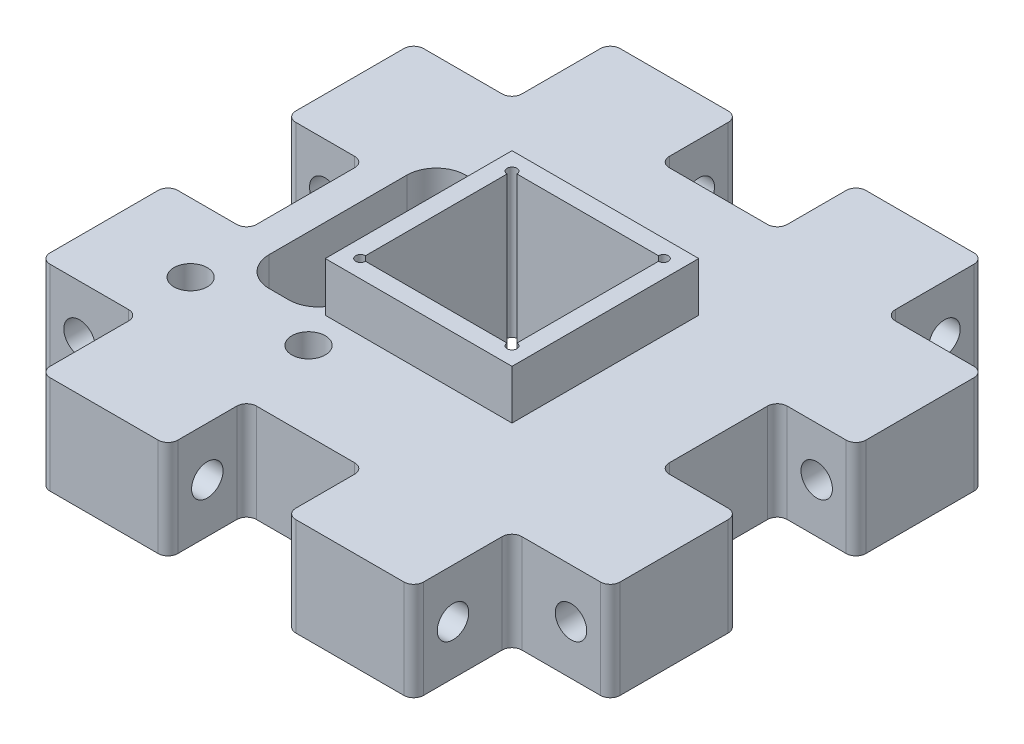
ISO-10303-21;
HEADER;
FILE_DESCRIPTION(('STEP AP214'),'2;1');
FILE_NAME('part.step','',(''),(''),'','','');
FILE_SCHEMA(('AUTOMOTIVE_DESIGN { 1 0 10303 214 1 1 1 1 }'));
ENDSEC;
DATA;
#1=APPLICATION_CONTEXT('core data for automotive mechanical design processes');
#2=APPLICATION_PROTOCOL_DEFINITION('international standard','automotive_design',2000,#1);
#3=PRODUCT_CONTEXT('',#1,'mechanical');
#4=PRODUCT('Part','Part','',(#3));
#5=PRODUCT_RELATED_PRODUCT_CATEGORY('part','',(#4));
#6=PRODUCT_DEFINITION_FORMATION('','',#4);
#7=PRODUCT_DEFINITION_CONTEXT('part definition',#1,'design');
#8=PRODUCT_DEFINITION('design','',#6,#7);
#9=PRODUCT_DEFINITION_SHAPE('','',#8);
#10=(LENGTH_UNIT() NAMED_UNIT(*) SI_UNIT(.MILLI.,.METRE.));
#11=(NAMED_UNIT(*) PLANE_ANGLE_UNIT() SI_UNIT($,.RADIAN.));
#12=(NAMED_UNIT(*) SI_UNIT($,.STERADIAN.) SOLID_ANGLE_UNIT());
#13=UNCERTAINTY_MEASURE_WITH_UNIT(LENGTH_MEASURE(1.E-05),#10,'distance_accuracy_value','');
#14=(GEOMETRIC_REPRESENTATION_CONTEXT(3) GLOBAL_UNCERTAINTY_ASSIGNED_CONTEXT((#13)) GLOBAL_UNIT_ASSIGNED_CONTEXT((#10,
#11,#12)) REPRESENTATION_CONTEXT('',''));
#15=CARTESIAN_POINT('',(0.,0.,0.));
#16=DIRECTION('',(0.,0.,1.));
#17=DIRECTION('',(1.,0.,0.));
#18=AXIS2_PLACEMENT_3D('',#15,#16,#17);
#19=CARTESIAN_POINT('',(-7.7,10.,13.));
#20=DIRECTION('',(0.,1.,0.));
#21=DIRECTION('',(0.,0.,1.));
#22=AXIS2_PLACEMENT_3D('',#19,#20,#21);
#23=CYLINDRICAL_SURFACE('',#22,1.69999999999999);
#24=CARTESIAN_POINT('',(-7.7,10.,13.));
#25=DIRECTION('',(0.,1.,0.));
#26=DIRECTION('',(0.,0.,1.));
#27=AXIS2_PLACEMENT_3D('',#24,#25,#26);
#28=CIRCLE('',#27,1.69999999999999);
#29=CARTESIAN_POINT('',(-7.7,10.,14.7));
#30=VERTEX_POINT('',#29);
#31=EDGE_CURVE('E685',#30,#30,#28,.T.);
#32=ORIENTED_EDGE('',*,*,#31,.T.);
#33=EDGE_LOOP('',(#32));
#34=FACE_BOUND('',#33,.T.);
#35=CARTESIAN_POINT('',(-7.7,2.4,13.));
#36=DIRECTION('',(0.,-1.,0.));
#37=DIRECTION('',(0.,0.,-1.));
#38=AXIS2_PLACEMENT_3D('',#35,#36,#37);
#39=CIRCLE('',#38,1.69999999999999);
#40=CARTESIAN_POINT('',(-7.7,2.4,11.3));
#41=VERTEX_POINT('',#40);
#42=EDGE_CURVE('E38',#41,#41,#39,.F.);
#43=ORIENTED_EDGE('',*,*,#42,.F.);
#44=EDGE_LOOP('',(#43));
#45=FACE_BOUND('',#44,.T.);
#46=ADVANCED_FACE('F34',(#34,#45),#23,.F.);
#47=CARTESIAN_POINT('',(-19.7,10.,13.));
#48=DIRECTION('',(0.,1.,0.));
#49=DIRECTION('',(0.,0.,1.));
#50=AXIS2_PLACEMENT_3D('',#47,#48,#49);
#51=CYLINDRICAL_SURFACE('',#50,1.69999999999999);
#52=CARTESIAN_POINT('',(-19.7,10.,13.));
#53=DIRECTION('',(0.,1.,0.));
#54=DIRECTION('',(0.,0.,1.));
#55=AXIS2_PLACEMENT_3D('',#52,#53,#54);
#56=CIRCLE('',#55,1.69999999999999);
#57=CARTESIAN_POINT('',(-19.7,10.,14.7));
#58=VERTEX_POINT('',#57);
#59=EDGE_CURVE('E682',#58,#58,#56,.T.);
#60=ORIENTED_EDGE('',*,*,#59,.T.);
#61=EDGE_LOOP('',(#60));
#62=FACE_BOUND('',#61,.T.);
#63=CARTESIAN_POINT('',(-19.7,2.4,13.));
#64=DIRECTION('',(0.,-1.,0.));
#65=DIRECTION('',(0.,0.,-1.));
#66=AXIS2_PLACEMENT_3D('',#63,#64,#65);
#67=CIRCLE('',#66,1.69999999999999);
#68=CARTESIAN_POINT('',(-19.7,2.4,11.3));
#69=VERTEX_POINT('',#68);
#70=EDGE_CURVE('E672',#69,#69,#67,.F.);
#71=ORIENTED_EDGE('',*,*,#70,.F.);
#72=EDGE_LOOP('',(#71));
#73=FACE_BOUND('',#72,.T.);
#74=ADVANCED_FACE('F1298',(#62,#73),#51,.F.);
#75=CARTESIAN_POINT('',(0.,10.,0.));
#76=DIRECTION('',(0.,-1.,0.));
#77=DIRECTION('',(0.,0.,-1.));
#78=AXIS2_PLACEMENT_3D('',#75,#76,#77);
#79=PLANE('',#78);
#80=ORIENTED_EDGE('',*,*,#59,.F.);
#81=EDGE_LOOP('',(#80));
#82=FACE_BOUND('',#81,.T.);
#83=ORIENTED_EDGE('',*,*,#31,.F.);
#84=EDGE_LOOP('',(#83));
#85=FACE_BOUND('',#84,.T.);
#86=DIRECTION('',(0.,0.,1.));
#87=VECTOR('',#86,1.);
#88=CARTESIAN_POINT('',(-29.,10.,29.));
#89=LINE('',#88,#87);
#90=CARTESIAN_POINT('',(-29.,10.,-18.));
#91=VERTEX_POINT('',#90);
#92=CARTESIAN_POINT('',(-29.,10.,-6.99999999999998));
#93=VERTEX_POINT('',#92);
#94=EDGE_CURVE('E972',#91,#93,#89,.T.);
#95=ORIENTED_EDGE('',*,*,#94,.T.);
#96=CARTESIAN_POINT('',(-28.,10.,-6.99999999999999));
#97=DIRECTION('',(0.,-1.,0.));
#98=DIRECTION('',(0.,0.,-1.));
#99=AXIS2_PLACEMENT_3D('',#96,#97,#98);
#100=CIRCLE('',#99,1.);
#101=CARTESIAN_POINT('',(-28.,10.,-5.99999999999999));
#102=VERTEX_POINT('',#101);
#103=EDGE_CURVE('E1036',#93,#102,#100,.F.);
#104=ORIENTED_EDGE('',*,*,#103,.T.);
#105=DIRECTION('',(-1.,0.,0.));
#106=VECTOR('',#105,1.);
#107=CARTESIAN_POINT('',(0.,10.,-5.99999999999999));
#108=LINE('',#107,#106);
#109=CARTESIAN_POINT('',(-22.,10.,-5.99999999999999));
#110=VERTEX_POINT('',#109);
#111=EDGE_CURVE('E929',#110,#102,#108,.T.);
#112=ORIENTED_EDGE('',*,*,#111,.F.);
#113=CARTESIAN_POINT('',(-22.,10.,-4.99999999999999));
#114=DIRECTION('',(0.,-1.,0.));
#115=DIRECTION('',(0.,0.,-1.));
#116=AXIS2_PLACEMENT_3D('',#113,#114,#115);
#117=CIRCLE('',#116,1.);
#118=CARTESIAN_POINT('',(-21.,10.,-4.99999999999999));
#119=VERTEX_POINT('',#118);
#120=EDGE_CURVE('E1289',#110,#119,#117,.T.);
#121=ORIENTED_EDGE('',*,*,#120,.T.);
#122=DIRECTION('',(0.,0.,-1.));
#123=VECTOR('',#122,1.);
#124=CARTESIAN_POINT('',(-21.,10.,0.));
#125=LINE('',#124,#123);
#126=CARTESIAN_POINT('',(-21.,10.,5.00000000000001));
#127=VERTEX_POINT('',#126);
#128=EDGE_CURVE('E926',#127,#119,#125,.T.);
#129=ORIENTED_EDGE('',*,*,#128,.F.);
#130=CARTESIAN_POINT('',(-22.,10.,5.00000000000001));
#131=DIRECTION('',(0.,-1.,0.));
#132=DIRECTION('',(0.,0.,-1.));
#133=AXIS2_PLACEMENT_3D('',#130,#131,#132);
#134=CIRCLE('',#133,1.);
#135=CARTESIAN_POINT('',(-22.,10.,6.00000000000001));
#136=VERTEX_POINT('',#135);
#137=EDGE_CURVE('E1285',#127,#136,#134,.T.);
#138=ORIENTED_EDGE('',*,*,#137,.T.);
#139=DIRECTION('',(1.,0.,0.));
#140=VECTOR('',#139,1.);
#141=CARTESIAN_POINT('',(0.,10.,6.));
#142=LINE('',#141,#140);
#143=CARTESIAN_POINT('',(-28.,10.,6.00000000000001));
#144=VERTEX_POINT('',#143);
#145=EDGE_CURVE('E923',#144,#136,#142,.T.);
#146=ORIENTED_EDGE('',*,*,#145,.F.);
#147=CARTESIAN_POINT('',(-28.,10.,7.00000000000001));
#148=DIRECTION('',(0.,-1.,0.));
#149=DIRECTION('',(0.,0.,-1.));
#150=AXIS2_PLACEMENT_3D('',#147,#148,#149);
#151=CIRCLE('',#150,1.);
#152=CARTESIAN_POINT('',(-29.,10.,7.00000000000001));
#153=VERTEX_POINT('',#152);
#154=EDGE_CURVE('E1004',#144,#153,#151,.F.);
#155=ORIENTED_EDGE('',*,*,#154,.T.);
#156=CARTESIAN_POINT('',(-29.,10.,18.));
#157=VERTEX_POINT('',#156);
#158=EDGE_CURVE('E969',#153,#157,#89,.T.);
#159=ORIENTED_EDGE('',*,*,#158,.T.);
#160=CARTESIAN_POINT('',(-28.,10.,18.));
#161=DIRECTION('',(0.,-1.,0.));
#162=DIRECTION('',(0.,0.,-1.));
#163=AXIS2_PLACEMENT_3D('',#160,#161,#162);
#164=CIRCLE('',#163,1.);
#165=CARTESIAN_POINT('',(-28.,10.,19.));
#166=VERTEX_POINT('',#165);
#167=EDGE_CURVE('E1001',#157,#166,#164,.F.);
#168=ORIENTED_EDGE('',*,*,#167,.T.);
#169=DIRECTION('',(-1.,0.,0.));
#170=VECTOR('',#169,1.);
#171=CARTESIAN_POINT('',(-29.,10.,19.));
#172=LINE('',#171,#170);
#173=CARTESIAN_POINT('',(-20.,10.,19.));
#174=VERTEX_POINT('',#173);
#175=EDGE_CURVE('E747',#174,#166,#172,.T.);
#176=ORIENTED_EDGE('',*,*,#175,.F.);
#177=CARTESIAN_POINT('',(-20.,10.,20.));
#178=DIRECTION('',(0.,-1.,0.));
#179=DIRECTION('',(0.,0.,-1.));
#180=AXIS2_PLACEMENT_3D('',#177,#178,#179);
#181=CIRCLE('',#180,1.);
#182=CARTESIAN_POINT('',(-19.,10.,20.));
#183=VERTEX_POINT('',#182);
#184=EDGE_CURVE('E1283',#174,#183,#181,.T.);
#185=ORIENTED_EDGE('',*,*,#184,.T.);
#186=DIRECTION('',(0.,0.,-1.));
#187=VECTOR('',#186,1.);
#188=CARTESIAN_POINT('',(-19.,10.,29.));
#189=LINE('',#188,#187);
#190=CARTESIAN_POINT('',(-19.,10.,28.));
#191=VERTEX_POINT('',#190);
#192=EDGE_CURVE('E706',#191,#183,#189,.T.);
#193=ORIENTED_EDGE('',*,*,#192,.F.);
#194=CARTESIAN_POINT('',(-18.,10.,28.));
#195=DIRECTION('',(0.,-1.,0.));
#196=DIRECTION('',(0.,0.,-1.));
#197=AXIS2_PLACEMENT_3D('',#194,#195,#196);
#198=CIRCLE('',#197,1.);
#199=CARTESIAN_POINT('',(-18.,10.,29.));
#200=VERTEX_POINT('',#199);
#201=EDGE_CURVE('E999',#191,#200,#198,.F.);
#202=ORIENTED_EDGE('',*,*,#201,.T.);
#203=DIRECTION('',(1.,0.,0.));
#204=VECTOR('',#203,1.);
#205=CARTESIAN_POINT('',(-29.,10.,29.));
#206=LINE('',#205,#204);
#207=CARTESIAN_POINT('',(-7.,10.,29.));
#208=VERTEX_POINT('',#207);
#209=EDGE_CURVE('E973',#200,#208,#206,.T.);
#210=ORIENTED_EDGE('',*,*,#209,.T.);
#211=CARTESIAN_POINT('',(-7.,10.,28.));
#212=DIRECTION('',(0.,-1.,0.));
#213=DIRECTION('',(0.,0.,-1.));
#214=AXIS2_PLACEMENT_3D('',#211,#212,#213);
#215=CIRCLE('',#214,1.);
#216=CARTESIAN_POINT('',(-6.,10.,28.));
#217=VERTEX_POINT('',#216);
#218=EDGE_CURVE('E1006',#208,#217,#215,.F.);
#219=ORIENTED_EDGE('',*,*,#218,.T.);
#220=DIRECTION('',(0.,0.,1.));
#221=VECTOR('',#220,1.);
#222=CARTESIAN_POINT('',(-6.,10.,0.));
#223=LINE('',#222,#221);
#224=CARTESIAN_POINT('',(-6.,10.,22.));
#225=VERTEX_POINT('',#224);
#226=EDGE_CURVE('E915',#225,#217,#223,.T.);
#227=ORIENTED_EDGE('',*,*,#226,.F.);
#228=CARTESIAN_POINT('',(-5.,10.,22.));
#229=DIRECTION('',(0.,-1.,0.));
#230=DIRECTION('',(0.,0.,-1.));
#231=AXIS2_PLACEMENT_3D('',#228,#229,#230);
#232=CIRCLE('',#231,1.);
#233=CARTESIAN_POINT('',(-5.,10.,21.));
#234=VERTEX_POINT('',#233);
#235=EDGE_CURVE('E1277',#225,#234,#232,.T.);
#236=ORIENTED_EDGE('',*,*,#235,.T.);
#237=DIRECTION('',(-1.,0.,0.));
#238=VECTOR('',#237,1.);
#239=CARTESIAN_POINT('',(0.,10.,21.));
#240=LINE('',#239,#238);
#241=CARTESIAN_POINT('',(5.,10.,21.));
#242=VERTEX_POINT('',#241);
#243=EDGE_CURVE('E912',#242,#234,#240,.T.);
#244=ORIENTED_EDGE('',*,*,#243,.F.);
#245=CARTESIAN_POINT('',(5.,10.,22.));
#246=DIRECTION('',(0.,-1.,0.));
#247=DIRECTION('',(0.,0.,-1.));
#248=AXIS2_PLACEMENT_3D('',#245,#246,#247);
#249=CIRCLE('',#248,1.);
#250=CARTESIAN_POINT('',(6.,10.,22.));
#251=VERTEX_POINT('',#250);
#252=EDGE_CURVE('E1273',#242,#251,#249,.T.);
#253=ORIENTED_EDGE('',*,*,#252,.T.);
#254=DIRECTION('',(0.,0.,-1.));
#255=VECTOR('',#254,1.);
#256=CARTESIAN_POINT('',(6.,10.,0.));
#257=LINE('',#256,#255);
#258=CARTESIAN_POINT('',(6.00000000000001,10.,28.));
#259=VERTEX_POINT('',#258);
#260=EDGE_CURVE('E909',#259,#251,#257,.T.);
#261=ORIENTED_EDGE('',*,*,#260,.F.);
#262=CARTESIAN_POINT('',(7.00000000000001,10.,28.));
#263=DIRECTION('',(0.,-1.,0.));
#264=DIRECTION('',(0.,0.,-1.));
#265=AXIS2_PLACEMENT_3D('',#262,#263,#264);
#266=CIRCLE('',#265,1.);
#267=CARTESIAN_POINT('',(6.99999999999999,10.,29.));
#268=VERTEX_POINT('',#267);
#269=EDGE_CURVE('E1009',#259,#268,#266,.F.);
#270=ORIENTED_EDGE('',*,*,#269,.T.);
#271=CARTESIAN_POINT('',(18.,10.,29.));
#272=VERTEX_POINT('',#271);
#273=EDGE_CURVE('E977',#268,#272,#206,.T.);
#274=ORIENTED_EDGE('',*,*,#273,.T.);
#275=CARTESIAN_POINT('',(18.,10.,28.));
#276=DIRECTION('',(0.,-1.,0.));
#277=DIRECTION('',(0.,0.,-1.));
#278=AXIS2_PLACEMENT_3D('',#275,#276,#277);
#279=CIRCLE('',#278,1.);
#280=CARTESIAN_POINT('',(19.,10.,28.));
#281=VERTEX_POINT('',#280);
#282=EDGE_CURVE('E1011',#272,#281,#279,.F.);
#283=ORIENTED_EDGE('',*,*,#282,.T.);
#284=DIRECTION('',(0.,0.,1.));
#285=VECTOR('',#284,1.);
#286=CARTESIAN_POINT('',(19.,10.,29.));
#287=LINE('',#286,#285);
#288=CARTESIAN_POINT('',(19.,10.,20.));
#289=VERTEX_POINT('',#288);
#290=EDGE_CURVE('E689',#289,#281,#287,.T.);
#291=ORIENTED_EDGE('',*,*,#290,.F.);
#292=CARTESIAN_POINT('',(20.,10.,20.));
#293=DIRECTION('',(0.,-1.,0.));
#294=DIRECTION('',(0.,0.,-1.));
#295=AXIS2_PLACEMENT_3D('',#292,#293,#294);
#296=CIRCLE('',#295,1.);
#297=CARTESIAN_POINT('',(20.,10.,19.));
#298=VERTEX_POINT('',#297);
#299=EDGE_CURVE('E1271',#289,#298,#296,.T.);
#300=ORIENTED_EDGE('',*,*,#299,.T.);
#301=DIRECTION('',(-1.,0.,0.));
#302=VECTOR('',#301,1.);
#303=CARTESIAN_POINT('',(29.,10.,19.));
#304=LINE('',#303,#302);
#305=CARTESIAN_POINT('',(28.,10.,19.));
#306=VERTEX_POINT('',#305);
#307=EDGE_CURVE('E691',#306,#298,#304,.T.);
#308=ORIENTED_EDGE('',*,*,#307,.F.);
#309=CARTESIAN_POINT('',(28.,10.,18.));
#310=DIRECTION('',(0.,-1.,0.));
#311=DIRECTION('',(0.,0.,-1.));
#312=AXIS2_PLACEMENT_3D('',#309,#310,#311);
#313=CIRCLE('',#312,1.);
#314=CARTESIAN_POINT('',(29.,10.,18.));
#315=VERTEX_POINT('',#314);
#316=EDGE_CURVE('E1014',#306,#315,#313,.F.);
#317=ORIENTED_EDGE('',*,*,#316,.T.);
#318=DIRECTION('',(0.,0.,-1.));
#319=VECTOR('',#318,1.);
#320=CARTESIAN_POINT('',(29.,10.,29.));
#321=LINE('',#320,#319);
#322=CARTESIAN_POINT('',(29.,10.,7.));
#323=VERTEX_POINT('',#322);
#324=EDGE_CURVE('E963',#315,#323,#321,.T.);
#325=ORIENTED_EDGE('',*,*,#324,.T.);
#326=CARTESIAN_POINT('',(28.,10.,6.99999999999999));
#327=DIRECTION('',(0.,-1.,0.));
#328=DIRECTION('',(0.,0.,-1.));
#329=AXIS2_PLACEMENT_3D('',#326,#327,#328);
#330=CIRCLE('',#329,1.);
#331=CARTESIAN_POINT('',(28.,10.,5.99999999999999));
#332=VERTEX_POINT('',#331);
#333=EDGE_CURVE('E1016',#323,#332,#330,.F.);
#334=ORIENTED_EDGE('',*,*,#333,.T.);
#335=DIRECTION('',(1.,0.,0.));
#336=VECTOR('',#335,1.);
#337=CARTESIAN_POINT('',(0.,10.,5.99999999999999));
#338=LINE('',#337,#336);
#339=CARTESIAN_POINT('',(22.,10.,5.99999999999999));
#340=VERTEX_POINT('',#339);
#341=EDGE_CURVE('E895',#340,#332,#338,.T.);
#342=ORIENTED_EDGE('',*,*,#341,.F.);
#343=CARTESIAN_POINT('',(22.,10.,4.99999999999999));
#344=DIRECTION('',(0.,-1.,0.));
#345=DIRECTION('',(0.,0.,-1.));
#346=AXIS2_PLACEMENT_3D('',#343,#344,#345);
#347=CIRCLE('',#346,1.);
#348=CARTESIAN_POINT('',(21.,10.,4.99999999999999));
#349=VERTEX_POINT('',#348);
#350=EDGE_CURVE('E1265',#340,#349,#347,.T.);
#351=ORIENTED_EDGE('',*,*,#350,.T.);
#352=DIRECTION('',(0.,0.,1.));
#353=VECTOR('',#352,1.);
#354=CARTESIAN_POINT('',(21.,10.,0.));
#355=LINE('',#354,#353);
#356=CARTESIAN_POINT('',(21.,10.,-5.00000000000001));
#357=VERTEX_POINT('',#356);
#358=EDGE_CURVE('E892',#357,#349,#355,.T.);
#359=ORIENTED_EDGE('',*,*,#358,.F.);
#360=CARTESIAN_POINT('',(22.,10.,-5.00000000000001));
#361=DIRECTION('',(0.,-1.,0.));
#362=DIRECTION('',(0.,0.,-1.));
#363=AXIS2_PLACEMENT_3D('',#360,#361,#362);
#364=CIRCLE('',#363,1.);
#365=CARTESIAN_POINT('',(22.,10.,-6.00000000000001));
#366=VERTEX_POINT('',#365);
#367=EDGE_CURVE('E1261',#357,#366,#364,.T.);
#368=ORIENTED_EDGE('',*,*,#367,.T.);
#369=DIRECTION('',(-1.,0.,0.));
#370=VECTOR('',#369,1.);
#371=CARTESIAN_POINT('',(0.,10.,-6.));
#372=LINE('',#371,#370);
#373=CARTESIAN_POINT('',(28.,10.,-6.00000000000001));
#374=VERTEX_POINT('',#373);
#375=EDGE_CURVE('E897',#374,#366,#372,.T.);
#376=ORIENTED_EDGE('',*,*,#375,.F.);
#377=CARTESIAN_POINT('',(28.,10.,-7.00000000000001));
#378=DIRECTION('',(0.,-1.,0.));
#379=DIRECTION('',(0.,0.,-1.));
#380=AXIS2_PLACEMENT_3D('',#377,#378,#379);
#381=CIRCLE('',#380,1.);
#382=CARTESIAN_POINT('',(29.,10.,-7.));
#383=VERTEX_POINT('',#382);
#384=EDGE_CURVE('E1019',#374,#383,#381,.F.);
#385=ORIENTED_EDGE('',*,*,#384,.T.);
#386=CARTESIAN_POINT('',(29.,10.,-18.));
#387=VERTEX_POINT('',#386);
#388=EDGE_CURVE('E960',#383,#387,#321,.T.);
#389=ORIENTED_EDGE('',*,*,#388,.T.);
#390=CARTESIAN_POINT('',(28.,10.,-18.));
#391=DIRECTION('',(0.,-1.,0.));
#392=DIRECTION('',(0.,0.,-1.));
#393=AXIS2_PLACEMENT_3D('',#390,#391,#392);
#394=CIRCLE('',#393,1.);
#395=CARTESIAN_POINT('',(28.,10.,-19.));
#396=VERTEX_POINT('',#395);
#397=EDGE_CURVE('E1021',#387,#396,#394,.F.);
#398=ORIENTED_EDGE('',*,*,#397,.T.);
#399=DIRECTION('',(1.,0.,0.));
#400=VECTOR('',#399,1.);
#401=CARTESIAN_POINT('',(29.,10.,-19.));
#402=LINE('',#401,#400);
#403=CARTESIAN_POINT('',(20.,10.,-19.));
#404=VERTEX_POINT('',#403);
#405=EDGE_CURVE('E719',#404,#396,#402,.T.);
#406=ORIENTED_EDGE('',*,*,#405,.F.);
#407=CARTESIAN_POINT('',(20.,10.,-20.));
#408=DIRECTION('',(0.,-1.,0.));
#409=DIRECTION('',(0.,0.,-1.));
#410=AXIS2_PLACEMENT_3D('',#407,#408,#409);
#411=CIRCLE('',#410,1.);
#412=CARTESIAN_POINT('',(19.,10.,-20.));
#413=VERTEX_POINT('',#412);
#414=EDGE_CURVE('E1259',#404,#413,#411,.T.);
#415=ORIENTED_EDGE('',*,*,#414,.T.);
#416=DIRECTION('',(0.,0.,1.));
#417=VECTOR('',#416,1.);
#418=CARTESIAN_POINT('',(19.,10.,-29.));
#419=LINE('',#418,#417);
#420=CARTESIAN_POINT('',(19.,10.,-28.));
#421=VERTEX_POINT('',#420);
#422=EDGE_CURVE('E707',#421,#413,#419,.T.);
#423=ORIENTED_EDGE('',*,*,#422,.F.);
#424=CARTESIAN_POINT('',(18.,10.,-28.));
#425=DIRECTION('',(0.,-1.,0.));
#426=DIRECTION('',(0.,0.,-1.));
#427=AXIS2_PLACEMENT_3D('',#424,#425,#426);
#428=CIRCLE('',#427,1.);
#429=CARTESIAN_POINT('',(18.,10.,-29.));
#430=VERTEX_POINT('',#429);
#431=EDGE_CURVE('E1024',#421,#430,#428,.F.);
#432=ORIENTED_EDGE('',*,*,#431,.T.);
#433=DIRECTION('',(-1.,0.,0.));
#434=VECTOR('',#433,1.);
#435=CARTESIAN_POINT('',(-29.,10.,-29.));
#436=LINE('',#435,#434);
#437=CARTESIAN_POINT('',(6.99999999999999,10.,-29.));
#438=VERTEX_POINT('',#437);
#439=EDGE_CURVE('E968',#430,#438,#436,.T.);
#440=ORIENTED_EDGE('',*,*,#439,.T.);
#441=CARTESIAN_POINT('',(7.,10.,-28.));
#442=DIRECTION('',(0.,-1.,0.));
#443=DIRECTION('',(0.,0.,-1.));
#444=AXIS2_PLACEMENT_3D('',#441,#442,#443);
#445=CIRCLE('',#444,1.);
#446=CARTESIAN_POINT('',(5.99999999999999,10.,-28.));
#447=VERTEX_POINT('',#446);
#448=EDGE_CURVE('E1026',#438,#447,#445,.F.);
#449=ORIENTED_EDGE('',*,*,#448,.T.);
#450=DIRECTION('',(0.,0.,-1.));
#451=VECTOR('',#450,1.);
#452=CARTESIAN_POINT('',(6.,10.,0.));
#453=LINE('',#452,#451);
#454=CARTESIAN_POINT('',(5.99999999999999,10.,-22.));
#455=VERTEX_POINT('',#454);
#456=EDGE_CURVE('E943',#455,#447,#453,.T.);
#457=ORIENTED_EDGE('',*,*,#456,.F.);
#458=CARTESIAN_POINT('',(4.99999999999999,10.,-22.));
#459=DIRECTION('',(0.,-1.,0.));
#460=DIRECTION('',(0.,0.,-1.));
#461=AXIS2_PLACEMENT_3D('',#458,#459,#460);
#462=CIRCLE('',#461,1.);
#463=CARTESIAN_POINT('',(4.99999999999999,10.,-21.));
#464=VERTEX_POINT('',#463);
#465=EDGE_CURVE('E1253',#455,#464,#462,.T.);
#466=ORIENTED_EDGE('',*,*,#465,.T.);
#467=DIRECTION('',(1.,0.,0.));
#468=VECTOR('',#467,1.);
#469=CARTESIAN_POINT('',(0.,10.,-21.));
#470=LINE('',#469,#468);
#471=CARTESIAN_POINT('',(-5.00000000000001,10.,-21.));
#472=VERTEX_POINT('',#471);
#473=EDGE_CURVE('E940',#472,#464,#470,.T.);
#474=ORIENTED_EDGE('',*,*,#473,.F.);
#475=CARTESIAN_POINT('',(-5.00000000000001,10.,-22.));
#476=DIRECTION('',(0.,-1.,0.));
#477=DIRECTION('',(0.,0.,-1.));
#478=AXIS2_PLACEMENT_3D('',#475,#476,#477);
#479=CIRCLE('',#478,1.);
#480=CARTESIAN_POINT('',(-6.00000000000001,10.,-22.));
#481=VERTEX_POINT('',#480);
#482=EDGE_CURVE('E1249',#472,#481,#479,.T.);
#483=ORIENTED_EDGE('',*,*,#482,.T.);
#484=DIRECTION('',(0.,0.,1.));
#485=VECTOR('',#484,1.);
#486=CARTESIAN_POINT('',(-6.,10.,0.));
#487=LINE('',#486,#485);
#488=CARTESIAN_POINT('',(-6.00000000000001,10.,-28.));
#489=VERTEX_POINT('',#488);
#490=EDGE_CURVE('E937',#489,#481,#487,.T.);
#491=ORIENTED_EDGE('',*,*,#490,.F.);
#492=CARTESIAN_POINT('',(-7.00000000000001,10.,-28.));
#493=DIRECTION('',(0.,-1.,0.));
#494=DIRECTION('',(0.,0.,-1.));
#495=AXIS2_PLACEMENT_3D('',#492,#493,#494);
#496=CIRCLE('',#495,1.);
#497=CARTESIAN_POINT('',(-7.00000000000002,10.,-29.));
#498=VERTEX_POINT('',#497);
#499=EDGE_CURVE('E1029',#489,#498,#496,.F.);
#500=ORIENTED_EDGE('',*,*,#499,.T.);
#501=CARTESIAN_POINT('',(-18.,10.,-29.));
#502=VERTEX_POINT('',#501);
#503=EDGE_CURVE('E965',#498,#502,#436,.T.);
#504=ORIENTED_EDGE('',*,*,#503,.T.);
#505=CARTESIAN_POINT('',(-18.,10.,-28.));
#506=DIRECTION('',(0.,-1.,0.));
#507=DIRECTION('',(0.,0.,-1.));
#508=AXIS2_PLACEMENT_3D('',#505,#506,#507);
#509=CIRCLE('',#508,1.);
#510=CARTESIAN_POINT('',(-19.,10.,-28.));
#511=VERTEX_POINT('',#510);
#512=EDGE_CURVE('E1031',#502,#511,#509,.F.);
#513=ORIENTED_EDGE('',*,*,#512,.T.);
#514=DIRECTION('',(0.,0.,-1.));
#515=VECTOR('',#514,1.);
#516=CARTESIAN_POINT('',(-19.,10.,-29.));
#517=LINE('',#516,#515);
#518=CARTESIAN_POINT('',(-19.,10.,-20.));
#519=VERTEX_POINT('',#518);
#520=EDGE_CURVE('E688',#519,#511,#517,.T.);
#521=ORIENTED_EDGE('',*,*,#520,.F.);
#522=CARTESIAN_POINT('',(-20.,10.,-20.));
#523=DIRECTION('',(0.,-1.,0.));
#524=DIRECTION('',(0.,0.,-1.));
#525=AXIS2_PLACEMENT_3D('',#522,#523,#524);
#526=CIRCLE('',#525,1.);
#527=CARTESIAN_POINT('',(-20.,10.,-19.));
#528=VERTEX_POINT('',#527);
#529=EDGE_CURVE('E11',#519,#528,#526,.T.);
#530=ORIENTED_EDGE('',*,*,#529,.T.);
#531=DIRECTION('',(1.,0.,0.));
#532=VECTOR('',#531,1.);
#533=CARTESIAN_POINT('',(-29.,10.,-19.));
#534=LINE('',#533,#532);
#535=CARTESIAN_POINT('',(-28.,10.,-19.));
#536=VERTEX_POINT('',#535);
#537=EDGE_CURVE('E724',#536,#528,#534,.T.);
#538=ORIENTED_EDGE('',*,*,#537,.F.);
#539=CARTESIAN_POINT('',(-28.,10.,-18.));
#540=DIRECTION('',(0.,-1.,0.));
#541=DIRECTION('',(0.,0.,-1.));
#542=AXIS2_PLACEMENT_3D('',#539,#540,#541);
#543=CIRCLE('',#542,1.);
#544=EDGE_CURVE('E1034',#536,#91,#543,.F.);
#545=ORIENTED_EDGE('',*,*,#544,.T.);
#546=EDGE_LOOP('',(#95,#104,#112,#121,#129,#138,#146,#155,#159,#168,#176,#185,#193,#202,#210,
#219,#227,#236,#244,#253,#261,#270,#274,#283,#291,#300,#308,#317,#325,#334,#342,#351,#359,#368,
#376,#385,#389,#398,#406,#415,#423,#432,#440,#449,#457,#466,#474,#483,#491,#500,#504,#513,#521,
#530,#538,#545));
#547=FACE_BOUND('',#546,.T.);
#548=DIRECTION('',(-1.,0.,0.));
#549=VECTOR('',#548,1.);
#550=CARTESIAN_POINT('',(-9.7,10.,-10.));
#551=LINE('',#550,#549);
#552=CARTESIAN_POINT('',(-12.7,10.,-10.));
#553=VERTEX_POINT('',#552);
#554=CARTESIAN_POINT('',(-14.7,10.,-10.));
#555=VERTEX_POINT('',#554);
#556=EDGE_CURVE('E841',#553,#555,#551,.T.);
#557=ORIENTED_EDGE('',*,*,#556,.F.);
#558=CARTESIAN_POINT('',(-12.7,10.,-7.));
#559=DIRECTION('',(0.,-1.,0.));
#560=DIRECTION('',(0.,0.,-1.));
#561=AXIS2_PLACEMENT_3D('',#558,#559,#560);
#562=CIRCLE('',#561,3.);
#563=CARTESIAN_POINT('',(-9.7,10.,-7.));
#564=VERTEX_POINT('',#563);
#565=EDGE_CURVE('E1183',#553,#564,#562,.T.);
#566=ORIENTED_EDGE('',*,*,#565,.T.);
#567=DIRECTION('',(0.,0.,-1.));
#568=VECTOR('',#567,1.);
#569=CARTESIAN_POINT('',(-9.7,10.,10.));
#570=LINE('',#569,#568);
#571=CARTESIAN_POINT('',(-9.7,10.,7.));
#572=VERTEX_POINT('',#571);
#573=EDGE_CURVE('E844',#572,#564,#570,.T.);
#574=ORIENTED_EDGE('',*,*,#573,.F.);
#575=CARTESIAN_POINT('',(-12.7,10.,7.));
#576=DIRECTION('',(0.,-1.,0.));
#577=DIRECTION('',(0.,0.,-1.));
#578=AXIS2_PLACEMENT_3D('',#575,#576,#577);
#579=CIRCLE('',#578,3.);
#580=CARTESIAN_POINT('',(-12.7,10.,10.));
#581=VERTEX_POINT('',#580);
#582=EDGE_CURVE('E1187',#572,#581,#579,.T.);
#583=ORIENTED_EDGE('',*,*,#582,.T.);
#584=DIRECTION('',(1.,0.,0.));
#585=VECTOR('',#584,1.);
#586=CARTESIAN_POINT('',(-17.7,10.,10.));
#587=LINE('',#586,#585);
#588=CARTESIAN_POINT('',(-14.7,10.,10.));
#589=VERTEX_POINT('',#588);
#590=EDGE_CURVE('E859',#589,#581,#587,.T.);
#591=ORIENTED_EDGE('',*,*,#590,.F.);
#592=CARTESIAN_POINT('',(-14.7,10.,7.));
#593=DIRECTION('',(0.,-1.,0.));
#594=DIRECTION('',(0.,0.,-1.));
#595=AXIS2_PLACEMENT_3D('',#592,#593,#594);
#596=CIRCLE('',#595,3.);
#597=CARTESIAN_POINT('',(-17.7,10.,7.));
#598=VERTEX_POINT('',#597);
#599=EDGE_CURVE('E1175',#589,#598,#596,.T.);
#600=ORIENTED_EDGE('',*,*,#599,.T.);
#601=DIRECTION('',(0.,0.,1.));
#602=VECTOR('',#601,1.);
#603=CARTESIAN_POINT('',(-17.7,10.,10.));
#604=LINE('',#603,#602);
#605=CARTESIAN_POINT('',(-17.7,10.,-7.));
#606=VERTEX_POINT('',#605);
#607=EDGE_CURVE('E838',#606,#598,#604,.T.);
#608=ORIENTED_EDGE('',*,*,#607,.F.);
#609=CARTESIAN_POINT('',(-14.7,10.,-7.));
#610=DIRECTION('',(0.,-1.,0.));
#611=DIRECTION('',(0.,0.,-1.));
#612=AXIS2_PLACEMENT_3D('',#609,#610,#611);
#613=CIRCLE('',#612,3.);
#614=EDGE_CURVE('E1179',#606,#555,#613,.T.);
#615=ORIENTED_EDGE('',*,*,#614,.T.);
#616=EDGE_LOOP('',(#557,#566,#574,#583,#591,#600,#608,#615));
#617=FACE_BOUND('',#616,.T.);
#618=DIRECTION('',(0.,0.,1.));
#619=VECTOR('',#618,1.);
#620=CARTESIAN_POINT('',(-9.5,10.,-9.5));
#621=LINE('',#620,#619);
#622=CARTESIAN_POINT('',(-9.5,10.,-9.5));
#623=VERTEX_POINT('',#622);
#624=CARTESIAN_POINT('',(-9.5,10.,9.5));
#625=VERTEX_POINT('',#624);
#626=EDGE_CURVE('E776',#623,#625,#621,.T.);
#627=ORIENTED_EDGE('',*,*,#626,.F.);
#628=DIRECTION('',(-1.,0.,0.));
#629=VECTOR('',#628,1.);
#630=CARTESIAN_POINT('',(9.5,10.,-9.5));
#631=LINE('',#630,#629);
#632=CARTESIAN_POINT('',(9.5,10.,-9.5));
#633=VERTEX_POINT('',#632);
#634=EDGE_CURVE('E781',#633,#623,#631,.T.);
#635=ORIENTED_EDGE('',*,*,#634,.F.);
#636=DIRECTION('',(0.,0.,-1.));
#637=VECTOR('',#636,1.);
#638=CARTESIAN_POINT('',(9.5,10.,-9.5));
#639=LINE('',#638,#637);
#640=CARTESIAN_POINT('',(9.5,10.,9.5));
#641=VERTEX_POINT('',#640);
#642=EDGE_CURVE('E793',#641,#633,#639,.T.);
#643=ORIENTED_EDGE('',*,*,#642,.F.);
#644=DIRECTION('',(1.,0.,0.));
#645=VECTOR('',#644,1.);
#646=CARTESIAN_POINT('',(9.5,10.,9.5));
#647=LINE('',#646,#645);
#648=EDGE_CURVE('E790',#625,#641,#647,.T.);
#649=ORIENTED_EDGE('',*,*,#648,.F.);
#650=EDGE_LOOP('',(#627,#635,#643,#649));
#651=FACE_BOUND('',#650,.T.);
#652=ADVANCED_FACE('F1300',(#82,#85,#547,#617,#651),#79,.F.);
#653=CARTESIAN_POINT('',(33.5254833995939,5.,-25.));
#654=DIRECTION('',(-1.,0.,0.));
#655=DIRECTION('',(0.,0.,1.));
#656=AXIS2_PLACEMENT_3D('',#653,#654,#655);
#657=CYLINDRICAL_SURFACE('',#656,1.6);
#658=CARTESIAN_POINT('',(19.,5.,-25.));
#659=DIRECTION('',(-1.,0.,0.));
#660=DIRECTION('',(0.,0.,1.));
#661=AXIS2_PLACEMENT_3D('',#658,#659,#660);
#662=CIRCLE('',#661,1.6);
#663=CARTESIAN_POINT('',(19.,5.,-23.4));
#664=VERTEX_POINT('',#663);
#665=EDGE_CURVE('E692',#664,#664,#662,.T.);
#666=ORIENTED_EDGE('',*,*,#665,.F.);
#667=EDGE_LOOP('',(#666));
#668=FACE_BOUND('',#667,.T.);
#669=CARTESIAN_POINT('',(5.99999999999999,5.,-25.));
#670=DIRECTION('',(1.,0.,0.));
#671=DIRECTION('',(0.,0.,-1.));
#672=AXIS2_PLACEMENT_3D('',#669,#670,#671);
#673=CIRCLE('',#672,1.6);
#674=CARTESIAN_POINT('',(5.99999999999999,5.,-26.6));
#675=VERTEX_POINT('',#674);
#676=EDGE_CURVE('E880',#675,#675,#673,.T.);
#677=ORIENTED_EDGE('',*,*,#676,.F.);
#678=EDGE_LOOP('',(#677));
#679=FACE_BOUND('',#678,.T.);
#680=ADVANCED_FACE('F1307',(#668,#679),#657,.F.);
#681=CARTESIAN_POINT('',(33.5254833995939,5.,25.));
#682=DIRECTION('',(-1.,0.,0.));
#683=DIRECTION('',(0.,0.,1.));
#684=AXIS2_PLACEMENT_3D('',#681,#682,#683);
#685=CYLINDRICAL_SURFACE('',#684,1.6);
#686=CARTESIAN_POINT('',(19.,5.,25.));
#687=DIRECTION('',(-1.,0.,0.));
#688=DIRECTION('',(0.,0.,1.));
#689=AXIS2_PLACEMENT_3D('',#686,#687,#688);
#690=CIRCLE('',#689,1.6);
#691=CARTESIAN_POINT('',(19.,5.,26.6));
#692=VERTEX_POINT('',#691);
#693=EDGE_CURVE('E700',#692,#692,#690,.T.);
#694=ORIENTED_EDGE('',*,*,#693,.F.);
#695=EDGE_LOOP('',(#694));
#696=FACE_BOUND('',#695,.T.);
#697=CARTESIAN_POINT('',(6.00000000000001,5.,25.));
#698=DIRECTION('',(1.,0.,0.));
#699=DIRECTION('',(0.,0.,-1.));
#700=AXIS2_PLACEMENT_3D('',#697,#698,#699);
#701=CIRCLE('',#700,1.6);
#702=CARTESIAN_POINT('',(6.,5.,23.4));
#703=VERTEX_POINT('',#702);
#704=EDGE_CURVE('E871',#703,#703,#701,.T.);
#705=ORIENTED_EDGE('',*,*,#704,.F.);
#706=EDGE_LOOP('',(#705));
#707=FACE_BOUND('',#706,.T.);
#708=ADVANCED_FACE('F1406',(#696,#707),#685,.F.);
#709=CARTESIAN_POINT('',(-25.,5.,33.5254833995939));
#710=DIRECTION('',(0.,0.,-1.));
#711=DIRECTION('',(-1.,0.,0.));
#712=AXIS2_PLACEMENT_3D('',#709,#710,#711);
#713=CYLINDRICAL_SURFACE('',#712,1.6);
#714=CARTESIAN_POINT('',(-25.,5.,19.));
#715=DIRECTION('',(0.,0.,-1.));
#716=DIRECTION('',(-1.,0.,0.));
#717=AXIS2_PLACEMENT_3D('',#714,#715,#716);
#718=CIRCLE('',#717,1.6);
#719=CARTESIAN_POINT('',(-26.6,5.,19.));
#720=VERTEX_POINT('',#719);
#721=EDGE_CURVE('E744',#720,#720,#718,.T.);
#722=ORIENTED_EDGE('',*,*,#721,.F.);
#723=EDGE_LOOP('',(#722));
#724=FACE_BOUND('',#723,.T.);
#725=CARTESIAN_POINT('',(-25.,5.,6.00000000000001));
#726=DIRECTION('',(0.,0.,1.));
#727=DIRECTION('',(1.,0.,0.));
#728=AXIS2_PLACEMENT_3D('',#725,#726,#727);
#729=CIRCLE('',#728,1.6);
#730=CARTESIAN_POINT('',(-23.4,5.,6.));
#731=VERTEX_POINT('',#730);
#732=EDGE_CURVE('E877',#731,#731,#729,.T.);
#733=ORIENTED_EDGE('',*,*,#732,.F.);
#734=EDGE_LOOP('',(#733));
#735=FACE_BOUND('',#734,.T.);
#736=ADVANCED_FACE('F1409',(#724,#735),#713,.F.);
#737=CARTESIAN_POINT('',(29.,10.,29.));
#738=DIRECTION('',(-1.,0.,0.));
#739=DIRECTION('',(0.,0.,1.));
#740=AXIS2_PLACEMENT_3D('',#737,#738,#739);
#741=PLANE('',#740);
#742=DIRECTION('',(0.,0.,-1.));
#743=VECTOR('',#742,1.);
#744=CARTESIAN_POINT('',(29.,0.,29.));
#745=LINE('',#744,#743);
#746=CARTESIAN_POINT('',(29.,0.,-7.));
#747=VERTEX_POINT('',#746);
#748=CARTESIAN_POINT('',(29.,0.,-18.));
#749=VERTEX_POINT('',#748);
#750=EDGE_CURVE('E959',#747,#749,#745,.T.);
#751=ORIENTED_EDGE('',*,*,#750,.T.);
#752=DIRECTION('',(0.,-1.,0.));
#753=VECTOR('',#752,1.);
#754=CARTESIAN_POINT('',(29.,10.,-18.));
#755=LINE('',#754,#753);
#756=EDGE_CURVE('E1106',#749,#387,#755,.F.);
#757=ORIENTED_EDGE('',*,*,#756,.T.);
#758=ORIENTED_EDGE('',*,*,#388,.F.);
#759=DIRECTION('',(0.,1.,0.));
#760=VECTOR('',#759,1.);
#761=CARTESIAN_POINT('',(29.,10.,-7.00000000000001));
#762=LINE('',#761,#760);
#763=EDGE_CURVE('E1104',#383,#747,#762,.F.);
#764=ORIENTED_EDGE('',*,*,#763,.T.);
#765=EDGE_LOOP('',(#751,#757,#758,#764));
#766=FACE_BOUND('',#765,.T.);
#767=ADVANCED_FACE('F1414',(#766),#741,.F.);
#768=CARTESIAN_POINT('',(-29.,10.,29.));
#769=DIRECTION('',(1.,0.,0.));
#770=DIRECTION('',(0.,0.,-1.));
#771=AXIS2_PLACEMENT_3D('',#768,#769,#770);
#772=PLANE('',#771);
#773=ORIENTED_EDGE('',*,*,#158,.F.);
#774=DIRECTION('',(0.,1.,0.));
#775=VECTOR('',#774,1.);
#776=CARTESIAN_POINT('',(-29.,10.,7.00000000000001));
#777=LINE('',#776,#775);
#778=CARTESIAN_POINT('',(-29.,0.,7.00000000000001));
#779=VERTEX_POINT('',#778);
#780=EDGE_CURVE('E1146',#153,#779,#777,.F.);
#781=ORIENTED_EDGE('',*,*,#780,.T.);
#782=DIRECTION('',(0.,0.,1.));
#783=VECTOR('',#782,1.);
#784=CARTESIAN_POINT('',(-29.,0.,29.));
#785=LINE('',#784,#783);
#786=CARTESIAN_POINT('',(-29.,0.,18.));
#787=VERTEX_POINT('',#786);
#788=EDGE_CURVE('E985',#779,#787,#785,.T.);
#789=ORIENTED_EDGE('',*,*,#788,.T.);
#790=DIRECTION('',(0.,-1.,0.));
#791=VECTOR('',#790,1.);
#792=CARTESIAN_POINT('',(-29.,10.,18.));
#793=LINE('',#792,#791);
#794=EDGE_CURVE('E1144',#787,#157,#793,.F.);
#795=ORIENTED_EDGE('',*,*,#794,.T.);
#796=EDGE_LOOP('',(#773,#781,#789,#795));
#797=FACE_BOUND('',#796,.T.);
#798=ADVANCED_FACE('F1501',(#797),#772,.F.);
#799=CARTESIAN_POINT('',(-29.,10.,29.));
#800=DIRECTION('',(0.,0.,-1.));
#801=DIRECTION('',(-1.,0.,0.));
#802=AXIS2_PLACEMENT_3D('',#799,#800,#801);
#803=PLANE('',#802);
#804=DIRECTION('',(1.,0.,0.));
#805=VECTOR('',#804,1.);
#806=CARTESIAN_POINT('',(-29.,0.,29.));
#807=LINE('',#806,#805);
#808=CARTESIAN_POINT('',(6.99999999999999,0.,29.));
#809=VERTEX_POINT('',#808);
#810=CARTESIAN_POINT('',(18.,0.,29.));
#811=VERTEX_POINT('',#810);
#812=EDGE_CURVE('E991',#809,#811,#807,.T.);
#813=ORIENTED_EDGE('',*,*,#812,.T.);
#814=DIRECTION('',(0.,-1.,0.));
#815=VECTOR('',#814,1.);
#816=CARTESIAN_POINT('',(18.,10.,29.));
#817=LINE('',#816,#815);
#818=EDGE_CURVE('E1127',#811,#272,#817,.F.);
#819=ORIENTED_EDGE('',*,*,#818,.T.);
#820=ORIENTED_EDGE('',*,*,#273,.F.);
#821=DIRECTION('',(0.,1.,0.));
#822=VECTOR('',#821,1.);
#823=CARTESIAN_POINT('',(7.00000000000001,10.,29.));
#824=LINE('',#823,#822);
#825=EDGE_CURVE('E1125',#268,#809,#824,.F.);
#826=ORIENTED_EDGE('',*,*,#825,.T.);
#827=EDGE_LOOP('',(#813,#819,#820,#826));
#828=FACE_BOUND('',#827,.T.);
#829=ADVANCED_FACE('F1496',(#828),#803,.F.);
#830=CARTESIAN_POINT('',(-29.,10.,-29.));
#831=DIRECTION('',(0.,0.,1.));
#832=DIRECTION('',(1.,0.,0.));
#833=AXIS2_PLACEMENT_3D('',#830,#831,#832);
#834=PLANE('',#833);
#835=DIRECTION('',(-1.,0.,0.));
#836=VECTOR('',#835,1.);
#837=CARTESIAN_POINT('',(-29.,0.,-29.));
#838=LINE('',#837,#836);
#839=CARTESIAN_POINT('',(-7.00000000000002,0.,-29.));
#840=VERTEX_POINT('',#839);
#841=CARTESIAN_POINT('',(-18.,0.,-29.));
#842=VERTEX_POINT('',#841);
#843=EDGE_CURVE('E981',#840,#842,#838,.T.);
#844=ORIENTED_EDGE('',*,*,#843,.T.);
#845=DIRECTION('',(0.,-1.,0.));
#846=VECTOR('',#845,1.);
#847=CARTESIAN_POINT('',(-18.,10.,-29.));
#848=LINE('',#847,#846);
#849=EDGE_CURVE('E1085',#842,#502,#848,.F.);
#850=ORIENTED_EDGE('',*,*,#849,.T.);
#851=ORIENTED_EDGE('',*,*,#503,.F.);
#852=DIRECTION('',(0.,1.,0.));
#853=VECTOR('',#852,1.);
#854=CARTESIAN_POINT('',(-7.00000000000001,10.,-29.));
#855=LINE('',#854,#853);
#856=EDGE_CURVE('E1083',#498,#840,#855,.F.);
#857=ORIENTED_EDGE('',*,*,#856,.T.);
#858=EDGE_LOOP('',(#844,#850,#851,#857));
#859=FACE_BOUND('',#858,.T.);
#860=ADVANCED_FACE('F1490',(#859),#834,.F.);
#861=CARTESIAN_POINT('',(0.,0.,0.));
#862=DIRECTION('',(0.,-1.,0.));
#863=DIRECTION('',(0.,0.,-1.));
#864=AXIS2_PLACEMENT_3D('',#861,#862,#863);
#865=PLANE('',#864);
#866=DIRECTION('',(-0.5,0.,0.866025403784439));
#867=VECTOR('',#866,1.);
#868=CARTESIAN_POINT('',(-4.23589838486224,0.,13.));
#869=LINE('',#868,#867);
#870=CARTESIAN_POINT('',(-4.23589838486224,0.,13.));
#871=VERTEX_POINT('',#870);
#872=CARTESIAN_POINT('',(-5.96794919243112,0.,16.));
#873=VERTEX_POINT('',#872);
#874=EDGE_CURVE('E51',#871,#873,#869,.T.);
#875=ORIENTED_EDGE('',*,*,#874,.F.);
#876=DIRECTION('',(0.500000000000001,0.,0.866025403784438));
#877=VECTOR('',#876,1.);
#878=CARTESIAN_POINT('',(-5.96794919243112,0.,10.));
#879=LINE('',#878,#877);
#880=CARTESIAN_POINT('',(-5.96794919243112,0.,10.));
#881=VERTEX_POINT('',#880);
#882=EDGE_CURVE('E602',#881,#871,#879,.T.);
#883=ORIENTED_EDGE('',*,*,#882,.F.);
#884=DIRECTION('',(1.,0.,0.));
#885=VECTOR('',#884,1.);
#886=CARTESIAN_POINT('',(-9.43205080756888,0.,10.));
#887=LINE('',#886,#885);
#888=CARTESIAN_POINT('',(-9.43205080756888,0.,10.));
#889=VERTEX_POINT('',#888);
#890=EDGE_CURVE('E605',#889,#881,#887,.T.);
#891=ORIENTED_EDGE('',*,*,#890,.F.);
#892=DIRECTION('',(0.5,0.,-0.866025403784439));
#893=VECTOR('',#892,1.);
#894=CARTESIAN_POINT('',(-11.1641016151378,0.,13.));
#895=LINE('',#894,#893);
#896=CARTESIAN_POINT('',(-11.1641016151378,0.,13.));
#897=VERTEX_POINT('',#896);
#898=EDGE_CURVE('E621',#897,#889,#895,.T.);
#899=ORIENTED_EDGE('',*,*,#898,.F.);
#900=DIRECTION('',(-0.5,0.,-0.866025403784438));
#901=VECTOR('',#900,1.);
#902=CARTESIAN_POINT('',(-9.43205080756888,0.,16.));
#903=LINE('',#902,#901);
#904=CARTESIAN_POINT('',(-9.43205080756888,0.,16.));
#905=VERTEX_POINT('',#904);
#906=EDGE_CURVE('E618',#905,#897,#903,.T.);
#907=ORIENTED_EDGE('',*,*,#906,.F.);
#908=DIRECTION('',(-1.,0.,0.));
#909=VECTOR('',#908,1.);
#910=CARTESIAN_POINT('',(-5.96794919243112,0.,16.));
#911=LINE('',#910,#909);
#912=EDGE_CURVE('E616',#873,#905,#911,.T.);
#913=ORIENTED_EDGE('',*,*,#912,.F.);
#914=EDGE_LOOP('',(#875,#883,#891,#899,#907,#913));
#915=FACE_BOUND('',#914,.T.);
#916=DIRECTION('',(-0.5,0.,0.866025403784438));
#917=VECTOR('',#916,1.);
#918=CARTESIAN_POINT('',(-16.2358983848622,0.,13.));
#919=LINE('',#918,#917);
#920=CARTESIAN_POINT('',(-16.2358983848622,0.,13.));
#921=VERTEX_POINT('',#920);
#922=CARTESIAN_POINT('',(-17.9679491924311,0.,16.));
#923=VERTEX_POINT('',#922);
#924=EDGE_CURVE('E59',#921,#923,#919,.T.);
#925=ORIENTED_EDGE('',*,*,#924,.F.);
#926=DIRECTION('',(0.5,0.,0.866025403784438));
#927=VECTOR('',#926,1.);
#928=CARTESIAN_POINT('',(-17.9679491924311,0.,10.));
#929=LINE('',#928,#927);
#930=CARTESIAN_POINT('',(-17.9679491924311,0.,10.));
#931=VERTEX_POINT('',#930);
#932=EDGE_CURVE('E639',#931,#921,#929,.T.);
#933=ORIENTED_EDGE('',*,*,#932,.F.);
#934=DIRECTION('',(1.,0.,0.));
#935=VECTOR('',#934,1.);
#936=CARTESIAN_POINT('',(-21.4320508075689,0.,10.));
#937=LINE('',#936,#935);
#938=CARTESIAN_POINT('',(-21.4320508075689,0.,10.));
#939=VERTEX_POINT('',#938);
#940=EDGE_CURVE('E665',#939,#931,#937,.T.);
#941=ORIENTED_EDGE('',*,*,#940,.F.);
#942=DIRECTION('',(0.5,0.,-0.866025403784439));
#943=VECTOR('',#942,1.);
#944=CARTESIAN_POINT('',(-23.1641016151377,0.,13.));
#945=LINE('',#944,#943);
#946=CARTESIAN_POINT('',(-23.1641016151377,0.,13.));
#947=VERTEX_POINT('',#946);
#948=EDGE_CURVE('E662',#947,#939,#945,.T.);
#949=ORIENTED_EDGE('',*,*,#948,.F.);
#950=DIRECTION('',(-0.5,0.,-0.866025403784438));
#951=VECTOR('',#950,1.);
#952=CARTESIAN_POINT('',(-21.4320508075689,0.,16.));
#953=LINE('',#952,#951);
#954=CARTESIAN_POINT('',(-21.4320508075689,0.,16.));
#955=VERTEX_POINT('',#954);
#956=EDGE_CURVE('E659',#955,#947,#953,.T.);
#957=ORIENTED_EDGE('',*,*,#956,.F.);
#958=DIRECTION('',(-1.,0.,0.));
#959=VECTOR('',#958,1.);
#960=CARTESIAN_POINT('',(-17.9679491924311,0.,16.));
#961=LINE('',#960,#959);
#962=EDGE_CURVE('E656',#923,#955,#961,.T.);
#963=ORIENTED_EDGE('',*,*,#962,.F.);
#964=EDGE_LOOP('',(#925,#933,#941,#949,#957,#963));
#965=FACE_BOUND('',#964,.T.);
#966=DIRECTION('',(0.,0.,-1.));
#967=VECTOR('',#966,1.);
#968=CARTESIAN_POINT('',(-21.,0.,0.));
#969=LINE('',#968,#967);
#970=CARTESIAN_POINT('',(-21.,0.,5.00000000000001));
#971=VERTEX_POINT('',#970);
#972=CARTESIAN_POINT('',(-21.,0.,-4.99999999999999));
#973=VERTEX_POINT('',#972);
#974=EDGE_CURVE('E906',#971,#973,#969,.T.);
#975=ORIENTED_EDGE('',*,*,#974,.T.);
#976=CARTESIAN_POINT('',(-22.,0.,-4.99999999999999));
#977=DIRECTION('',(0.,-1.,0.));
#978=DIRECTION('',(0.,0.,-1.));
#979=AXIS2_PLACEMENT_3D('',#976,#977,#978);
#980=CIRCLE('',#979,1.);
#981=CARTESIAN_POINT('',(-22.,0.,-5.99999999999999));
#982=VERTEX_POINT('',#981);
#983=EDGE_CURVE('E1291',#973,#982,#980,.F.);
#984=ORIENTED_EDGE('',*,*,#983,.T.);
#985=DIRECTION('',(-1.,0.,0.));
#986=VECTOR('',#985,1.);
#987=CARTESIAN_POINT('',(0.,0.,-5.99999999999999));
#988=LINE('',#987,#986);
#989=CARTESIAN_POINT('',(-28.,0.,-5.99999999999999));
#990=VERTEX_POINT('',#989);
#991=EDGE_CURVE('E884',#982,#990,#988,.T.);
#992=ORIENTED_EDGE('',*,*,#991,.T.);
#993=CARTESIAN_POINT('',(-28.,0.,-6.99999999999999));
#994=DIRECTION('',(0.,-1.,0.));
#995=DIRECTION('',(0.,0.,-1.));
#996=AXIS2_PLACEMENT_3D('',#993,#994,#995);
#997=CIRCLE('',#996,1.);
#998=CARTESIAN_POINT('',(-29.,0.,-6.99999999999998));
#999=VERTEX_POINT('',#998);
#1000=EDGE_CURVE('E1076',#990,#999,#997,.T.);
#1001=ORIENTED_EDGE('',*,*,#1000,.T.);
#1002=CARTESIAN_POINT('',(-29.,0.,-18.));
#1003=VERTEX_POINT('',#1002);
#1004=EDGE_CURVE('E988',#1003,#999,#785,.T.);
#1005=ORIENTED_EDGE('',*,*,#1004,.F.);
#1006=CARTESIAN_POINT('',(-28.,0.,-18.));
#1007=DIRECTION('',(0.,-1.,0.));
#1008=DIRECTION('',(0.,0.,-1.));
#1009=AXIS2_PLACEMENT_3D('',#1006,#1007,#1008);
#1010=CIRCLE('',#1009,1.);
#1011=CARTESIAN_POINT('',(-28.,0.,-19.));
#1012=VERTEX_POINT('',#1011);
#1013=EDGE_CURVE('E1073',#1003,#1012,#1010,.T.);
#1014=ORIENTED_EDGE('',*,*,#1013,.T.);
#1015=DIRECTION('',(-1.,0.,0.));
#1016=VECTOR('',#1015,1.);
#1017=CARTESIAN_POINT('',(-29.,0.,-19.));
#1018=LINE('',#1017,#1016);
#1019=CARTESIAN_POINT('',(-20.,0.,-19.));
#1020=VERTEX_POINT('',#1019);
#1021=EDGE_CURVE('E730',#1020,#1012,#1018,.T.);
#1022=ORIENTED_EDGE('',*,*,#1021,.F.);
#1023=CARTESIAN_POINT('',(-20.,0.,-20.));
#1024=DIRECTION('',(0.,-1.,0.));
#1025=DIRECTION('',(0.,0.,-1.));
#1026=AXIS2_PLACEMENT_3D('',#1023,#1024,#1025);
#1027=CIRCLE('',#1026,1.);
#1028=CARTESIAN_POINT('',(-19.,0.,-20.));
#1029=VERTEX_POINT('',#1028);
#1030=EDGE_CURVE('E43',#1020,#1029,#1027,.F.);
#1031=ORIENTED_EDGE('',*,*,#1030,.T.);
#1032=DIRECTION('',(0.,0.,1.));
#1033=VECTOR('',#1032,1.);
#1034=CARTESIAN_POINT('',(-19.,0.,-29.));
#1035=LINE('',#1034,#1033);
#1036=CARTESIAN_POINT('',(-19.,0.,-28.));
#1037=VERTEX_POINT('',#1036);
#1038=EDGE_CURVE('E727',#1037,#1029,#1035,.T.);
#1039=ORIENTED_EDGE('',*,*,#1038,.F.);
#1040=CARTESIAN_POINT('',(-18.,0.,-28.));
#1041=DIRECTION('',(0.,-1.,0.));
#1042=DIRECTION('',(0.,0.,-1.));
#1043=AXIS2_PLACEMENT_3D('',#1040,#1041,#1042);
#1044=CIRCLE('',#1043,1.);
#1045=EDGE_CURVE('E1071',#1037,#842,#1044,.T.);
#1046=ORIENTED_EDGE('',*,*,#1045,.T.);
#1047=ORIENTED_EDGE('',*,*,#843,.F.);
#1048=CARTESIAN_POINT('',(-7.00000000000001,0.,-28.));
#1049=DIRECTION('',(0.,-1.,0.));
#1050=DIRECTION('',(0.,0.,-1.));
#1051=AXIS2_PLACEMENT_3D('',#1048,#1049,#1050);
#1052=CIRCLE('',#1051,1.);
#1053=CARTESIAN_POINT('',(-6.00000000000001,0.,-28.));
#1054=VERTEX_POINT('',#1053);
#1055=EDGE_CURVE('E1069',#840,#1054,#1052,.T.);
#1056=ORIENTED_EDGE('',*,*,#1055,.T.);
#1057=DIRECTION('',(0.,0.,1.));
#1058=VECTOR('',#1057,1.);
#1059=CARTESIAN_POINT('',(-6.,0.,0.));
#1060=LINE('',#1059,#1058);
#1061=CARTESIAN_POINT('',(-6.00000000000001,0.,-22.));
#1062=VERTEX_POINT('',#1061);
#1063=EDGE_CURVE('E934',#1054,#1062,#1060,.T.);
#1064=ORIENTED_EDGE('',*,*,#1063,.T.);
#1065=CARTESIAN_POINT('',(-5.00000000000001,0.,-22.));
#1066=DIRECTION('',(0.,-1.,0.));
#1067=DIRECTION('',(0.,0.,-1.));
#1068=AXIS2_PLACEMENT_3D('',#1065,#1066,#1067);
#1069=CIRCLE('',#1068,1.);
#1070=CARTESIAN_POINT('',(-5.00000000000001,0.,-21.));
#1071=VERTEX_POINT('',#1070);
#1072=EDGE_CURVE('E1251',#1062,#1071,#1069,.F.);
#1073=ORIENTED_EDGE('',*,*,#1072,.T.);
#1074=DIRECTION('',(1.,0.,0.));
#1075=VECTOR('',#1074,1.);
#1076=CARTESIAN_POINT('',(0.,0.,-21.));
#1077=LINE('',#1076,#1075);
#1078=CARTESIAN_POINT('',(4.99999999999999,0.,-21.));
#1079=VERTEX_POINT('',#1078);
#1080=EDGE_CURVE('E945',#1071,#1079,#1077,.T.);
#1081=ORIENTED_EDGE('',*,*,#1080,.T.);
#1082=CARTESIAN_POINT('',(4.99999999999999,0.,-22.));
#1083=DIRECTION('',(0.,-1.,0.));
#1084=DIRECTION('',(0.,0.,-1.));
#1085=AXIS2_PLACEMENT_3D('',#1082,#1083,#1084);
#1086=CIRCLE('',#1085,1.);
#1087=CARTESIAN_POINT('',(5.99999999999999,0.,-22.));
#1088=VERTEX_POINT('',#1087);
#1089=EDGE_CURVE('E1255',#1079,#1088,#1086,.F.);
#1090=ORIENTED_EDGE('',*,*,#1089,.T.);
#1091=DIRECTION('',(0.,0.,-1.));
#1092=VECTOR('',#1091,1.);
#1093=CARTESIAN_POINT('',(6.,0.,0.));
#1094=LINE('',#1093,#1092);
#1095=CARTESIAN_POINT('',(5.99999999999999,0.,-28.));
#1096=VERTEX_POINT('',#1095);
#1097=EDGE_CURVE('E902',#1088,#1096,#1094,.T.);
#1098=ORIENTED_EDGE('',*,*,#1097,.T.);
#1099=CARTESIAN_POINT('',(7.,0.,-28.));
#1100=DIRECTION('',(0.,-1.,0.));
#1101=DIRECTION('',(0.,0.,-1.));
#1102=AXIS2_PLACEMENT_3D('',#1099,#1100,#1101);
#1103=CIRCLE('',#1102,1.);
#1104=CARTESIAN_POINT('',(6.99999999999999,0.,-29.));
#1105=VERTEX_POINT('',#1104);
#1106=EDGE_CURVE('E1067',#1096,#1105,#1103,.T.);
#1107=ORIENTED_EDGE('',*,*,#1106,.T.);
#1108=CARTESIAN_POINT('',(18.,0.,-29.));
#1109=VERTEX_POINT('',#1108);
#1110=EDGE_CURVE('E982',#1109,#1105,#838,.T.);
#1111=ORIENTED_EDGE('',*,*,#1110,.F.);
#1112=CARTESIAN_POINT('',(18.,0.,-28.));
#1113=DIRECTION('',(0.,-1.,0.));
#1114=DIRECTION('',(0.,0.,-1.));
#1115=AXIS2_PLACEMENT_3D('',#1112,#1113,#1114);
#1116=CIRCLE('',#1115,1.);
#1117=CARTESIAN_POINT('',(19.,0.,-28.));
#1118=VERTEX_POINT('',#1117);
#1119=EDGE_CURVE('E1064',#1109,#1118,#1116,.T.);
#1120=ORIENTED_EDGE('',*,*,#1119,.T.);
#1121=DIRECTION('',(0.,0.,-1.));
#1122=VECTOR('',#1121,1.);
#1123=CARTESIAN_POINT('',(19.,0.,-29.));
#1124=LINE('',#1123,#1122);
#1125=CARTESIAN_POINT('',(19.,0.,-20.));
#1126=VERTEX_POINT('',#1125);
#1127=EDGE_CURVE('E714',#1126,#1118,#1124,.T.);
#1128=ORIENTED_EDGE('',*,*,#1127,.F.);
#1129=CARTESIAN_POINT('',(20.,0.,-20.));
#1130=DIRECTION('',(0.,-1.,0.));
#1131=DIRECTION('',(0.,0.,-1.));
#1132=AXIS2_PLACEMENT_3D('',#1129,#1130,#1131);
#1133=CIRCLE('',#1132,1.);
#1134=CARTESIAN_POINT('',(20.,0.,-19.));
#1135=VERTEX_POINT('',#1134);
#1136=EDGE_CURVE('E1257',#1126,#1135,#1133,.F.);
#1137=ORIENTED_EDGE('',*,*,#1136,.T.);
#1138=DIRECTION('',(-1.,0.,0.));
#1139=VECTOR('',#1138,1.);
#1140=CARTESIAN_POINT('',(29.,0.,-19.));
#1141=LINE('',#1140,#1139);
#1142=CARTESIAN_POINT('',(28.,0.,-19.));
#1143=VERTEX_POINT('',#1142);
#1144=EDGE_CURVE('E710',#1143,#1135,#1141,.T.);
#1145=ORIENTED_EDGE('',*,*,#1144,.F.);
#1146=CARTESIAN_POINT('',(28.,0.,-18.));
#1147=DIRECTION('',(0.,-1.,0.));
#1148=DIRECTION('',(0.,0.,-1.));
#1149=AXIS2_PLACEMENT_3D('',#1146,#1147,#1148);
#1150=CIRCLE('',#1149,1.);
#1151=EDGE_CURVE('E1062',#1143,#749,#1150,.T.);
#1152=ORIENTED_EDGE('',*,*,#1151,.T.);
#1153=ORIENTED_EDGE('',*,*,#750,.F.);
#1154=CARTESIAN_POINT('',(28.,0.,-7.00000000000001));
#1155=DIRECTION('',(0.,-1.,0.));
#1156=DIRECTION('',(0.,0.,-1.));
#1157=AXIS2_PLACEMENT_3D('',#1154,#1155,#1156);
#1158=CIRCLE('',#1157,1.);
#1159=CARTESIAN_POINT('',(28.,0.,-6.00000000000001));
#1160=VERTEX_POINT('',#1159);
#1161=EDGE_CURVE('E1060',#747,#1160,#1158,.T.);
#1162=ORIENTED_EDGE('',*,*,#1161,.T.);
#1163=DIRECTION('',(-1.,0.,0.));
#1164=VECTOR('',#1163,1.);
#1165=CARTESIAN_POINT('',(0.,0.,-6.));
#1166=LINE('',#1165,#1164);
#1167=CARTESIAN_POINT('',(22.,0.,-6.00000000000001));
#1168=VERTEX_POINT('',#1167);
#1169=EDGE_CURVE('E888',#1160,#1168,#1166,.T.);
#1170=ORIENTED_EDGE('',*,*,#1169,.T.);
#1171=CARTESIAN_POINT('',(22.,0.,-5.00000000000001));
#1172=DIRECTION('',(0.,-1.,0.));
#1173=DIRECTION('',(0.,0.,-1.));
#1174=AXIS2_PLACEMENT_3D('',#1171,#1172,#1173);
#1175=CIRCLE('',#1174,1.);
#1176=CARTESIAN_POINT('',(21.,0.,-5.00000000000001));
#1177=VERTEX_POINT('',#1176);
#1178=EDGE_CURVE('E1263',#1168,#1177,#1175,.F.);
#1179=ORIENTED_EDGE('',*,*,#1178,.T.);
#1180=DIRECTION('',(0.,0.,1.));
#1181=VECTOR('',#1180,1.);
#1182=CARTESIAN_POINT('',(21.,0.,0.));
#1183=LINE('',#1182,#1181);
#1184=CARTESIAN_POINT('',(21.,0.,4.99999999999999));
#1185=VERTEX_POINT('',#1184);
#1186=EDGE_CURVE('E885',#1177,#1185,#1183,.T.);
#1187=ORIENTED_EDGE('',*,*,#1186,.T.);
#1188=CARTESIAN_POINT('',(22.,0.,4.99999999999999));
#1189=DIRECTION('',(0.,-1.,0.));
#1190=DIRECTION('',(0.,0.,-1.));
#1191=AXIS2_PLACEMENT_3D('',#1188,#1189,#1190);
#1192=CIRCLE('',#1191,1.);
#1193=CARTESIAN_POINT('',(22.,0.,5.99999999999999));
#1194=VERTEX_POINT('',#1193);
#1195=EDGE_CURVE('E1267',#1185,#1194,#1192,.F.);
#1196=ORIENTED_EDGE('',*,*,#1195,.T.);
#1197=DIRECTION('',(1.,0.,0.));
#1198=VECTOR('',#1197,1.);
#1199=CARTESIAN_POINT('',(0.,0.,5.99999999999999));
#1200=LINE('',#1199,#1198);
#1201=CARTESIAN_POINT('',(28.,0.,5.99999999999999));
#1202=VERTEX_POINT('',#1201);
#1203=EDGE_CURVE('E900',#1194,#1202,#1200,.T.);
#1204=ORIENTED_EDGE('',*,*,#1203,.T.);
#1205=CARTESIAN_POINT('',(28.,0.,6.99999999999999));
#1206=DIRECTION('',(0.,-1.,0.));
#1207=DIRECTION('',(0.,0.,-1.));
#1208=AXIS2_PLACEMENT_3D('',#1205,#1206,#1207);
#1209=CIRCLE('',#1208,1.);
#1210=CARTESIAN_POINT('',(29.,0.,7.));
#1211=VERTEX_POINT('',#1210);
#1212=EDGE_CURVE('E1058',#1202,#1211,#1209,.T.);
#1213=ORIENTED_EDGE('',*,*,#1212,.T.);
#1214=CARTESIAN_POINT('',(29.,0.,18.));
#1215=VERTEX_POINT('',#1214);
#1216=EDGE_CURVE('E978',#1215,#1211,#745,.T.);
#1217=ORIENTED_EDGE('',*,*,#1216,.F.);
#1218=CARTESIAN_POINT('',(28.,0.,18.));
#1219=DIRECTION('',(0.,-1.,0.));
#1220=DIRECTION('',(0.,0.,-1.));
#1221=AXIS2_PLACEMENT_3D('',#1218,#1219,#1220);
#1222=CIRCLE('',#1221,1.);
#1223=CARTESIAN_POINT('',(28.,0.,19.));
#1224=VERTEX_POINT('',#1223);
#1225=EDGE_CURVE('E1055',#1215,#1224,#1222,.T.);
#1226=ORIENTED_EDGE('',*,*,#1225,.T.);
#1227=DIRECTION('',(1.,0.,0.));
#1228=VECTOR('',#1227,1.);
#1229=CARTESIAN_POINT('',(29.,0.,19.));
#1230=LINE('',#1229,#1228);
#1231=CARTESIAN_POINT('',(20.,0.,19.));
#1232=VERTEX_POINT('',#1231);
#1233=EDGE_CURVE('E698',#1232,#1224,#1230,.T.);
#1234=ORIENTED_EDGE('',*,*,#1233,.F.);
#1235=CARTESIAN_POINT('',(20.,0.,20.));
#1236=DIRECTION('',(0.,-1.,0.));
#1237=DIRECTION('',(0.,0.,-1.));
#1238=AXIS2_PLACEMENT_3D('',#1235,#1236,#1237);
#1239=CIRCLE('',#1238,1.);
#1240=CARTESIAN_POINT('',(19.,0.,20.));
#1241=VERTEX_POINT('',#1240);
#1242=EDGE_CURVE('E1269',#1232,#1241,#1239,.F.);
#1243=ORIENTED_EDGE('',*,*,#1242,.T.);
#1244=DIRECTION('',(0.,0.,-1.));
#1245=VECTOR('',#1244,1.);
#1246=CARTESIAN_POINT('',(19.,0.,29.));
#1247=LINE('',#1246,#1245);
#1248=CARTESIAN_POINT('',(19.,0.,28.));
#1249=VERTEX_POINT('',#1248);
#1250=EDGE_CURVE('E695',#1249,#1241,#1247,.T.);
#1251=ORIENTED_EDGE('',*,*,#1250,.F.);
#1252=CARTESIAN_POINT('',(18.,0.,28.));
#1253=DIRECTION('',(0.,-1.,0.));
#1254=DIRECTION('',(0.,0.,-1.));
#1255=AXIS2_PLACEMENT_3D('',#1252,#1253,#1254);
#1256=CIRCLE('',#1255,1.);
#1257=EDGE_CURVE('E1053',#1249,#811,#1256,.T.);
#1258=ORIENTED_EDGE('',*,*,#1257,.T.);
#1259=ORIENTED_EDGE('',*,*,#812,.F.);
#1260=CARTESIAN_POINT('',(7.00000000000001,0.,28.));
#1261=DIRECTION('',(0.,-1.,0.));
#1262=DIRECTION('',(0.,0.,-1.));
#1263=AXIS2_PLACEMENT_3D('',#1260,#1261,#1262);
#1264=CIRCLE('',#1263,1.);
#1265=CARTESIAN_POINT('',(6.00000000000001,0.,28.));
#1266=VERTEX_POINT('',#1265);
#1267=EDGE_CURVE('E1051',#809,#1266,#1264,.T.);
#1268=ORIENTED_EDGE('',*,*,#1267,.T.);
#1269=DIRECTION('',(0.,0.,-1.));
#1270=VECTOR('',#1269,1.);
#1271=CARTESIAN_POINT('',(6.,0.,0.));
#1272=LINE('',#1271,#1270);
#1273=CARTESIAN_POINT('',(6.,0.,22.));
#1274=VERTEX_POINT('',#1273);
#1275=EDGE_CURVE('E905',#1266,#1274,#1272,.T.);
#1276=ORIENTED_EDGE('',*,*,#1275,.T.);
#1277=CARTESIAN_POINT('',(5.,0.,22.));
#1278=DIRECTION('',(0.,-1.,0.));
#1279=DIRECTION('',(0.,0.,-1.));
#1280=AXIS2_PLACEMENT_3D('',#1277,#1278,#1279);
#1281=CIRCLE('',#1280,1.);
#1282=CARTESIAN_POINT('',(5.,0.,21.));
#1283=VERTEX_POINT('',#1282);
#1284=EDGE_CURVE('E1275',#1274,#1283,#1281,.F.);
#1285=ORIENTED_EDGE('',*,*,#1284,.T.);
#1286=DIRECTION('',(-1.,0.,0.));
#1287=VECTOR('',#1286,1.);
#1288=CARTESIAN_POINT('',(0.,0.,21.));
#1289=LINE('',#1288,#1287);
#1290=CARTESIAN_POINT('',(-5.,0.,21.));
#1291=VERTEX_POINT('',#1290);
#1292=EDGE_CURVE('E889',#1283,#1291,#1289,.T.);
#1293=ORIENTED_EDGE('',*,*,#1292,.T.);
#1294=CARTESIAN_POINT('',(-5.,0.,22.));
#1295=DIRECTION('',(0.,-1.,0.));
#1296=DIRECTION('',(0.,0.,-1.));
#1297=AXIS2_PLACEMENT_3D('',#1294,#1295,#1296);
#1298=CIRCLE('',#1297,1.);
#1299=CARTESIAN_POINT('',(-6.,0.,22.));
#1300=VERTEX_POINT('',#1299);
#1301=EDGE_CURVE('E1279',#1291,#1300,#1298,.F.);
#1302=ORIENTED_EDGE('',*,*,#1301,.T.);
#1303=DIRECTION('',(0.,0.,1.));
#1304=VECTOR('',#1303,1.);
#1305=CARTESIAN_POINT('',(-6.,0.,0.));
#1306=LINE('',#1305,#1304);
#1307=CARTESIAN_POINT('',(-6.,0.,28.));
#1308=VERTEX_POINT('',#1307);
#1309=EDGE_CURVE('E903',#1300,#1308,#1306,.T.);
#1310=ORIENTED_EDGE('',*,*,#1309,.T.);
#1311=CARTESIAN_POINT('',(-7.,0.,28.));
#1312=DIRECTION('',(0.,-1.,0.));
#1313=DIRECTION('',(0.,0.,-1.));
#1314=AXIS2_PLACEMENT_3D('',#1311,#1312,#1313);
#1315=CIRCLE('',#1314,1.);
#1316=CARTESIAN_POINT('',(-7.,0.,29.));
#1317=VERTEX_POINT('',#1316);
#1318=EDGE_CURVE('E1049',#1308,#1317,#1315,.T.);
#1319=ORIENTED_EDGE('',*,*,#1318,.T.);
#1320=CARTESIAN_POINT('',(-18.,0.,29.));
#1321=VERTEX_POINT('',#1320);
#1322=EDGE_CURVE('E964',#1321,#1317,#807,.T.);
#1323=ORIENTED_EDGE('',*,*,#1322,.F.);
#1324=CARTESIAN_POINT('',(-18.,0.,28.));
#1325=DIRECTION('',(0.,-1.,0.));
#1326=DIRECTION('',(0.,0.,-1.));
#1327=AXIS2_PLACEMENT_3D('',#1324,#1325,#1326);
#1328=CIRCLE('',#1327,1.);
#1329=CARTESIAN_POINT('',(-19.,0.,28.));
#1330=VERTEX_POINT('',#1329);
#1331=EDGE_CURVE('E1042',#1321,#1330,#1328,.T.);
#1332=ORIENTED_EDGE('',*,*,#1331,.T.);
#1333=DIRECTION('',(0.,0.,1.));
#1334=VECTOR('',#1333,1.);
#1335=CARTESIAN_POINT('',(-19.,0.,29.));
#1336=LINE('',#1335,#1334);
#1337=CARTESIAN_POINT('',(-19.,0.,20.));
#1338=VERTEX_POINT('',#1337);
#1339=EDGE_CURVE('E742',#1338,#1330,#1336,.T.);
#1340=ORIENTED_EDGE('',*,*,#1339,.F.);
#1341=CARTESIAN_POINT('',(-20.,0.,20.));
#1342=DIRECTION('',(0.,-1.,0.));
#1343=DIRECTION('',(0.,0.,-1.));
#1344=AXIS2_PLACEMENT_3D('',#1341,#1342,#1343);
#1345=CIRCLE('',#1344,1.);
#1346=CARTESIAN_POINT('',(-20.,0.,19.));
#1347=VERTEX_POINT('',#1346);
#1348=EDGE_CURVE('E1281',#1338,#1347,#1345,.F.);
#1349=ORIENTED_EDGE('',*,*,#1348,.T.);
#1350=DIRECTION('',(1.,0.,0.));
#1351=VECTOR('',#1350,1.);
#1352=CARTESIAN_POINT('',(-29.,0.,19.));
#1353=LINE('',#1352,#1351);
#1354=CARTESIAN_POINT('',(-28.,0.,19.));
#1355=VERTEX_POINT('',#1354);
#1356=EDGE_CURVE('E739',#1355,#1347,#1353,.T.);
#1357=ORIENTED_EDGE('',*,*,#1356,.F.);
#1358=CARTESIAN_POINT('',(-28.,0.,18.));
#1359=DIRECTION('',(0.,-1.,0.));
#1360=DIRECTION('',(0.,0.,-1.));
#1361=AXIS2_PLACEMENT_3D('',#1358,#1359,#1360);
#1362=CIRCLE('',#1361,1.);
#1363=EDGE_CURVE('E1045',#1355,#787,#1362,.T.);
#1364=ORIENTED_EDGE('',*,*,#1363,.T.);
#1365=ORIENTED_EDGE('',*,*,#788,.F.);
#1366=CARTESIAN_POINT('',(-28.,0.,7.00000000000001));
#1367=DIRECTION('',(0.,-1.,0.));
#1368=DIRECTION('',(0.,0.,-1.));
#1369=AXIS2_PLACEMENT_3D('',#1366,#1367,#1368);
#1370=CIRCLE('',#1369,1.);
#1371=CARTESIAN_POINT('',(-28.,0.,6.00000000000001));
#1372=VERTEX_POINT('',#1371);
#1373=EDGE_CURVE('E1047',#779,#1372,#1370,.T.);
#1374=ORIENTED_EDGE('',*,*,#1373,.T.);
#1375=DIRECTION('',(1.,0.,0.));
#1376=VECTOR('',#1375,1.);
#1377=CARTESIAN_POINT('',(0.,0.,6.));
#1378=LINE('',#1377,#1376);
#1379=CARTESIAN_POINT('',(-22.,0.,6.00000000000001));
#1380=VERTEX_POINT('',#1379);
#1381=EDGE_CURVE('E920',#1372,#1380,#1378,.T.);
#1382=ORIENTED_EDGE('',*,*,#1381,.T.);
#1383=CARTESIAN_POINT('',(-22.,0.,5.00000000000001));
#1384=DIRECTION('',(0.,-1.,0.));
#1385=DIRECTION('',(0.,0.,-1.));
#1386=AXIS2_PLACEMENT_3D('',#1383,#1384,#1385);
#1387=CIRCLE('',#1386,1.);
#1388=EDGE_CURVE('E1287',#1380,#971,#1387,.F.);
#1389=ORIENTED_EDGE('',*,*,#1388,.T.);
#1390=EDGE_LOOP('',(#975,#984,#992,#1001,#1005,#1014,#1022,#1031,#1039,#1046,#1047,#1056,#1064,
#1073,#1081,#1090,#1098,#1107,#1111,#1120,#1128,#1137,#1145,#1152,#1153,#1162,#1170,#1179,#1187,
#1196,#1204,#1213,#1217,#1226,#1234,#1243,#1251,#1258,#1259,#1268,#1276,#1285,#1293,#1302,#1310,
#1319,#1323,#1332,#1340,#1349,#1357,#1364,#1365,#1374,#1382,#1389));
#1391=FACE_BOUND('',#1390,.T.);
#1392=CARTESIAN_POINT('',(7.7,0.,-7.7));
#1393=DIRECTION('',(0.,-1.,0.));
#1394=DIRECTION('',(0.,0.,-1.));
#1395=AXIS2_PLACEMENT_3D('',#1392,#1393,#1394);
#1396=CIRCLE('',#1395,0.500000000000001);
#1397=CARTESIAN_POINT('',(7.2,0.,-7.7));
#1398=VERTEX_POINT('',#1397);
#1399=CARTESIAN_POINT('',(7.7,0.,-7.2));
#1400=VERTEX_POINT('',#1399);
#1401=EDGE_CURVE('E816',#1398,#1400,#1396,.T.);
#1402=ORIENTED_EDGE('',*,*,#1401,.F.);
#1403=DIRECTION('',(-1.,0.,0.));
#1404=VECTOR('',#1403,1.);
#1405=CARTESIAN_POINT('',(-7.7,0.,-7.7));
#1406=LINE('',#1405,#1404);
#1407=CARTESIAN_POINT('',(-7.2,0.,-7.7));
#1408=VERTEX_POINT('',#1407);
#1409=EDGE_CURVE('E951',#1398,#1408,#1406,.T.);
#1410=ORIENTED_EDGE('',*,*,#1409,.T.);
#1411=CARTESIAN_POINT('',(-7.7,0.,-7.7));
#1412=DIRECTION('',(0.,-1.,0.));
#1413=DIRECTION('',(0.,0.,-1.));
#1414=AXIS2_PLACEMENT_3D('',#1411,#1412,#1413);
#1415=CIRCLE('',#1414,0.500000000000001);
#1416=CARTESIAN_POINT('',(-7.7,0.,-7.2));
#1417=VERTEX_POINT('',#1416);
#1418=EDGE_CURVE('E813',#1417,#1408,#1415,.T.);
#1419=ORIENTED_EDGE('',*,*,#1418,.F.);
#1420=DIRECTION('',(0.,0.,1.));
#1421=VECTOR('',#1420,1.);
#1422=CARTESIAN_POINT('',(-7.7,0.,7.7));
#1423=LINE('',#1422,#1421);
#1424=CARTESIAN_POINT('',(-7.7,0.,7.2));
#1425=VERTEX_POINT('',#1424);
#1426=EDGE_CURVE('E954',#1417,#1425,#1423,.T.);
#1427=ORIENTED_EDGE('',*,*,#1426,.T.);
#1428=CARTESIAN_POINT('',(-7.7,0.,7.7));
#1429=DIRECTION('',(0.,-1.,0.));
#1430=DIRECTION('',(0.,0.,-1.));
#1431=AXIS2_PLACEMENT_3D('',#1428,#1429,#1430);
#1432=CIRCLE('',#1431,0.500000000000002);
#1433=CARTESIAN_POINT('',(-7.2,0.,7.7));
#1434=VERTEX_POINT('',#1433);
#1435=EDGE_CURVE('E822',#1434,#1425,#1432,.T.);
#1436=ORIENTED_EDGE('',*,*,#1435,.F.);
#1437=DIRECTION('',(1.,0.,0.));
#1438=VECTOR('',#1437,1.);
#1439=CARTESIAN_POINT('',(-7.7,0.,7.7));
#1440=LINE('',#1439,#1438);
#1441=CARTESIAN_POINT('',(7.19999999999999,0.,7.7));
#1442=VERTEX_POINT('',#1441);
#1443=EDGE_CURVE('E957',#1434,#1442,#1440,.T.);
#1444=ORIENTED_EDGE('',*,*,#1443,.T.);
#1445=CARTESIAN_POINT('',(7.7,0.,7.7));
#1446=DIRECTION('',(0.,-1.,0.));
#1447=DIRECTION('',(0.,0.,-1.));
#1448=AXIS2_PLACEMENT_3D('',#1445,#1446,#1447);
#1449=CIRCLE('',#1448,0.500000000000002);
#1450=CARTESIAN_POINT('',(7.7,0.,7.2));
#1451=VERTEX_POINT('',#1450);
#1452=EDGE_CURVE('E835',#1451,#1442,#1449,.T.);
#1453=ORIENTED_EDGE('',*,*,#1452,.F.);
#1454=DIRECTION('',(0.,0.,-1.));
#1455=VECTOR('',#1454,1.);
#1456=CARTESIAN_POINT('',(7.7,0.,7.7));
#1457=LINE('',#1456,#1455);
#1458=EDGE_CURVE('E948',#1451,#1400,#1457,.T.);
#1459=ORIENTED_EDGE('',*,*,#1458,.T.);
#1460=EDGE_LOOP('',(#1402,#1410,#1419,#1427,#1436,#1444,#1453,#1459));
#1461=FACE_BOUND('',#1460,.T.);
#1462=DIRECTION('',(0.,0.,1.));
#1463=VECTOR('',#1462,1.);
#1464=CARTESIAN_POINT('',(-9.7,0.,10.));
#1465=LINE('',#1464,#1463);
#1466=CARTESIAN_POINT('',(-9.7,0.,-7.));
#1467=VERTEX_POINT('',#1466);
#1468=CARTESIAN_POINT('',(-9.7,0.,7.));
#1469=VERTEX_POINT('',#1468);
#1470=EDGE_CURVE('E847',#1467,#1469,#1465,.T.);
#1471=ORIENTED_EDGE('',*,*,#1470,.F.);
#1472=CARTESIAN_POINT('',(-12.7,0.,-7.));
#1473=DIRECTION('',(0.,-1.,0.));
#1474=DIRECTION('',(0.,0.,-1.));
#1475=AXIS2_PLACEMENT_3D('',#1472,#1473,#1474);
#1476=CIRCLE('',#1475,3.);
#1477=CARTESIAN_POINT('',(-12.7,0.,-10.));
#1478=VERTEX_POINT('',#1477);
#1479=EDGE_CURVE('E1181',#1467,#1478,#1476,.F.);
#1480=ORIENTED_EDGE('',*,*,#1479,.T.);
#1481=DIRECTION('',(1.,0.,0.));
#1482=VECTOR('',#1481,1.);
#1483=CARTESIAN_POINT('',(-9.7,0.,-10.));
#1484=LINE('',#1483,#1482);
#1485=CARTESIAN_POINT('',(-14.7,0.,-10.));
#1486=VERTEX_POINT('',#1485);
#1487=EDGE_CURVE('E856',#1486,#1478,#1484,.T.);
#1488=ORIENTED_EDGE('',*,*,#1487,.F.);
#1489=CARTESIAN_POINT('',(-14.7,0.,-7.));
#1490=DIRECTION('',(0.,-1.,0.));
#1491=DIRECTION('',(0.,0.,-1.));
#1492=AXIS2_PLACEMENT_3D('',#1489,#1490,#1491);
#1493=CIRCLE('',#1492,3.);
#1494=CARTESIAN_POINT('',(-17.7,0.,-7.));
#1495=VERTEX_POINT('',#1494);
#1496=EDGE_CURVE('E1177',#1486,#1495,#1493,.F.);
#1497=ORIENTED_EDGE('',*,*,#1496,.T.);
#1498=DIRECTION('',(0.,0.,-1.));
#1499=VECTOR('',#1498,1.);
#1500=CARTESIAN_POINT('',(-17.7,0.,10.));
#1501=LINE('',#1500,#1499);
#1502=CARTESIAN_POINT('',(-17.7,0.,7.));
#1503=VERTEX_POINT('',#1502);
#1504=EDGE_CURVE('E853',#1503,#1495,#1501,.T.);
#1505=ORIENTED_EDGE('',*,*,#1504,.F.);
#1506=CARTESIAN_POINT('',(-14.7,0.,7.));
#1507=DIRECTION('',(0.,-1.,0.));
#1508=DIRECTION('',(0.,0.,-1.));
#1509=AXIS2_PLACEMENT_3D('',#1506,#1507,#1508);
#1510=CIRCLE('',#1509,3.);
#1511=CARTESIAN_POINT('',(-14.7,0.,10.));
#1512=VERTEX_POINT('',#1511);
#1513=EDGE_CURVE('E1173',#1503,#1512,#1510,.F.);
#1514=ORIENTED_EDGE('',*,*,#1513,.T.);
#1515=DIRECTION('',(-1.,0.,0.));
#1516=VECTOR('',#1515,1.);
#1517=CARTESIAN_POINT('',(-17.7,0.,10.));
#1518=LINE('',#1517,#1516);
#1519=CARTESIAN_POINT('',(-12.7,0.,10.));
#1520=VERTEX_POINT('',#1519);
#1521=EDGE_CURVE('E850',#1520,#1512,#1518,.T.);
#1522=ORIENTED_EDGE('',*,*,#1521,.F.);
#1523=CARTESIAN_POINT('',(-12.7,0.,7.));
#1524=DIRECTION('',(0.,-1.,0.));
#1525=DIRECTION('',(0.,0.,-1.));
#1526=AXIS2_PLACEMENT_3D('',#1523,#1524,#1525);
#1527=CIRCLE('',#1526,3.);
#1528=EDGE_CURVE('E1185',#1520,#1469,#1527,.F.);
#1529=ORIENTED_EDGE('',*,*,#1528,.T.);
#1530=EDGE_LOOP('',(#1471,#1480,#1488,#1497,#1505,#1514,#1522,#1529));
#1531=FACE_BOUND('',#1530,.T.);
#1532=ADVANCED_FACE('F1486',(#915,#965,#1391,#1461,#1531),#865,.T.);
#1533=ORIENTED_EDGE('',*,*,#1216,.T.);
#1534=DIRECTION('',(0.,1.,0.));
#1535=VECTOR('',#1534,1.);
#1536=CARTESIAN_POINT('',(29.,10.,6.99999999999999));
#1537=LINE('',#1536,#1535);
#1538=EDGE_CURVE('E1114',#1211,#323,#1537,.T.);
#1539=ORIENTED_EDGE('',*,*,#1538,.T.);
#1540=ORIENTED_EDGE('',*,*,#324,.F.);
#1541=DIRECTION('',(0.,-1.,0.));
#1542=VECTOR('',#1541,1.);
#1543=CARTESIAN_POINT('',(29.,10.,18.));
#1544=LINE('',#1543,#1542);
#1545=EDGE_CURVE('E1111',#315,#1215,#1544,.T.);
#1546=ORIENTED_EDGE('',*,*,#1545,.T.);
#1547=EDGE_LOOP('',(#1533,#1539,#1540,#1546));
#1548=FACE_BOUND('',#1547,.T.);
#1549=ADVANCED_FACE('F1489',(#1548),#741,.F.);
#1550=ORIENTED_EDGE('',*,*,#1110,.T.);
#1551=DIRECTION('',(0.,1.,0.));
#1552=VECTOR('',#1551,1.);
#1553=CARTESIAN_POINT('',(7.,10.,-29.));
#1554=LINE('',#1553,#1552);
#1555=EDGE_CURVE('E1093',#1105,#438,#1554,.T.);
#1556=ORIENTED_EDGE('',*,*,#1555,.T.);
#1557=ORIENTED_EDGE('',*,*,#439,.F.);
#1558=DIRECTION('',(0.,-1.,0.));
#1559=VECTOR('',#1558,1.);
#1560=CARTESIAN_POINT('',(18.,10.,-29.));
#1561=LINE('',#1560,#1559);
#1562=EDGE_CURVE('E1090',#430,#1109,#1561,.T.);
#1563=ORIENTED_EDGE('',*,*,#1562,.T.);
#1564=EDGE_LOOP('',(#1550,#1556,#1557,#1563));
#1565=FACE_BOUND('',#1564,.T.);
#1566=ADVANCED_FACE('F1499',(#1565),#834,.F.);
#1567=ORIENTED_EDGE('',*,*,#1004,.T.);
#1568=DIRECTION('',(0.,1.,0.));
#1569=VECTOR('',#1568,1.);
#1570=CARTESIAN_POINT('',(-29.,10.,-6.99999999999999));
#1571=LINE('',#1570,#1569);
#1572=EDGE_CURVE('E996',#999,#93,#1571,.T.);
#1573=ORIENTED_EDGE('',*,*,#1572,.T.);
#1574=ORIENTED_EDGE('',*,*,#94,.F.);
#1575=DIRECTION('',(0.,-1.,0.));
#1576=VECTOR('',#1575,1.);
#1577=CARTESIAN_POINT('',(-29.,10.,-18.));
#1578=LINE('',#1577,#1576);
#1579=EDGE_CURVE('E976',#91,#1003,#1578,.T.);
#1580=ORIENTED_EDGE('',*,*,#1579,.T.);
#1581=EDGE_LOOP('',(#1567,#1573,#1574,#1580));
#1582=FACE_BOUND('',#1581,.T.);
#1583=ADVANCED_FACE('F1494',(#1582),#772,.F.);
#1584=ORIENTED_EDGE('',*,*,#1322,.T.);
#1585=DIRECTION('',(0.,1.,0.));
#1586=VECTOR('',#1585,1.);
#1587=CARTESIAN_POINT('',(-7.,10.,29.));
#1588=LINE('',#1587,#1586);
#1589=EDGE_CURVE('E1135',#1317,#208,#1588,.T.);
#1590=ORIENTED_EDGE('',*,*,#1589,.T.);
#1591=ORIENTED_EDGE('',*,*,#209,.F.);
#1592=DIRECTION('',(0.,-1.,0.));
#1593=VECTOR('',#1592,1.);
#1594=CARTESIAN_POINT('',(-18.,10.,29.));
#1595=LINE('',#1594,#1593);
#1596=EDGE_CURVE('E1132',#200,#1321,#1595,.T.);
#1597=ORIENTED_EDGE('',*,*,#1596,.T.);
#1598=EDGE_LOOP('',(#1584,#1590,#1591,#1597));
#1599=FACE_BOUND('',#1598,.T.);
#1600=ADVANCED_FACE('F1483',(#1599),#803,.F.);
#1601=CARTESIAN_POINT('',(7.7,10.,7.7));
#1602=DIRECTION('',(-1.,0.,0.));
#1603=DIRECTION('',(0.,0.,1.));
#1604=AXIS2_PLACEMENT_3D('',#1601,#1602,#1603);
#1605=PLANE('',#1604);
#1606=DIRECTION('',(0.,-1.,0.));
#1607=VECTOR('',#1606,1.);
#1608=CARTESIAN_POINT('',(7.7,10.001,-7.2));
#1609=LINE('',#1608,#1607);
#1610=CARTESIAN_POINT('',(7.7,15.,-7.2));
#1611=VERTEX_POINT('',#1610);
#1612=EDGE_CURVE('E812',#1611,#1400,#1609,.T.);
#1613=ORIENTED_EDGE('',*,*,#1612,.T.);
#1614=ORIENTED_EDGE('',*,*,#1458,.F.);
#1615=DIRECTION('',(0.,-1.,0.));
#1616=VECTOR('',#1615,1.);
#1617=CARTESIAN_POINT('',(7.7,10.001,7.2));
#1618=LINE('',#1617,#1616);
#1619=CARTESIAN_POINT('',(7.7,15.,7.2));
#1620=VERTEX_POINT('',#1619);
#1621=EDGE_CURVE('E833',#1451,#1620,#1618,.F.);
#1622=ORIENTED_EDGE('',*,*,#1621,.T.);
#1623=DIRECTION('',(0.,0.,-1.));
#1624=VECTOR('',#1623,1.);
#1625=CARTESIAN_POINT('',(7.7,15.,7.2));
#1626=LINE('',#1625,#1624);
#1627=EDGE_CURVE('E773',#1620,#1611,#1626,.T.);
#1628=ORIENTED_EDGE('',*,*,#1627,.T.);
#1629=EDGE_LOOP('',(#1613,#1614,#1622,#1628));
#1630=FACE_BOUND('',#1629,.T.);
#1631=ADVANCED_FACE('F1480',(#1630),#1605,.T.);
#1632=CARTESIAN_POINT('',(-7.7,10.,-7.7));
#1633=DIRECTION('',(0.,0.,1.));
#1634=DIRECTION('',(1.,0.,0.));
#1635=AXIS2_PLACEMENT_3D('',#1632,#1633,#1634);
#1636=PLANE('',#1635);
#1637=DIRECTION('',(0.,-1.,0.));
#1638=VECTOR('',#1637,1.);
#1639=CARTESIAN_POINT('',(7.2,10.001,-7.7));
#1640=LINE('',#1639,#1638);
#1641=CARTESIAN_POINT('',(7.19999999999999,15.,-7.7));
#1642=VERTEX_POINT('',#1641);
#1643=EDGE_CURVE('E810',#1398,#1642,#1640,.F.);
#1644=ORIENTED_EDGE('',*,*,#1643,.T.);
#1645=DIRECTION('',(-1.,0.,0.));
#1646=VECTOR('',#1645,1.);
#1647=CARTESIAN_POINT('',(7.19999999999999,15.,-7.7));
#1648=LINE('',#1647,#1646);
#1649=CARTESIAN_POINT('',(-7.2,15.,-7.7));
#1650=VERTEX_POINT('',#1649);
#1651=EDGE_CURVE('E755',#1642,#1650,#1648,.T.);
#1652=ORIENTED_EDGE('',*,*,#1651,.T.);
#1653=DIRECTION('',(0.,-1.,0.));
#1654=VECTOR('',#1653,1.);
#1655=CARTESIAN_POINT('',(-7.2,10.001,-7.7));
#1656=LINE('',#1655,#1654);
#1657=EDGE_CURVE('E821',#1650,#1408,#1656,.T.);
#1658=ORIENTED_EDGE('',*,*,#1657,.T.);
#1659=ORIENTED_EDGE('',*,*,#1409,.F.);
#1660=EDGE_LOOP('',(#1644,#1652,#1658,#1659));
#1661=FACE_BOUND('',#1660,.T.);
#1662=ADVANCED_FACE('F1476',(#1661),#1636,.T.);
#1663=CARTESIAN_POINT('',(-7.7,10.,7.7));
#1664=DIRECTION('',(1.,0.,0.));
#1665=DIRECTION('',(0.,0.,-1.));
#1666=AXIS2_PLACEMENT_3D('',#1663,#1664,#1665);
#1667=PLANE('',#1666);
#1668=DIRECTION('',(0.,-1.,0.));
#1669=VECTOR('',#1668,1.);
#1670=CARTESIAN_POINT('',(-7.7,10.001,-7.2));
#1671=LINE('',#1670,#1669);
#1672=CARTESIAN_POINT('',(-7.7,15.,-7.19999999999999));
#1673=VERTEX_POINT('',#1672);
#1674=EDGE_CURVE('E819',#1417,#1673,#1671,.F.);
#1675=ORIENTED_EDGE('',*,*,#1674,.T.);
#1676=DIRECTION('',(0.,0.,1.));
#1677=VECTOR('',#1676,1.);
#1678=CARTESIAN_POINT('',(-7.7,15.,-7.19999999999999));
#1679=LINE('',#1678,#1677);
#1680=CARTESIAN_POINT('',(-7.7,15.,7.2));
#1681=VERTEX_POINT('',#1680);
#1682=EDGE_CURVE('E761',#1673,#1681,#1679,.T.);
#1683=ORIENTED_EDGE('',*,*,#1682,.T.);
#1684=DIRECTION('',(0.,-1.,0.));
#1685=VECTOR('',#1684,1.);
#1686=CARTESIAN_POINT('',(-7.7,10.001,7.2));
#1687=LINE('',#1686,#1685);
#1688=EDGE_CURVE('E827',#1681,#1425,#1687,.T.);
#1689=ORIENTED_EDGE('',*,*,#1688,.T.);
#1690=ORIENTED_EDGE('',*,*,#1426,.F.);
#1691=EDGE_LOOP('',(#1675,#1683,#1689,#1690));
#1692=FACE_BOUND('',#1691,.T.);
#1693=ADVANCED_FACE('F1472',(#1692),#1667,.T.);
#1694=CARTESIAN_POINT('',(-7.7,10.,7.7));
#1695=DIRECTION('',(0.,0.,-1.));
#1696=DIRECTION('',(-1.,0.,0.));
#1697=AXIS2_PLACEMENT_3D('',#1694,#1695,#1696);
#1698=PLANE('',#1697);
#1699=DIRECTION('',(0.,-1.,0.));
#1700=VECTOR('',#1699,1.);
#1701=CARTESIAN_POINT('',(-7.2,10.001,7.7));
#1702=LINE('',#1701,#1700);
#1703=CARTESIAN_POINT('',(-7.2,15.,7.7));
#1704=VERTEX_POINT('',#1703);
#1705=EDGE_CURVE('E809',#1434,#1704,#1702,.F.);
#1706=ORIENTED_EDGE('',*,*,#1705,.T.);
#1707=DIRECTION('',(1.,0.,0.));
#1708=VECTOR('',#1707,1.);
#1709=CARTESIAN_POINT('',(-7.2,15.,7.7));
#1710=LINE('',#1709,#1708);
#1711=CARTESIAN_POINT('',(7.2,15.,7.7));
#1712=VERTEX_POINT('',#1711);
#1713=EDGE_CURVE('E767',#1704,#1712,#1710,.T.);
#1714=ORIENTED_EDGE('',*,*,#1713,.T.);
#1715=DIRECTION('',(0.,-1.,0.));
#1716=VECTOR('',#1715,1.);
#1717=CARTESIAN_POINT('',(7.2,10.001,7.7));
#1718=LINE('',#1717,#1716);
#1719=EDGE_CURVE('E818',#1712,#1442,#1718,.T.);
#1720=ORIENTED_EDGE('',*,*,#1719,.T.);
#1721=ORIENTED_EDGE('',*,*,#1443,.F.);
#1722=EDGE_LOOP('',(#1706,#1714,#1720,#1721));
#1723=FACE_BOUND('',#1722,.T.);
#1724=ADVANCED_FACE('F1468',(#1723),#1698,.T.);
#1725=CARTESIAN_POINT('',(-6.,-0.000999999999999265,0.));
#1726=DIRECTION('',(-1.,0.,0.));
#1727=DIRECTION('',(0.,0.,1.));
#1728=AXIS2_PLACEMENT_3D('',#1725,#1726,#1727);
#1729=PLANE('',#1728);
#1730=CARTESIAN_POINT('',(-6.00000000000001,5.,-25.));
#1731=DIRECTION('',(-1.,0.,0.));
#1732=DIRECTION('',(0.,0.,1.));
#1733=AXIS2_PLACEMENT_3D('',#1730,#1731,#1732);
#1734=CIRCLE('',#1733,1.6);
#1735=CARTESIAN_POINT('',(-6.00000000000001,5.,-23.4));
#1736=VERTEX_POINT('',#1735);
#1737=EDGE_CURVE('E881',#1736,#1736,#1734,.T.);
#1738=ORIENTED_EDGE('',*,*,#1737,.T.);
#1739=EDGE_LOOP('',(#1738));
#1740=FACE_BOUND('',#1739,.T.);
#1741=ORIENTED_EDGE('',*,*,#490,.T.);
#1742=DIRECTION('',(0.,1.,0.));
#1743=VECTOR('',#1742,1.);
#1744=CARTESIAN_POINT('',(-6.00000000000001,0.,-22.));
#1745=LINE('',#1744,#1743);
#1746=EDGE_CURVE('E1194',#481,#1062,#1745,.F.);
#1747=ORIENTED_EDGE('',*,*,#1746,.T.);
#1748=ORIENTED_EDGE('',*,*,#1063,.F.);
#1749=DIRECTION('',(0.,1.,0.));
#1750=VECTOR('',#1749,1.);
#1751=CARTESIAN_POINT('',(-6.00000000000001,-0.000999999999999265,-28.));
#1752=LINE('',#1751,#1750);
#1753=EDGE_CURVE('E1087',#1054,#489,#1752,.T.);
#1754=ORIENTED_EDGE('',*,*,#1753,.T.);
#1755=EDGE_LOOP('',(#1741,#1747,#1748,#1754));
#1756=FACE_BOUND('',#1755,.T.);
#1757=ADVANCED_FACE('F1461',(#1740,#1756),#1729,.F.);
#1758=CARTESIAN_POINT('',(6.,-0.000999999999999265,0.));
#1759=DIRECTION('',(1.,0.,0.));
#1760=DIRECTION('',(0.,0.,-1.));
#1761=AXIS2_PLACEMENT_3D('',#1758,#1759,#1760);
#1762=PLANE('',#1761);
#1763=ORIENTED_EDGE('',*,*,#676,.T.);
#1764=EDGE_LOOP('',(#1763));
#1765=FACE_BOUND('',#1764,.T.);
#1766=ORIENTED_EDGE('',*,*,#1097,.F.);
#1767=DIRECTION('',(0.,1.,0.));
#1768=VECTOR('',#1767,1.);
#1769=CARTESIAN_POINT('',(5.99999999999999,10.,-22.));
#1770=LINE('',#1769,#1768);
#1771=EDGE_CURVE('E1196',#1088,#455,#1770,.T.);
#1772=ORIENTED_EDGE('',*,*,#1771,.T.);
#1773=ORIENTED_EDGE('',*,*,#456,.T.);
#1774=DIRECTION('',(0.,1.,0.));
#1775=VECTOR('',#1774,1.);
#1776=CARTESIAN_POINT('',(5.99999999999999,-0.000999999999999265,-28.));
#1777=LINE('',#1776,#1775);
#1778=EDGE_CURVE('E1096',#447,#1096,#1777,.F.);
#1779=ORIENTED_EDGE('',*,*,#1778,.T.);
#1780=EDGE_LOOP('',(#1766,#1772,#1773,#1779));
#1781=FACE_BOUND('',#1780,.T.);
#1782=ADVANCED_FACE('F1458',(#1765,#1781),#1762,.F.);
#1783=CARTESIAN_POINT('',(0.,-0.000999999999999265,-21.));
#1784=DIRECTION('',(0.,0.,1.));
#1785=DIRECTION('',(1.,0.,0.));
#1786=AXIS2_PLACEMENT_3D('',#1783,#1784,#1785);
#1787=PLANE('',#1786);
#1788=ORIENTED_EDGE('',*,*,#1080,.F.);
#1789=DIRECTION('',(0.,1.,0.));
#1790=VECTOR('',#1789,1.);
#1791=CARTESIAN_POINT('',(-5.00000000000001,10.,-21.));
#1792=LINE('',#1791,#1790);
#1793=EDGE_CURVE('E1191',#1071,#472,#1792,.T.);
#1794=ORIENTED_EDGE('',*,*,#1793,.T.);
#1795=ORIENTED_EDGE('',*,*,#473,.T.);
#1796=DIRECTION('',(0.,1.,0.));
#1797=VECTOR('',#1796,1.);
#1798=CARTESIAN_POINT('',(4.99999999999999,0.,-21.));
#1799=LINE('',#1798,#1797);
#1800=EDGE_CURVE('E1189',#464,#1079,#1799,.F.);
#1801=ORIENTED_EDGE('',*,*,#1800,.T.);
#1802=EDGE_LOOP('',(#1788,#1794,#1795,#1801));
#1803=FACE_BOUND('',#1802,.T.);
#1804=ADVANCED_FACE('F1446',(#1803),#1787,.F.);
#1805=CARTESIAN_POINT('',(6.,-0.000999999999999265,0.));
#1806=DIRECTION('',(1.,0.,0.));
#1807=DIRECTION('',(0.,0.,-1.));
#1808=AXIS2_PLACEMENT_3D('',#1805,#1806,#1807);
#1809=PLANE('',#1808);
#1810=ORIENTED_EDGE('',*,*,#704,.T.);
#1811=EDGE_LOOP('',(#1810));
#1812=FACE_BOUND('',#1811,.T.);
#1813=ORIENTED_EDGE('',*,*,#260,.T.);
#1814=DIRECTION('',(0.,1.,0.));
#1815=VECTOR('',#1814,1.);
#1816=CARTESIAN_POINT('',(6.,0.,22.));
#1817=LINE('',#1816,#1815);
#1818=EDGE_CURVE('E1224',#251,#1274,#1817,.F.);
#1819=ORIENTED_EDGE('',*,*,#1818,.T.);
#1820=ORIENTED_EDGE('',*,*,#1275,.F.);
#1821=DIRECTION('',(0.,1.,0.));
#1822=VECTOR('',#1821,1.);
#1823=CARTESIAN_POINT('',(6.00000000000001,-0.000999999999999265,28.));
#1824=LINE('',#1823,#1822);
#1825=EDGE_CURVE('E1129',#1266,#259,#1824,.T.);
#1826=ORIENTED_EDGE('',*,*,#1825,.T.);
#1827=EDGE_LOOP('',(#1813,#1819,#1820,#1826));
#1828=FACE_BOUND('',#1827,.T.);
#1829=ADVANCED_FACE('F1438',(#1812,#1828),#1809,.F.);
#1830=CARTESIAN_POINT('',(-6.,-0.000999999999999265,0.));
#1831=DIRECTION('',(-1.,0.,0.));
#1832=DIRECTION('',(0.,0.,1.));
#1833=AXIS2_PLACEMENT_3D('',#1830,#1831,#1832);
#1834=PLANE('',#1833);
#1835=CARTESIAN_POINT('',(-6.,5.,25.));
#1836=DIRECTION('',(-1.,0.,0.));
#1837=DIRECTION('',(0.,0.,1.));
#1838=AXIS2_PLACEMENT_3D('',#1835,#1836,#1837);
#1839=CIRCLE('',#1838,1.6);
#1840=CARTESIAN_POINT('',(-6.,5.,26.6));
#1841=VERTEX_POINT('',#1840);
#1842=EDGE_CURVE('E868',#1841,#1841,#1839,.T.);
#1843=ORIENTED_EDGE('',*,*,#1842,.T.);
#1844=EDGE_LOOP('',(#1843));
#1845=FACE_BOUND('',#1844,.T.);
#1846=ORIENTED_EDGE('',*,*,#1309,.F.);
#1847=DIRECTION('',(0.,1.,0.));
#1848=VECTOR('',#1847,1.);
#1849=CARTESIAN_POINT('',(-6.,10.,22.));
#1850=LINE('',#1849,#1848);
#1851=EDGE_CURVE('E1226',#1300,#225,#1850,.T.);
#1852=ORIENTED_EDGE('',*,*,#1851,.T.);
#1853=ORIENTED_EDGE('',*,*,#226,.T.);
#1854=DIRECTION('',(0.,1.,0.));
#1855=VECTOR('',#1854,1.);
#1856=CARTESIAN_POINT('',(-6.,-0.000999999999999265,28.));
#1857=LINE('',#1856,#1855);
#1858=EDGE_CURVE('E1138',#217,#1308,#1857,.F.);
#1859=ORIENTED_EDGE('',*,*,#1858,.T.);
#1860=EDGE_LOOP('',(#1846,#1852,#1853,#1859));
#1861=FACE_BOUND('',#1860,.T.);
#1862=ADVANCED_FACE('F1434',(#1845,#1861),#1834,.F.);
#1863=CARTESIAN_POINT('',(0.,-0.000999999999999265,21.));
#1864=DIRECTION('',(0.,0.,-1.));
#1865=DIRECTION('',(-1.,0.,0.));
#1866=AXIS2_PLACEMENT_3D('',#1863,#1864,#1865);
#1867=PLANE('',#1866);
#1868=ORIENTED_EDGE('',*,*,#1292,.F.);
#1869=DIRECTION('',(0.,1.,0.));
#1870=VECTOR('',#1869,1.);
#1871=CARTESIAN_POINT('',(5.,10.,21.));
#1872=LINE('',#1871,#1870);
#1873=EDGE_CURVE('E1221',#1283,#242,#1872,.T.);
#1874=ORIENTED_EDGE('',*,*,#1873,.T.);
#1875=ORIENTED_EDGE('',*,*,#243,.T.);
#1876=DIRECTION('',(0.,1.,0.));
#1877=VECTOR('',#1876,1.);
#1878=CARTESIAN_POINT('',(-5.,0.,21.));
#1879=LINE('',#1878,#1877);
#1880=EDGE_CURVE('E1219',#234,#1291,#1879,.F.);
#1881=ORIENTED_EDGE('',*,*,#1880,.T.);
#1882=EDGE_LOOP('',(#1868,#1874,#1875,#1881));
#1883=FACE_BOUND('',#1882,.T.);
#1884=ADVANCED_FACE('F1437',(#1883),#1867,.F.);
#1885=CARTESIAN_POINT('',(0.,-0.000999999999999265,6.));
#1886=DIRECTION('',(0.,0.,1.));
#1887=DIRECTION('',(1.,0.,0.));
#1888=AXIS2_PLACEMENT_3D('',#1885,#1886,#1887);
#1889=PLANE('',#1888);
#1890=ORIENTED_EDGE('',*,*,#732,.T.);
#1891=EDGE_LOOP('',(#1890));
#1892=FACE_BOUND('',#1891,.T.);
#1893=ORIENTED_EDGE('',*,*,#145,.T.);
#1894=DIRECTION('',(0.,1.,0.));
#1895=VECTOR('',#1894,1.);
#1896=CARTESIAN_POINT('',(-22.,0.,6.00000000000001));
#1897=LINE('',#1896,#1895);
#1898=EDGE_CURVE('E1239',#136,#1380,#1897,.F.);
#1899=ORIENTED_EDGE('',*,*,#1898,.T.);
#1900=ORIENTED_EDGE('',*,*,#1381,.F.);
#1901=DIRECTION('',(0.,1.,0.));
#1902=VECTOR('',#1901,1.);
#1903=CARTESIAN_POINT('',(-28.,-0.000999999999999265,6.00000000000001));
#1904=LINE('',#1903,#1902);
#1905=EDGE_CURVE('E1141',#1372,#144,#1904,.T.);
#1906=ORIENTED_EDGE('',*,*,#1905,.T.);
#1907=EDGE_LOOP('',(#1893,#1899,#1900,#1906));
#1908=FACE_BOUND('',#1907,.T.);
#1909=ADVANCED_FACE('F1442',(#1892,#1908),#1889,.F.);
#1910=CARTESIAN_POINT('',(0.,-0.000999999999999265,-5.99999999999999));
#1911=DIRECTION('',(0.,0.,-1.));
#1912=DIRECTION('',(-1.,0.,0.));
#1913=AXIS2_PLACEMENT_3D('',#1910,#1911,#1912);
#1914=PLANE('',#1913);
#1915=CARTESIAN_POINT('',(-25.,5.,-5.99999999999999));
#1916=DIRECTION('',(0.,0.,-1.));
#1917=DIRECTION('',(-1.,0.,0.));
#1918=AXIS2_PLACEMENT_3D('',#1915,#1916,#1917);
#1919=CIRCLE('',#1918,1.6);
#1920=CARTESIAN_POINT('',(-26.6,5.,-5.99999999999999));
#1921=VERTEX_POINT('',#1920);
#1922=EDGE_CURVE('E874',#1921,#1921,#1919,.T.);
#1923=ORIENTED_EDGE('',*,*,#1922,.T.);
#1924=EDGE_LOOP('',(#1923));
#1925=FACE_BOUND('',#1924,.T.);
#1926=ORIENTED_EDGE('',*,*,#991,.F.);
#1927=DIRECTION('',(0.,1.,0.));
#1928=VECTOR('',#1927,1.);
#1929=CARTESIAN_POINT('',(-22.,10.,-5.99999999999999));
#1930=LINE('',#1929,#1928);
#1931=EDGE_CURVE('E1241',#982,#110,#1930,.T.);
#1932=ORIENTED_EDGE('',*,*,#1931,.T.);
#1933=ORIENTED_EDGE('',*,*,#111,.T.);
#1934=DIRECTION('',(0.,1.,0.));
#1935=VECTOR('',#1934,1.);
#1936=CARTESIAN_POINT('',(-28.,-0.000999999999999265,-5.99999999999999));
#1937=LINE('',#1936,#1935);
#1938=EDGE_CURVE('E1039',#102,#990,#1937,.F.);
#1939=ORIENTED_EDGE('',*,*,#1938,.T.);
#1940=EDGE_LOOP('',(#1926,#1932,#1933,#1939));
#1941=FACE_BOUND('',#1940,.T.);
#1942=ADVANCED_FACE('F1448',(#1925,#1941),#1914,.F.);
#1943=CARTESIAN_POINT('',(-21.,-0.000999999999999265,0.));
#1944=DIRECTION('',(1.,0.,0.));
#1945=DIRECTION('',(0.,0.,-1.));
#1946=AXIS2_PLACEMENT_3D('',#1943,#1944,#1945);
#1947=PLANE('',#1946);
#1948=ORIENTED_EDGE('',*,*,#974,.F.);
#1949=DIRECTION('',(0.,1.,0.));
#1950=VECTOR('',#1949,1.);
#1951=CARTESIAN_POINT('',(-21.,10.,5.00000000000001));
#1952=LINE('',#1951,#1950);
#1953=EDGE_CURVE('E1236',#971,#127,#1952,.T.);
#1954=ORIENTED_EDGE('',*,*,#1953,.T.);
#1955=ORIENTED_EDGE('',*,*,#128,.T.);
#1956=DIRECTION('',(0.,1.,0.));
#1957=VECTOR('',#1956,1.);
#1958=CARTESIAN_POINT('',(-21.,0.,-4.99999999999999));
#1959=LINE('',#1958,#1957);
#1960=EDGE_CURVE('E1234',#119,#973,#1959,.F.);
#1961=ORIENTED_EDGE('',*,*,#1960,.T.);
#1962=EDGE_LOOP('',(#1948,#1954,#1955,#1961));
#1963=FACE_BOUND('',#1962,.T.);
#1964=ADVANCED_FACE('F1432',(#1963),#1947,.F.);
#1965=CARTESIAN_POINT('',(21.,-0.000999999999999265,0.));
#1966=DIRECTION('',(-1.,0.,0.));
#1967=DIRECTION('',(0.,0.,1.));
#1968=AXIS2_PLACEMENT_3D('',#1965,#1966,#1967);
#1969=PLANE('',#1968);
#1970=ORIENTED_EDGE('',*,*,#1186,.F.);
#1971=DIRECTION('',(0.,1.,0.));
#1972=VECTOR('',#1971,1.);
#1973=CARTESIAN_POINT('',(21.,10.,-5.00000000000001));
#1974=LINE('',#1973,#1972);
#1975=EDGE_CURVE('E1206',#1177,#357,#1974,.T.);
#1976=ORIENTED_EDGE('',*,*,#1975,.T.);
#1977=ORIENTED_EDGE('',*,*,#358,.T.);
#1978=DIRECTION('',(0.,1.,0.));
#1979=VECTOR('',#1978,1.);
#1980=CARTESIAN_POINT('',(21.,0.,4.99999999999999));
#1981=LINE('',#1980,#1979);
#1982=EDGE_CURVE('E1204',#349,#1185,#1981,.F.);
#1983=ORIENTED_EDGE('',*,*,#1982,.T.);
#1984=EDGE_LOOP('',(#1970,#1976,#1977,#1983));
#1985=FACE_BOUND('',#1984,.T.);
#1986=ADVANCED_FACE('F1425',(#1985),#1969,.F.);
#1987=CARTESIAN_POINT('',(0.,-0.000999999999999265,-6.));
#1988=DIRECTION('',(0.,0.,-1.));
#1989=DIRECTION('',(-1.,0.,0.));
#1990=AXIS2_PLACEMENT_3D('',#1987,#1988,#1989);
#1991=PLANE('',#1990);
#1992=CARTESIAN_POINT('',(25.,5.,-6.00000000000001));
#1993=DIRECTION('',(0.,0.,-1.));
#1994=DIRECTION('',(-1.,0.,0.));
#1995=AXIS2_PLACEMENT_3D('',#1992,#1993,#1994);
#1996=CIRCLE('',#1995,1.6);
#1997=CARTESIAN_POINT('',(23.4,5.,-6.00000000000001));
#1998=VERTEX_POINT('',#1997);
#1999=EDGE_CURVE('E865',#1998,#1998,#1996,.T.);
#2000=ORIENTED_EDGE('',*,*,#1999,.T.);
#2001=EDGE_LOOP('',(#2000));
#2002=FACE_BOUND('',#2001,.T.);
#2003=ORIENTED_EDGE('',*,*,#375,.T.);
#2004=DIRECTION('',(0.,1.,0.));
#2005=VECTOR('',#2004,1.);
#2006=CARTESIAN_POINT('',(22.,0.,-6.00000000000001));
#2007=LINE('',#2006,#2005);
#2008=EDGE_CURVE('E1209',#366,#1168,#2007,.F.);
#2009=ORIENTED_EDGE('',*,*,#2008,.T.);
#2010=ORIENTED_EDGE('',*,*,#1169,.F.);
#2011=DIRECTION('',(0.,1.,0.));
#2012=VECTOR('',#2011,1.);
#2013=CARTESIAN_POINT('',(28.,-0.000999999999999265,-6.00000000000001));
#2014=LINE('',#2013,#2012);
#2015=EDGE_CURVE('E1108',#1160,#374,#2014,.T.);
#2016=ORIENTED_EDGE('',*,*,#2015,.T.);
#2017=EDGE_LOOP('',(#2003,#2009,#2010,#2016));
#2018=FACE_BOUND('',#2017,.T.);
#2019=ADVANCED_FACE('F1422',(#2002,#2018),#1991,.F.);
#2020=CARTESIAN_POINT('',(0.,-0.000999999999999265,5.99999999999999));
#2021=DIRECTION('',(0.,0.,1.));
#2022=DIRECTION('',(1.,0.,0.));
#2023=AXIS2_PLACEMENT_3D('',#2020,#2021,#2022);
#2024=PLANE('',#2023);
#2025=CARTESIAN_POINT('',(25.,5.,5.99999999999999));
#2026=DIRECTION('',(0.,0.,1.));
#2027=DIRECTION('',(1.,0.,0.));
#2028=AXIS2_PLACEMENT_3D('',#2025,#2026,#2027);
#2029=CIRCLE('',#2028,1.6);
#2030=CARTESIAN_POINT('',(26.6,5.,5.99999999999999));
#2031=VERTEX_POINT('',#2030);
#2032=EDGE_CURVE('E862',#2031,#2031,#2029,.T.);
#2033=ORIENTED_EDGE('',*,*,#2032,.T.);
#2034=EDGE_LOOP('',(#2033));
#2035=FACE_BOUND('',#2034,.T.);
#2036=ORIENTED_EDGE('',*,*,#1203,.F.);
#2037=DIRECTION('',(0.,1.,0.));
#2038=VECTOR('',#2037,1.);
#2039=CARTESIAN_POINT('',(22.,10.,5.99999999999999));
#2040=LINE('',#2039,#2038);
#2041=EDGE_CURVE('E1211',#1194,#340,#2040,.T.);
#2042=ORIENTED_EDGE('',*,*,#2041,.T.);
#2043=ORIENTED_EDGE('',*,*,#341,.T.);
#2044=DIRECTION('',(0.,1.,0.));
#2045=VECTOR('',#2044,1.);
#2046=CARTESIAN_POINT('',(28.,-0.000999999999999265,5.99999999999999));
#2047=LINE('',#2046,#2045);
#2048=EDGE_CURVE('E1117',#332,#1202,#2047,.F.);
#2049=ORIENTED_EDGE('',*,*,#2048,.T.);
#2050=EDGE_LOOP('',(#2036,#2042,#2043,#2049));
#2051=FACE_BOUND('',#2050,.T.);
#2052=ADVANCED_FACE('F1420',(#2035,#2051),#2024,.F.);
#2053=CARTESIAN_POINT('',(-19.,5.,-25.));
#2054=DIRECTION('',(1.,0.,0.));
#2055=DIRECTION('',(0.,0.,-1.));
#2056=AXIS2_PLACEMENT_3D('',#2053,#2054,#2055);
#2057=CIRCLE('',#2056,1.6);
#2058=CARTESIAN_POINT('',(-19.,5.,-26.6));
#2059=VERTEX_POINT('',#2058);
#2060=EDGE_CURVE('E732',#2059,#2059,#2057,.T.);
#2061=ORIENTED_EDGE('',*,*,#2060,.F.);
#2062=EDGE_LOOP('',(#2061));
#2063=FACE_BOUND('',#2062,.T.);
#2064=ORIENTED_EDGE('',*,*,#1737,.F.);
#2065=EDGE_LOOP('',(#2064));
#2066=FACE_BOUND('',#2065,.T.);
#2067=ADVANCED_FACE('F1417',(#2063,#2066),#657,.F.);
#2068=CARTESIAN_POINT('',(-25.,5.,-19.));
#2069=DIRECTION('',(0.,0.,1.));
#2070=DIRECTION('',(1.,0.,0.));
#2071=AXIS2_PLACEMENT_3D('',#2068,#2069,#2070);
#2072=CIRCLE('',#2071,1.6);
#2073=CARTESIAN_POINT('',(-23.4,5.,-19.));
#2074=VERTEX_POINT('',#2073);
#2075=EDGE_CURVE('E711',#2074,#2074,#2072,.T.);
#2076=ORIENTED_EDGE('',*,*,#2075,.F.);
#2077=EDGE_LOOP('',(#2076));
#2078=FACE_BOUND('',#2077,.T.);
#2079=ORIENTED_EDGE('',*,*,#1922,.F.);
#2080=EDGE_LOOP('',(#2079));
#2081=FACE_BOUND('',#2080,.T.);
#2082=ADVANCED_FACE('F1416',(#2078,#2081),#713,.F.);
#2083=CARTESIAN_POINT('',(-19.,5.,25.));
#2084=DIRECTION('',(1.,0.,0.));
#2085=DIRECTION('',(0.,0.,-1.));
#2086=AXIS2_PLACEMENT_3D('',#2083,#2084,#2085);
#2087=CIRCLE('',#2086,1.6);
#2088=CARTESIAN_POINT('',(-19.,5.,23.4));
#2089=VERTEX_POINT('',#2088);
#2090=EDGE_CURVE('E749',#2089,#2089,#2087,.T.);
#2091=ORIENTED_EDGE('',*,*,#2090,.F.);
#2092=EDGE_LOOP('',(#2091));
#2093=FACE_BOUND('',#2092,.T.);
#2094=ORIENTED_EDGE('',*,*,#1842,.F.);
#2095=EDGE_LOOP('',(#2094));
#2096=FACE_BOUND('',#2095,.T.);
#2097=ADVANCED_FACE('F1411',(#2093,#2096),#685,.F.);
#2098=CARTESIAN_POINT('',(25.,5.,-33.5254833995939));
#2099=DIRECTION('',(0.,0.,1.));
#2100=DIRECTION('',(1.,0.,0.));
#2101=AXIS2_PLACEMENT_3D('',#2098,#2099,#2100);
#2102=CYLINDRICAL_SURFACE('',#2101,1.6);
#2103=CARTESIAN_POINT('',(25.,5.,19.));
#2104=DIRECTION('',(0.,0.,-1.));
#2105=DIRECTION('',(-1.,0.,0.));
#2106=AXIS2_PLACEMENT_3D('',#2103,#2104,#2105);
#2107=CIRCLE('',#2106,1.6);
#2108=CARTESIAN_POINT('',(23.4,5.,19.));
#2109=VERTEX_POINT('',#2108);
#2110=EDGE_CURVE('E703',#2109,#2109,#2107,.T.);
#2111=ORIENTED_EDGE('',*,*,#2110,.F.);
#2112=EDGE_LOOP('',(#2111));
#2113=FACE_BOUND('',#2112,.T.);
#2114=ORIENTED_EDGE('',*,*,#2032,.F.);
#2115=EDGE_LOOP('',(#2114));
#2116=FACE_BOUND('',#2115,.T.);
#2117=ADVANCED_FACE('F1404',(#2113,#2116),#2102,.F.);
#2118=CARTESIAN_POINT('',(25.,5.,-19.));
#2119=DIRECTION('',(0.,0.,1.));
#2120=DIRECTION('',(1.,0.,0.));
#2121=AXIS2_PLACEMENT_3D('',#2118,#2119,#2120);
#2122=CIRCLE('',#2121,1.6);
#2123=CARTESIAN_POINT('',(26.6,5.,-19.));
#2124=VERTEX_POINT('',#2123);
#2125=EDGE_CURVE('E716',#2124,#2124,#2122,.T.);
#2126=ORIENTED_EDGE('',*,*,#2125,.F.);
#2127=EDGE_LOOP('',(#2126));
#2128=FACE_BOUND('',#2127,.T.);
#2129=ORIENTED_EDGE('',*,*,#1999,.F.);
#2130=EDGE_LOOP('',(#2129));
#2131=FACE_BOUND('',#2130,.T.);
#2132=ADVANCED_FACE('F1400',(#2128,#2131),#2102,.F.);
#2133=CARTESIAN_POINT('',(-9.7,10.001,10.));
#2134=DIRECTION('',(1.,0.,0.));
#2135=DIRECTION('',(0.,0.,-1.));
#2136=AXIS2_PLACEMENT_3D('',#2133,#2134,#2135);
#2137=PLANE('',#2136);
#2138=ORIENTED_EDGE('',*,*,#573,.T.);
#2139=DIRECTION('',(0.,-1.,0.));
#2140=VECTOR('',#2139,1.);
#2141=CARTESIAN_POINT('',(-9.7,0.,-7.));
#2142=LINE('',#2141,#2140);
#2143=EDGE_CURVE('E1170',#564,#1467,#2142,.T.);
#2144=ORIENTED_EDGE('',*,*,#2143,.T.);
#2145=ORIENTED_EDGE('',*,*,#1470,.T.);
#2146=DIRECTION('',(0.,-1.,0.));
#2147=VECTOR('',#2146,1.);
#2148=CARTESIAN_POINT('',(-9.7,10.,7.));
#2149=LINE('',#2148,#2147);
#2150=EDGE_CURVE('E1168',#1469,#572,#2149,.F.);
#2151=ORIENTED_EDGE('',*,*,#2150,.T.);
#2152=EDGE_LOOP('',(#2138,#2144,#2145,#2151));
#2153=FACE_BOUND('',#2152,.T.);
#2154=ADVANCED_FACE('F1390',(#2153),#2137,.F.);
#2155=CARTESIAN_POINT('',(-9.7,10.001,-10.));
#2156=DIRECTION('',(0.,0.,-1.));
#2157=DIRECTION('',(-1.,0.,0.));
#2158=AXIS2_PLACEMENT_3D('',#2155,#2156,#2157);
#2159=PLANE('',#2158);
#2160=ORIENTED_EDGE('',*,*,#556,.T.);
#2161=DIRECTION('',(0.,-1.,0.));
#2162=VECTOR('',#2161,1.);
#2163=CARTESIAN_POINT('',(-14.7,0.,-10.));
#2164=LINE('',#2163,#2162);
#2165=EDGE_CURVE('E1165',#555,#1486,#2164,.T.);
#2166=ORIENTED_EDGE('',*,*,#2165,.T.);
#2167=ORIENTED_EDGE('',*,*,#1487,.T.);
#2168=DIRECTION('',(0.,-1.,0.));
#2169=VECTOR('',#2168,1.);
#2170=CARTESIAN_POINT('',(-12.7,10.,-10.));
#2171=LINE('',#2170,#2169);
#2172=EDGE_CURVE('E1163',#1478,#553,#2171,.F.);
#2173=ORIENTED_EDGE('',*,*,#2172,.T.);
#2174=EDGE_LOOP('',(#2160,#2166,#2167,#2173));
#2175=FACE_BOUND('',#2174,.T.);
#2176=ADVANCED_FACE('F1386',(#2175),#2159,.F.);
#2177=CARTESIAN_POINT('',(-17.7,10.001,10.));
#2178=DIRECTION('',(-1.,0.,0.));
#2179=DIRECTION('',(0.,0.,1.));
#2180=AXIS2_PLACEMENT_3D('',#2177,#2178,#2179);
#2181=PLANE('',#2180);
#2182=ORIENTED_EDGE('',*,*,#607,.T.);
#2183=DIRECTION('',(0.,-1.,0.));
#2184=VECTOR('',#2183,1.);
#2185=CARTESIAN_POINT('',(-17.7,0.,7.));
#2186=LINE('',#2185,#2184);
#2187=EDGE_CURVE('E1155',#598,#1503,#2186,.T.);
#2188=ORIENTED_EDGE('',*,*,#2187,.T.);
#2189=ORIENTED_EDGE('',*,*,#1504,.T.);
#2190=DIRECTION('',(0.,-1.,0.));
#2191=VECTOR('',#2190,1.);
#2192=CARTESIAN_POINT('',(-17.7,10.,-7.));
#2193=LINE('',#2192,#2191);
#2194=EDGE_CURVE('E1153',#1495,#606,#2193,.F.);
#2195=ORIENTED_EDGE('',*,*,#2194,.T.);
#2196=EDGE_LOOP('',(#2182,#2188,#2189,#2195));
#2197=FACE_BOUND('',#2196,.T.);
#2198=ADVANCED_FACE('F1389',(#2197),#2181,.F.);
#2199=CARTESIAN_POINT('',(-17.7,10.001,10.));
#2200=DIRECTION('',(0.,0.,1.));
#2201=DIRECTION('',(1.,0.,0.));
#2202=AXIS2_PLACEMENT_3D('',#2199,#2200,#2201);
#2203=PLANE('',#2202);
#2204=ORIENTED_EDGE('',*,*,#1521,.T.);
#2205=DIRECTION('',(0.,-1.,0.));
#2206=VECTOR('',#2205,1.);
#2207=CARTESIAN_POINT('',(-14.7,10.,10.));
#2208=LINE('',#2207,#2206);
#2209=EDGE_CURVE('E1161',#1512,#589,#2208,.F.);
#2210=ORIENTED_EDGE('',*,*,#2209,.T.);
#2211=ORIENTED_EDGE('',*,*,#590,.T.);
#2212=DIRECTION('',(0.,-1.,0.));
#2213=VECTOR('',#2212,1.);
#2214=CARTESIAN_POINT('',(-12.7,0.,10.));
#2215=LINE('',#2214,#2213);
#2216=EDGE_CURVE('E1158',#581,#1520,#2215,.T.);
#2217=ORIENTED_EDGE('',*,*,#2216,.T.);
#2218=EDGE_LOOP('',(#2204,#2210,#2211,#2217));
#2219=FACE_BOUND('',#2218,.T.);
#2220=ADVANCED_FACE('F1384',(#2219),#2203,.F.);
#2221=CARTESIAN_POINT('',(7.7,10.001,7.7));
#2222=DIRECTION('',(0.,-1.,0.));
#2223=DIRECTION('',(0.,0.,-1.));
#2224=AXIS2_PLACEMENT_3D('',#2221,#2222,#2223);
#2225=CYLINDRICAL_SURFACE('',#2224,0.500000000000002);
#2226=ORIENTED_EDGE('',*,*,#1452,.T.);
#2227=ORIENTED_EDGE('',*,*,#1719,.F.);
#2228=CARTESIAN_POINT('',(7.7,15.,7.7));
#2229=DIRECTION('',(0.,1.,0.));
#2230=DIRECTION('',(0.,0.,1.));
#2231=AXIS2_PLACEMENT_3D('',#2228,#2229,#2230);
#2232=CIRCLE('',#2231,0.500000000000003);
#2233=EDGE_CURVE('E770',#1712,#1620,#2232,.T.);
#2234=ORIENTED_EDGE('',*,*,#2233,.T.);
#2235=ORIENTED_EDGE('',*,*,#1621,.F.);
#2236=EDGE_LOOP('',(#2226,#2227,#2234,#2235));
#2237=FACE_BOUND('',#2236,.T.);
#2238=ADVANCED_FACE('F1380',(#2237),#2225,.F.);
#2239=CARTESIAN_POINT('',(-7.7,10.001,7.7));
#2240=DIRECTION('',(0.,-1.,0.));
#2241=DIRECTION('',(0.,0.,-1.));
#2242=AXIS2_PLACEMENT_3D('',#2239,#2240,#2241);
#2243=CYLINDRICAL_SURFACE('',#2242,0.500000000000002);
#2244=ORIENTED_EDGE('',*,*,#1688,.F.);
#2245=CARTESIAN_POINT('',(-7.7,15.,7.7));
#2246=DIRECTION('',(0.,1.,0.));
#2247=DIRECTION('',(0.,0.,1.));
#2248=AXIS2_PLACEMENT_3D('',#2245,#2246,#2247);
#2249=CIRCLE('',#2248,0.500000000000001);
#2250=EDGE_CURVE('E764',#1681,#1704,#2249,.T.);
#2251=ORIENTED_EDGE('',*,*,#2250,.T.);
#2252=ORIENTED_EDGE('',*,*,#1705,.F.);
#2253=ORIENTED_EDGE('',*,*,#1435,.T.);
#2254=EDGE_LOOP('',(#2244,#2251,#2252,#2253));
#2255=FACE_BOUND('',#2254,.T.);
#2256=ADVANCED_FACE('F1376',(#2255),#2243,.F.);
#2257=CARTESIAN_POINT('',(-7.7,10.001,-7.7));
#2258=DIRECTION('',(0.,-1.,0.));
#2259=DIRECTION('',(0.,0.,-1.));
#2260=AXIS2_PLACEMENT_3D('',#2257,#2258,#2259);
#2261=CYLINDRICAL_SURFACE('',#2260,0.500000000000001);
#2262=ORIENTED_EDGE('',*,*,#1657,.F.);
#2263=CARTESIAN_POINT('',(-7.7,15.,-7.7));
#2264=DIRECTION('',(0.,1.,0.));
#2265=DIRECTION('',(0.,0.,1.));
#2266=AXIS2_PLACEMENT_3D('',#2263,#2264,#2265);
#2267=CIRCLE('',#2266,0.500000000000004);
#2268=EDGE_CURVE('E758',#1650,#1673,#2267,.T.);
#2269=ORIENTED_EDGE('',*,*,#2268,.T.);
#2270=ORIENTED_EDGE('',*,*,#1674,.F.);
#2271=ORIENTED_EDGE('',*,*,#1418,.T.);
#2272=EDGE_LOOP('',(#2262,#2269,#2270,#2271));
#2273=FACE_BOUND('',#2272,.T.);
#2274=ADVANCED_FACE('F1372',(#2273),#2261,.F.);
#2275=CARTESIAN_POINT('',(7.7,10.001,-7.7));
#2276=DIRECTION('',(0.,-1.,0.));
#2277=DIRECTION('',(0.,0.,-1.));
#2278=AXIS2_PLACEMENT_3D('',#2275,#2276,#2277);
#2279=CYLINDRICAL_SURFACE('',#2278,0.500000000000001);
#2280=ORIENTED_EDGE('',*,*,#1612,.F.);
#2281=CARTESIAN_POINT('',(7.7,15.,-7.7));
#2282=DIRECTION('',(0.,1.,0.));
#2283=DIRECTION('',(0.,0.,1.));
#2284=AXIS2_PLACEMENT_3D('',#2281,#2282,#2283);
#2285=CIRCLE('',#2284,0.500000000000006);
#2286=EDGE_CURVE('E752',#1611,#1642,#2285,.T.);
#2287=ORIENTED_EDGE('',*,*,#2286,.T.);
#2288=ORIENTED_EDGE('',*,*,#1643,.F.);
#2289=ORIENTED_EDGE('',*,*,#1401,.T.);
#2290=EDGE_LOOP('',(#2280,#2287,#2288,#2289));
#2291=FACE_BOUND('',#2290,.T.);
#2292=ADVANCED_FACE('F1354',(#2291),#2279,.F.);
#2293=CARTESIAN_POINT('',(0.,15.,0.));
#2294=DIRECTION('',(0.,-1.,0.));
#2295=DIRECTION('',(0.,0.,-1.));
#2296=AXIS2_PLACEMENT_3D('',#2293,#2294,#2295);
#2297=PLANE('',#2296);
#2298=DIRECTION('',(0.,0.,1.));
#2299=VECTOR('',#2298,1.);
#2300=CARTESIAN_POINT('',(-9.5,15.,-9.5));
#2301=LINE('',#2300,#2299);
#2302=CARTESIAN_POINT('',(-9.5,15.,-9.5));
#2303=VERTEX_POINT('',#2302);
#2304=CARTESIAN_POINT('',(-9.5,15.,9.5));
#2305=VERTEX_POINT('',#2304);
#2306=EDGE_CURVE('E777',#2303,#2305,#2301,.T.);
#2307=ORIENTED_EDGE('',*,*,#2306,.T.);
#2308=DIRECTION('',(1.,0.,0.));
#2309=VECTOR('',#2308,1.);
#2310=CARTESIAN_POINT('',(9.5,15.,9.5));
#2311=LINE('',#2310,#2309);
#2312=CARTESIAN_POINT('',(9.5,15.,9.5));
#2313=VERTEX_POINT('',#2312);
#2314=EDGE_CURVE('E780',#2305,#2313,#2311,.T.);
#2315=ORIENTED_EDGE('',*,*,#2314,.T.);
#2316=DIRECTION('',(0.,0.,-1.));
#2317=VECTOR('',#2316,1.);
#2318=CARTESIAN_POINT('',(9.5,15.,-9.5));
#2319=LINE('',#2318,#2317);
#2320=CARTESIAN_POINT('',(9.5,15.,-9.5));
#2321=VERTEX_POINT('',#2320);
#2322=EDGE_CURVE('E783',#2313,#2321,#2319,.T.);
#2323=ORIENTED_EDGE('',*,*,#2322,.T.);
#2324=DIRECTION('',(-1.,0.,0.));
#2325=VECTOR('',#2324,1.);
#2326=CARTESIAN_POINT('',(9.5,15.,-9.5));
#2327=LINE('',#2326,#2325);
#2328=EDGE_CURVE('E785',#2321,#2303,#2327,.T.);
#2329=ORIENTED_EDGE('',*,*,#2328,.T.);
#2330=EDGE_LOOP('',(#2307,#2315,#2323,#2329));
#2331=FACE_BOUND('',#2330,.T.);
#2332=ORIENTED_EDGE('',*,*,#2286,.F.);
#2333=ORIENTED_EDGE('',*,*,#1627,.F.);
#2334=ORIENTED_EDGE('',*,*,#2233,.F.);
#2335=ORIENTED_EDGE('',*,*,#1713,.F.);
#2336=ORIENTED_EDGE('',*,*,#2250,.F.);
#2337=ORIENTED_EDGE('',*,*,#1682,.F.);
#2338=ORIENTED_EDGE('',*,*,#2268,.F.);
#2339=ORIENTED_EDGE('',*,*,#1651,.F.);
#2340=EDGE_LOOP('',(#2332,#2333,#2334,#2335,#2336,#2337,#2338,#2339));
#2341=FACE_BOUND('',#2340,.T.);
#2342=ADVANCED_FACE('F1350',(#2331,#2341),#2297,.F.);
#2343=CARTESIAN_POINT('',(-9.5,15.,-9.5));
#2344=DIRECTION('',(1.,0.,0.));
#2345=DIRECTION('',(0.,0.,-1.));
#2346=AXIS2_PLACEMENT_3D('',#2343,#2344,#2345);
#2347=PLANE('',#2346);
#2348=ORIENTED_EDGE('',*,*,#626,.T.);
#2349=DIRECTION('',(0.,-1.,0.));
#2350=VECTOR('',#2349,1.);
#2351=CARTESIAN_POINT('',(-9.5,15.,9.5));
#2352=LINE('',#2351,#2350);
#2353=EDGE_CURVE('E806',#2305,#625,#2352,.T.);
#2354=ORIENTED_EDGE('',*,*,#2353,.F.);
#2355=ORIENTED_EDGE('',*,*,#2306,.F.);
#2356=DIRECTION('',(0.,-1.,0.));
#2357=VECTOR('',#2356,1.);
#2358=CARTESIAN_POINT('',(-9.5,15.,-9.5));
#2359=LINE('',#2358,#2357);
#2360=EDGE_CURVE('E787',#2303,#623,#2359,.T.);
#2361=ORIENTED_EDGE('',*,*,#2360,.T.);
#2362=EDGE_LOOP('',(#2348,#2354,#2355,#2361));
#2363=FACE_BOUND('',#2362,.T.);
#2364=ADVANCED_FACE('F1353',(#2363),#2347,.F.);
#2365=CARTESIAN_POINT('',(9.5,15.,9.5));
#2366=DIRECTION('',(0.,0.,-1.));
#2367=DIRECTION('',(-1.,0.,0.));
#2368=AXIS2_PLACEMENT_3D('',#2365,#2366,#2367);
#2369=PLANE('',#2368);
#2370=ORIENTED_EDGE('',*,*,#648,.T.);
#2371=DIRECTION('',(0.,-1.,0.));
#2372=VECTOR('',#2371,1.);
#2373=CARTESIAN_POINT('',(9.5,15.,9.5));
#2374=LINE('',#2373,#2372);
#2375=EDGE_CURVE('E803',#2313,#641,#2374,.T.);
#2376=ORIENTED_EDGE('',*,*,#2375,.F.);
#2377=ORIENTED_EDGE('',*,*,#2314,.F.);
#2378=ORIENTED_EDGE('',*,*,#2353,.T.);
#2379=EDGE_LOOP('',(#2370,#2376,#2377,#2378));
#2380=FACE_BOUND('',#2379,.T.);
#2381=ADVANCED_FACE('F1362',(#2380),#2369,.F.);
#2382=CARTESIAN_POINT('',(9.5,15.,-9.5));
#2383=DIRECTION('',(-1.,0.,0.));
#2384=DIRECTION('',(0.,0.,1.));
#2385=AXIS2_PLACEMENT_3D('',#2382,#2383,#2384);
#2386=PLANE('',#2385);
#2387=ORIENTED_EDGE('',*,*,#642,.T.);
#2388=DIRECTION('',(0.,-1.,0.));
#2389=VECTOR('',#2388,1.);
#2390=CARTESIAN_POINT('',(9.5,15.,-9.5));
#2391=LINE('',#2390,#2389);
#2392=EDGE_CURVE('E800',#2321,#633,#2391,.T.);
#2393=ORIENTED_EDGE('',*,*,#2392,.F.);
#2394=ORIENTED_EDGE('',*,*,#2322,.F.);
#2395=ORIENTED_EDGE('',*,*,#2375,.T.);
#2396=EDGE_LOOP('',(#2387,#2393,#2394,#2395));
#2397=FACE_BOUND('',#2396,.T.);
#2398=ADVANCED_FACE('F1358',(#2397),#2386,.F.);
#2399=CARTESIAN_POINT('',(9.5,15.,-9.5));
#2400=DIRECTION('',(0.,0.,1.));
#2401=DIRECTION('',(1.,0.,0.));
#2402=AXIS2_PLACEMENT_3D('',#2399,#2400,#2401);
#2403=PLANE('',#2402);
#2404=ORIENTED_EDGE('',*,*,#634,.T.);
#2405=ORIENTED_EDGE('',*,*,#2360,.F.);
#2406=ORIENTED_EDGE('',*,*,#2328,.F.);
#2407=ORIENTED_EDGE('',*,*,#2392,.T.);
#2408=EDGE_LOOP('',(#2404,#2405,#2406,#2407));
#2409=FACE_BOUND('',#2408,.T.);
#2410=ADVANCED_FACE('F1348',(#2409),#2403,.F.);
#2411=CARTESIAN_POINT('',(-29.,15.001,19.));
#2412=DIRECTION('',(0.,0.,-1.));
#2413=DIRECTION('',(-1.,0.,0.));
#2414=AXIS2_PLACEMENT_3D('',#2411,#2412,#2413);
#2415=PLANE('',#2414);
#2416=ORIENTED_EDGE('',*,*,#721,.T.);
#2417=EDGE_LOOP('',(#2416));
#2418=FACE_BOUND('',#2417,.T.);
#2419=ORIENTED_EDGE('',*,*,#1356,.T.);
#2420=DIRECTION('',(0.,-1.,0.));
#2421=VECTOR('',#2420,1.);
#2422=CARTESIAN_POINT('',(-20.,10.,19.));
#2423=LINE('',#2422,#2421);
#2424=EDGE_CURVE('E1232',#1347,#174,#2423,.F.);
#2425=ORIENTED_EDGE('',*,*,#2424,.T.);
#2426=ORIENTED_EDGE('',*,*,#175,.T.);
#2427=DIRECTION('',(0.,-1.,0.));
#2428=VECTOR('',#2427,1.);
#2429=CARTESIAN_POINT('',(-28.,15.001,19.));
#2430=LINE('',#2429,#2428);
#2431=EDGE_CURVE('E1148',#166,#1355,#2430,.T.);
#2432=ORIENTED_EDGE('',*,*,#2431,.T.);
#2433=EDGE_LOOP('',(#2419,#2425,#2426,#2432));
#2434=FACE_BOUND('',#2433,.T.);
#2435=ADVANCED_FACE('F1344',(#2418,#2434),#2415,.F.);
#2436=CARTESIAN_POINT('',(-19.,15.001,29.));
#2437=DIRECTION('',(1.,0.,0.));
#2438=DIRECTION('',(0.,0.,-1.));
#2439=AXIS2_PLACEMENT_3D('',#2436,#2437,#2438);
#2440=PLANE('',#2439);
#2441=ORIENTED_EDGE('',*,*,#192,.T.);
#2442=DIRECTION('',(0.,-1.,0.));
#2443=VECTOR('',#2442,1.);
#2444=CARTESIAN_POINT('',(-19.,0.,20.));
#2445=LINE('',#2444,#2443);
#2446=EDGE_CURVE('E1229',#183,#1338,#2445,.T.);
#2447=ORIENTED_EDGE('',*,*,#2446,.T.);
#2448=ORIENTED_EDGE('',*,*,#1339,.T.);
#2449=DIRECTION('',(0.,-1.,0.));
#2450=VECTOR('',#2449,1.);
#2451=CARTESIAN_POINT('',(-19.,15.001,28.));
#2452=LINE('',#2451,#2450);
#2453=EDGE_CURVE('E1151',#1330,#191,#2452,.F.);
#2454=ORIENTED_EDGE('',*,*,#2453,.T.);
#2455=EDGE_LOOP('',(#2441,#2447,#2448,#2454));
#2456=FACE_BOUND('',#2455,.T.);
#2457=ORIENTED_EDGE('',*,*,#2090,.T.);
#2458=EDGE_LOOP('',(#2457));
#2459=FACE_BOUND('',#2458,.T.);
#2460=ADVANCED_FACE('F1329',(#2456,#2459),#2440,.F.);
#2461=CARTESIAN_POINT('',(19.,15.001,-29.));
#2462=DIRECTION('',(-1.,0.,0.));
#2463=DIRECTION('',(0.,0.,1.));
#2464=AXIS2_PLACEMENT_3D('',#2461,#2462,#2463);
#2465=PLANE('',#2464);
#2466=ORIENTED_EDGE('',*,*,#665,.T.);
#2467=EDGE_LOOP('',(#2466));
#2468=FACE_BOUND('',#2467,.T.);
#2469=ORIENTED_EDGE('',*,*,#422,.T.);
#2470=DIRECTION('',(0.,-1.,0.));
#2471=VECTOR('',#2470,1.);
#2472=CARTESIAN_POINT('',(19.,0.,-20.));
#2473=LINE('',#2472,#2471);
#2474=EDGE_CURVE('E1199',#413,#1126,#2473,.T.);
#2475=ORIENTED_EDGE('',*,*,#2474,.T.);
#2476=ORIENTED_EDGE('',*,*,#1127,.T.);
#2477=DIRECTION('',(0.,-1.,0.));
#2478=VECTOR('',#2477,1.);
#2479=CARTESIAN_POINT('',(19.,15.001,-28.));
#2480=LINE('',#2479,#2478);
#2481=EDGE_CURVE('E1099',#1118,#421,#2480,.F.);
#2482=ORIENTED_EDGE('',*,*,#2481,.T.);
#2483=EDGE_LOOP('',(#2469,#2475,#2476,#2482));
#2484=FACE_BOUND('',#2483,.T.);
#2485=ADVANCED_FACE('F1326',(#2468,#2484),#2465,.F.);
#2486=CARTESIAN_POINT('',(29.,15.001,-19.));
#2487=DIRECTION('',(0.,0.,1.));
#2488=DIRECTION('',(1.,0.,0.));
#2489=AXIS2_PLACEMENT_3D('',#2486,#2487,#2488);
#2490=PLANE('',#2489);
#2491=ORIENTED_EDGE('',*,*,#1144,.T.);
#2492=DIRECTION('',(0.,-1.,0.));
#2493=VECTOR('',#2492,1.);
#2494=CARTESIAN_POINT('',(20.,10.,-19.));
#2495=LINE('',#2494,#2493);
#2496=EDGE_CURVE('E1202',#1135,#404,#2495,.F.);
#2497=ORIENTED_EDGE('',*,*,#2496,.T.);
#2498=ORIENTED_EDGE('',*,*,#405,.T.);
#2499=DIRECTION('',(0.,-1.,0.));
#2500=VECTOR('',#2499,1.);
#2501=CARTESIAN_POINT('',(28.,15.001,-19.));
#2502=LINE('',#2501,#2500);
#2503=EDGE_CURVE('E1101',#396,#1143,#2502,.T.);
#2504=ORIENTED_EDGE('',*,*,#2503,.T.);
#2505=EDGE_LOOP('',(#2491,#2497,#2498,#2504));
#2506=FACE_BOUND('',#2505,.T.);
#2507=ORIENTED_EDGE('',*,*,#2125,.T.);
#2508=EDGE_LOOP('',(#2507));
#2509=FACE_BOUND('',#2508,.T.);
#2510=ADVANCED_FACE('F1324',(#2506,#2509),#2490,.F.);
#2511=CARTESIAN_POINT('',(19.,15.001,29.));
#2512=DIRECTION('',(-1.,0.,0.));
#2513=DIRECTION('',(0.,0.,1.));
#2514=AXIS2_PLACEMENT_3D('',#2511,#2512,#2513);
#2515=PLANE('',#2514);
#2516=ORIENTED_EDGE('',*,*,#693,.T.);
#2517=EDGE_LOOP('',(#2516));
#2518=FACE_BOUND('',#2517,.T.);
#2519=ORIENTED_EDGE('',*,*,#1250,.T.);
#2520=DIRECTION('',(0.,-1.,0.));
#2521=VECTOR('',#2520,1.);
#2522=CARTESIAN_POINT('',(19.,10.,20.));
#2523=LINE('',#2522,#2521);
#2524=EDGE_CURVE('E1217',#1241,#289,#2523,.F.);
#2525=ORIENTED_EDGE('',*,*,#2524,.T.);
#2526=ORIENTED_EDGE('',*,*,#290,.T.);
#2527=DIRECTION('',(0.,-1.,0.));
#2528=VECTOR('',#2527,1.);
#2529=CARTESIAN_POINT('',(19.,15.001,28.));
#2530=LINE('',#2529,#2528);
#2531=EDGE_CURVE('E1122',#281,#1249,#2530,.T.);
#2532=ORIENTED_EDGE('',*,*,#2531,.T.);
#2533=EDGE_LOOP('',(#2519,#2525,#2526,#2532));
#2534=FACE_BOUND('',#2533,.T.);
#2535=ADVANCED_FACE('F1320',(#2518,#2534),#2515,.F.);
#2536=CARTESIAN_POINT('',(29.,15.001,19.));
#2537=DIRECTION('',(0.,0.,-1.));
#2538=DIRECTION('',(-1.,0.,0.));
#2539=AXIS2_PLACEMENT_3D('',#2536,#2537,#2538);
#2540=PLANE('',#2539);
#2541=ORIENTED_EDGE('',*,*,#307,.T.);
#2542=DIRECTION('',(0.,-1.,0.));
#2543=VECTOR('',#2542,1.);
#2544=CARTESIAN_POINT('',(20.,0.,19.));
#2545=LINE('',#2544,#2543);
#2546=EDGE_CURVE('E1214',#298,#1232,#2545,.T.);
#2547=ORIENTED_EDGE('',*,*,#2546,.T.);
#2548=ORIENTED_EDGE('',*,*,#1233,.T.);
#2549=DIRECTION('',(0.,-1.,0.));
#2550=VECTOR('',#2549,1.);
#2551=CARTESIAN_POINT('',(28.,15.001,19.));
#2552=LINE('',#2551,#2550);
#2553=EDGE_CURVE('E1120',#1224,#306,#2552,.F.);
#2554=ORIENTED_EDGE('',*,*,#2553,.T.);
#2555=EDGE_LOOP('',(#2541,#2547,#2548,#2554));
#2556=FACE_BOUND('',#2555,.T.);
#2557=ORIENTED_EDGE('',*,*,#2110,.T.);
#2558=EDGE_LOOP('',(#2557));
#2559=FACE_BOUND('',#2558,.T.);
#2560=ADVANCED_FACE('F1316',(#2556,#2559),#2540,.F.);
#2561=CARTESIAN_POINT('',(-29.,15.001,-19.));
#2562=DIRECTION('',(0.,0.,1.));
#2563=DIRECTION('',(1.,0.,0.));
#2564=AXIS2_PLACEMENT_3D('',#2561,#2562,#2563);
#2565=PLANE('',#2564);
#2566=ORIENTED_EDGE('',*,*,#537,.T.);
#2567=DIRECTION('',(0.,-1.,0.));
#2568=VECTOR('',#2567,1.);
#2569=CARTESIAN_POINT('',(-20.,0.,-19.));
#2570=LINE('',#2569,#2568);
#2571=EDGE_CURVE('E1244',#528,#1020,#2570,.T.);
#2572=ORIENTED_EDGE('',*,*,#2571,.T.);
#2573=ORIENTED_EDGE('',*,*,#1021,.T.);
#2574=DIRECTION('',(0.,-1.,0.));
#2575=VECTOR('',#2574,1.);
#2576=CARTESIAN_POINT('',(-28.,15.001,-19.));
#2577=LINE('',#2576,#2575);
#2578=EDGE_CURVE('E1078',#1012,#536,#2577,.F.);
#2579=ORIENTED_EDGE('',*,*,#2578,.T.);
#2580=EDGE_LOOP('',(#2566,#2572,#2573,#2579));
#2581=FACE_BOUND('',#2580,.T.);
#2582=ORIENTED_EDGE('',*,*,#2075,.T.);
#2583=EDGE_LOOP('',(#2582));
#2584=FACE_BOUND('',#2583,.T.);
#2585=ADVANCED_FACE('F1319',(#2581,#2584),#2565,.F.);
#2586=CARTESIAN_POINT('',(-19.,15.001,-29.));
#2587=DIRECTION('',(1.,0.,0.));
#2588=DIRECTION('',(0.,0.,-1.));
#2589=AXIS2_PLACEMENT_3D('',#2586,#2587,#2588);
#2590=PLANE('',#2589);
#2591=ORIENTED_EDGE('',*,*,#1038,.T.);
#2592=DIRECTION('',(0.,-1.,0.));
#2593=VECTOR('',#2592,1.);
#2594=CARTESIAN_POINT('',(-19.,10.,-20.));
#2595=LINE('',#2594,#2593);
#2596=EDGE_CURVE('E1247',#1029,#519,#2595,.F.);
#2597=ORIENTED_EDGE('',*,*,#2596,.T.);
#2598=ORIENTED_EDGE('',*,*,#520,.T.);
#2599=DIRECTION('',(0.,-1.,0.));
#2600=VECTOR('',#2599,1.);
#2601=CARTESIAN_POINT('',(-19.,15.001,-28.));
#2602=LINE('',#2601,#2600);
#2603=EDGE_CURVE('E1080',#511,#1037,#2602,.T.);
#2604=ORIENTED_EDGE('',*,*,#2603,.T.);
#2605=EDGE_LOOP('',(#2591,#2597,#2598,#2604));
#2606=FACE_BOUND('',#2605,.T.);
#2607=ORIENTED_EDGE('',*,*,#2060,.T.);
#2608=EDGE_LOOP('',(#2607));
#2609=FACE_BOUND('',#2608,.T.);
#2610=ADVANCED_FACE('F1336',(#2606,#2609),#2590,.F.);
#2611=CARTESIAN_POINT('',(-28.,10.,-6.99999999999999));
#2612=DIRECTION('',(0.,1.,0.));
#2613=DIRECTION('',(0.,0.,1.));
#2614=AXIS2_PLACEMENT_3D('',#2611,#2612,#2613);
#2615=CYLINDRICAL_SURFACE('',#2614,1.);
#2616=ORIENTED_EDGE('',*,*,#1000,.F.);
#2617=ORIENTED_EDGE('',*,*,#1938,.F.);
#2618=ORIENTED_EDGE('',*,*,#103,.F.);
#2619=ORIENTED_EDGE('',*,*,#1572,.F.);
#2620=EDGE_LOOP('',(#2616,#2617,#2618,#2619));
#2621=FACE_BOUND('',#2620,.T.);
#2622=ADVANCED_FACE('F1340',(#2621),#2615,.T.);
#2623=CARTESIAN_POINT('',(-28.,10.,-18.));
#2624=DIRECTION('',(0.,-1.,0.));
#2625=DIRECTION('',(0.,0.,-1.));
#2626=AXIS2_PLACEMENT_3D('',#2623,#2624,#2625);
#2627=CYLINDRICAL_SURFACE('',#2626,1.);
#2628=ORIENTED_EDGE('',*,*,#544,.F.);
#2629=ORIENTED_EDGE('',*,*,#2578,.F.);
#2630=ORIENTED_EDGE('',*,*,#1013,.F.);
#2631=ORIENTED_EDGE('',*,*,#1579,.F.);
#2632=EDGE_LOOP('',(#2628,#2629,#2630,#2631));
#2633=FACE_BOUND('',#2632,.T.);
#2634=ADVANCED_FACE('F1510',(#2633),#2627,.T.);
#2635=CARTESIAN_POINT('',(-18.,15.001,-28.));
#2636=DIRECTION('',(0.,-1.,0.));
#2637=DIRECTION('',(0.,0.,-1.));
#2638=AXIS2_PLACEMENT_3D('',#2635,#2636,#2637);
#2639=CYLINDRICAL_SURFACE('',#2638,1.);
#2640=ORIENTED_EDGE('',*,*,#512,.F.);
#2641=ORIENTED_EDGE('',*,*,#849,.F.);
#2642=ORIENTED_EDGE('',*,*,#1045,.F.);
#2643=ORIENTED_EDGE('',*,*,#2603,.F.);
#2644=EDGE_LOOP('',(#2640,#2641,#2642,#2643));
#2645=FACE_BOUND('',#2644,.T.);
#2646=ADVANCED_FACE('F1514',(#2645),#2639,.T.);
#2647=CARTESIAN_POINT('',(-7.00000000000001,-0.000999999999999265,-28.));
#2648=DIRECTION('',(0.,1.,0.));
#2649=DIRECTION('',(0.,0.,1.));
#2650=AXIS2_PLACEMENT_3D('',#2647,#2648,#2649);
#2651=CYLINDRICAL_SURFACE('',#2650,1.);
#2652=ORIENTED_EDGE('',*,*,#1055,.F.);
#2653=ORIENTED_EDGE('',*,*,#856,.F.);
#2654=ORIENTED_EDGE('',*,*,#499,.F.);
#2655=ORIENTED_EDGE('',*,*,#1753,.F.);
#2656=EDGE_LOOP('',(#2652,#2653,#2654,#2655));
#2657=FACE_BOUND('',#2656,.T.);
#2658=ADVANCED_FACE('F1518',(#2657),#2651,.T.);
#2659=CARTESIAN_POINT('',(7.,10.,-28.));
#2660=DIRECTION('',(0.,1.,0.));
#2661=DIRECTION('',(0.,0.,1.));
#2662=AXIS2_PLACEMENT_3D('',#2659,#2660,#2661);
#2663=CYLINDRICAL_SURFACE('',#2662,1.);
#2664=ORIENTED_EDGE('',*,*,#1106,.F.);
#2665=ORIENTED_EDGE('',*,*,#1778,.F.);
#2666=ORIENTED_EDGE('',*,*,#448,.F.);
#2667=ORIENTED_EDGE('',*,*,#1555,.F.);
#2668=EDGE_LOOP('',(#2664,#2665,#2666,#2667));
#2669=FACE_BOUND('',#2668,.T.);
#2670=ADVANCED_FACE('F1522',(#2669),#2663,.T.);
#2671=CARTESIAN_POINT('',(18.,10.,-28.));
#2672=DIRECTION('',(0.,-1.,0.));
#2673=DIRECTION('',(0.,0.,-1.));
#2674=AXIS2_PLACEMENT_3D('',#2671,#2672,#2673);
#2675=CYLINDRICAL_SURFACE('',#2674,1.);
#2676=ORIENTED_EDGE('',*,*,#431,.F.);
#2677=ORIENTED_EDGE('',*,*,#2481,.F.);
#2678=ORIENTED_EDGE('',*,*,#1119,.F.);
#2679=ORIENTED_EDGE('',*,*,#1562,.F.);
#2680=EDGE_LOOP('',(#2676,#2677,#2678,#2679));
#2681=FACE_BOUND('',#2680,.T.);
#2682=ADVANCED_FACE('F1526',(#2681),#2675,.T.);
#2683=CARTESIAN_POINT('',(28.,15.001,-18.));
#2684=DIRECTION('',(0.,-1.,0.));
#2685=DIRECTION('',(0.,0.,-1.));
#2686=AXIS2_PLACEMENT_3D('',#2683,#2684,#2685);
#2687=CYLINDRICAL_SURFACE('',#2686,1.);
#2688=ORIENTED_EDGE('',*,*,#397,.F.);
#2689=ORIENTED_EDGE('',*,*,#756,.F.);
#2690=ORIENTED_EDGE('',*,*,#1151,.F.);
#2691=ORIENTED_EDGE('',*,*,#2503,.F.);
#2692=EDGE_LOOP('',(#2688,#2689,#2690,#2691));
#2693=FACE_BOUND('',#2692,.T.);
#2694=ADVANCED_FACE('F1530',(#2693),#2687,.T.);
#2695=CARTESIAN_POINT('',(28.,-0.000999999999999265,-7.00000000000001));
#2696=DIRECTION('',(0.,1.,0.));
#2697=DIRECTION('',(0.,0.,1.));
#2698=AXIS2_PLACEMENT_3D('',#2695,#2696,#2697);
#2699=CYLINDRICAL_SURFACE('',#2698,1.);
#2700=ORIENTED_EDGE('',*,*,#1161,.F.);
#2701=ORIENTED_EDGE('',*,*,#763,.F.);
#2702=ORIENTED_EDGE('',*,*,#384,.F.);
#2703=ORIENTED_EDGE('',*,*,#2015,.F.);
#2704=EDGE_LOOP('',(#2700,#2701,#2702,#2703));
#2705=FACE_BOUND('',#2704,.T.);
#2706=ADVANCED_FACE('F1534',(#2705),#2699,.T.);
#2707=CARTESIAN_POINT('',(28.,10.,6.99999999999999));
#2708=DIRECTION('',(0.,1.,0.));
#2709=DIRECTION('',(0.,0.,1.));
#2710=AXIS2_PLACEMENT_3D('',#2707,#2708,#2709);
#2711=CYLINDRICAL_SURFACE('',#2710,1.);
#2712=ORIENTED_EDGE('',*,*,#1212,.F.);
#2713=ORIENTED_EDGE('',*,*,#2048,.F.);
#2714=ORIENTED_EDGE('',*,*,#333,.F.);
#2715=ORIENTED_EDGE('',*,*,#1538,.F.);
#2716=EDGE_LOOP('',(#2712,#2713,#2714,#2715));
#2717=FACE_BOUND('',#2716,.T.);
#2718=ADVANCED_FACE('F1538',(#2717),#2711,.T.);
#2719=CARTESIAN_POINT('',(28.,10.,18.));
#2720=DIRECTION('',(0.,-1.,0.));
#2721=DIRECTION('',(0.,0.,-1.));
#2722=AXIS2_PLACEMENT_3D('',#2719,#2720,#2721);
#2723=CYLINDRICAL_SURFACE('',#2722,1.);
#2724=ORIENTED_EDGE('',*,*,#316,.F.);
#2725=ORIENTED_EDGE('',*,*,#2553,.F.);
#2726=ORIENTED_EDGE('',*,*,#1225,.F.);
#2727=ORIENTED_EDGE('',*,*,#1545,.F.);
#2728=EDGE_LOOP('',(#2724,#2725,#2726,#2727));
#2729=FACE_BOUND('',#2728,.T.);
#2730=ADVANCED_FACE('F1542',(#2729),#2723,.T.);
#2731=CARTESIAN_POINT('',(18.,15.001,28.));
#2732=DIRECTION('',(0.,-1.,0.));
#2733=DIRECTION('',(0.,0.,-1.));
#2734=AXIS2_PLACEMENT_3D('',#2731,#2732,#2733);
#2735=CYLINDRICAL_SURFACE('',#2734,1.);
#2736=ORIENTED_EDGE('',*,*,#282,.F.);
#2737=ORIENTED_EDGE('',*,*,#818,.F.);
#2738=ORIENTED_EDGE('',*,*,#1257,.F.);
#2739=ORIENTED_EDGE('',*,*,#2531,.F.);
#2740=EDGE_LOOP('',(#2736,#2737,#2738,#2739));
#2741=FACE_BOUND('',#2740,.T.);
#2742=ADVANCED_FACE('F1546',(#2741),#2735,.T.);
#2743=CARTESIAN_POINT('',(7.00000000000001,-0.000999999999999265,28.));
#2744=DIRECTION('',(0.,1.,0.));
#2745=DIRECTION('',(0.,0.,1.));
#2746=AXIS2_PLACEMENT_3D('',#2743,#2744,#2745);
#2747=CYLINDRICAL_SURFACE('',#2746,1.);
#2748=ORIENTED_EDGE('',*,*,#1267,.F.);
#2749=ORIENTED_EDGE('',*,*,#825,.F.);
#2750=ORIENTED_EDGE('',*,*,#269,.F.);
#2751=ORIENTED_EDGE('',*,*,#1825,.F.);
#2752=EDGE_LOOP('',(#2748,#2749,#2750,#2751));
#2753=FACE_BOUND('',#2752,.T.);
#2754=ADVANCED_FACE('F1550',(#2753),#2747,.T.);
#2755=CARTESIAN_POINT('',(-7.,10.,28.));
#2756=DIRECTION('',(0.,1.,0.));
#2757=DIRECTION('',(0.,0.,1.));
#2758=AXIS2_PLACEMENT_3D('',#2755,#2756,#2757);
#2759=CYLINDRICAL_SURFACE('',#2758,1.);
#2760=ORIENTED_EDGE('',*,*,#1318,.F.);
#2761=ORIENTED_EDGE('',*,*,#1858,.F.);
#2762=ORIENTED_EDGE('',*,*,#218,.F.);
#2763=ORIENTED_EDGE('',*,*,#1589,.F.);
#2764=EDGE_LOOP('',(#2760,#2761,#2762,#2763));
#2765=FACE_BOUND('',#2764,.T.);
#2766=ADVANCED_FACE('F1554',(#2765),#2759,.T.);
#2767=CARTESIAN_POINT('',(-28.,-0.000999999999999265,7.00000000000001));
#2768=DIRECTION('',(0.,1.,0.));
#2769=DIRECTION('',(0.,0.,1.));
#2770=AXIS2_PLACEMENT_3D('',#2767,#2768,#2769);
#2771=CYLINDRICAL_SURFACE('',#2770,1.);
#2772=ORIENTED_EDGE('',*,*,#1373,.F.);
#2773=ORIENTED_EDGE('',*,*,#780,.F.);
#2774=ORIENTED_EDGE('',*,*,#154,.F.);
#2775=ORIENTED_EDGE('',*,*,#1905,.F.);
#2776=EDGE_LOOP('',(#2772,#2773,#2774,#2775));
#2777=FACE_BOUND('',#2776,.T.);
#2778=ADVANCED_FACE('F1558',(#2777),#2771,.T.);
#2779=CARTESIAN_POINT('',(-28.,15.001,18.));
#2780=DIRECTION('',(0.,-1.,0.));
#2781=DIRECTION('',(0.,0.,-1.));
#2782=AXIS2_PLACEMENT_3D('',#2779,#2780,#2781);
#2783=CYLINDRICAL_SURFACE('',#2782,1.);
#2784=ORIENTED_EDGE('',*,*,#167,.F.);
#2785=ORIENTED_EDGE('',*,*,#794,.F.);
#2786=ORIENTED_EDGE('',*,*,#1363,.F.);
#2787=ORIENTED_EDGE('',*,*,#2431,.F.);
#2788=EDGE_LOOP('',(#2784,#2785,#2786,#2787));
#2789=FACE_BOUND('',#2788,.T.);
#2790=ADVANCED_FACE('F1562',(#2789),#2783,.T.);
#2791=CARTESIAN_POINT('',(-18.,10.,28.));
#2792=DIRECTION('',(0.,-1.,0.));
#2793=DIRECTION('',(0.,0.,-1.));
#2794=AXIS2_PLACEMENT_3D('',#2791,#2792,#2793);
#2795=CYLINDRICAL_SURFACE('',#2794,1.);
#2796=ORIENTED_EDGE('',*,*,#201,.F.);
#2797=ORIENTED_EDGE('',*,*,#2453,.F.);
#2798=ORIENTED_EDGE('',*,*,#1331,.F.);
#2799=ORIENTED_EDGE('',*,*,#1596,.F.);
#2800=EDGE_LOOP('',(#2796,#2797,#2798,#2799));
#2801=FACE_BOUND('',#2800,.T.);
#2802=ADVANCED_FACE('F1566',(#2801),#2795,.T.);
#2803=CARTESIAN_POINT('',(-14.7,10.001,7.));
#2804=DIRECTION('',(0.,1.,0.));
#2805=DIRECTION('',(0.,0.,1.));
#2806=AXIS2_PLACEMENT_3D('',#2803,#2804,#2805);
#2807=CYLINDRICAL_SURFACE('',#2806,3.);
#2808=ORIENTED_EDGE('',*,*,#599,.F.);
#2809=ORIENTED_EDGE('',*,*,#2209,.F.);
#2810=ORIENTED_EDGE('',*,*,#1513,.F.);
#2811=ORIENTED_EDGE('',*,*,#2187,.F.);
#2812=EDGE_LOOP('',(#2808,#2809,#2810,#2811));
#2813=FACE_BOUND('',#2812,.T.);
#2814=ADVANCED_FACE('F1570',(#2813),#2807,.F.);
#2815=CARTESIAN_POINT('',(-14.7,10.001,-7.));
#2816=DIRECTION('',(0.,1.,0.));
#2817=DIRECTION('',(0.,0.,1.));
#2818=AXIS2_PLACEMENT_3D('',#2815,#2816,#2817);
#2819=CYLINDRICAL_SURFACE('',#2818,3.);
#2820=ORIENTED_EDGE('',*,*,#614,.F.);
#2821=ORIENTED_EDGE('',*,*,#2194,.F.);
#2822=ORIENTED_EDGE('',*,*,#1496,.F.);
#2823=ORIENTED_EDGE('',*,*,#2165,.F.);
#2824=EDGE_LOOP('',(#2820,#2821,#2822,#2823));
#2825=FACE_BOUND('',#2824,.T.);
#2826=ADVANCED_FACE('F1574',(#2825),#2819,.F.);
#2827=CARTESIAN_POINT('',(-12.7,10.001,-7.));
#2828=DIRECTION('',(0.,1.,0.));
#2829=DIRECTION('',(0.,0.,1.));
#2830=AXIS2_PLACEMENT_3D('',#2827,#2828,#2829);
#2831=CYLINDRICAL_SURFACE('',#2830,3.);
#2832=ORIENTED_EDGE('',*,*,#565,.F.);
#2833=ORIENTED_EDGE('',*,*,#2172,.F.);
#2834=ORIENTED_EDGE('',*,*,#1479,.F.);
#2835=ORIENTED_EDGE('',*,*,#2143,.F.);
#2836=EDGE_LOOP('',(#2832,#2833,#2834,#2835));
#2837=FACE_BOUND('',#2836,.T.);
#2838=ADVANCED_FACE('F1578',(#2837),#2831,.F.);
#2839=CARTESIAN_POINT('',(-12.7,10.001,7.));
#2840=DIRECTION('',(0.,1.,0.));
#2841=DIRECTION('',(0.,0.,1.));
#2842=AXIS2_PLACEMENT_3D('',#2839,#2840,#2841);
#2843=CYLINDRICAL_SURFACE('',#2842,3.);
#2844=ORIENTED_EDGE('',*,*,#582,.F.);
#2845=ORIENTED_EDGE('',*,*,#2150,.F.);
#2846=ORIENTED_EDGE('',*,*,#1528,.F.);
#2847=ORIENTED_EDGE('',*,*,#2216,.F.);
#2848=EDGE_LOOP('',(#2844,#2845,#2846,#2847));
#2849=FACE_BOUND('',#2848,.T.);
#2850=ADVANCED_FACE('F1582',(#2849),#2843,.F.);
#2851=CARTESIAN_POINT('',(-5.00000000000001,-0.000999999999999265,-22.));
#2852=DIRECTION('',(0.,-1.,0.));
#2853=DIRECTION('',(0.,0.,-1.));
#2854=AXIS2_PLACEMENT_3D('',#2851,#2852,#2853);
#2855=CYLINDRICAL_SURFACE('',#2854,1.);
#2856=ORIENTED_EDGE('',*,*,#1072,.F.);
#2857=ORIENTED_EDGE('',*,*,#1746,.F.);
#2858=ORIENTED_EDGE('',*,*,#482,.F.);
#2859=ORIENTED_EDGE('',*,*,#1793,.F.);
#2860=EDGE_LOOP('',(#2856,#2857,#2858,#2859));
#2861=FACE_BOUND('',#2860,.T.);
#2862=ADVANCED_FACE('F1586',(#2861),#2855,.F.);
#2863=CARTESIAN_POINT('',(4.99999999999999,-0.000999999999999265,-22.));
#2864=DIRECTION('',(0.,-1.,0.));
#2865=DIRECTION('',(0.,0.,-1.));
#2866=AXIS2_PLACEMENT_3D('',#2863,#2864,#2865);
#2867=CYLINDRICAL_SURFACE('',#2866,1.);
#2868=ORIENTED_EDGE('',*,*,#1089,.F.);
#2869=ORIENTED_EDGE('',*,*,#1800,.F.);
#2870=ORIENTED_EDGE('',*,*,#465,.F.);
#2871=ORIENTED_EDGE('',*,*,#1771,.F.);
#2872=EDGE_LOOP('',(#2868,#2869,#2870,#2871));
#2873=FACE_BOUND('',#2872,.T.);
#2874=ADVANCED_FACE('F1590',(#2873),#2867,.F.);
#2875=CARTESIAN_POINT('',(20.,15.001,-20.));
#2876=DIRECTION('',(0.,1.,0.));
#2877=DIRECTION('',(0.,0.,1.));
#2878=AXIS2_PLACEMENT_3D('',#2875,#2876,#2877);
#2879=CYLINDRICAL_SURFACE('',#2878,1.);
#2880=ORIENTED_EDGE('',*,*,#414,.F.);
#2881=ORIENTED_EDGE('',*,*,#2496,.F.);
#2882=ORIENTED_EDGE('',*,*,#1136,.F.);
#2883=ORIENTED_EDGE('',*,*,#2474,.F.);
#2884=EDGE_LOOP('',(#2880,#2881,#2882,#2883));
#2885=FACE_BOUND('',#2884,.T.);
#2886=ADVANCED_FACE('F1594',(#2885),#2879,.F.);
#2887=CARTESIAN_POINT('',(22.,-0.000999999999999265,-5.00000000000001));
#2888=DIRECTION('',(0.,-1.,0.));
#2889=DIRECTION('',(0.,0.,-1.));
#2890=AXIS2_PLACEMENT_3D('',#2887,#2888,#2889);
#2891=CYLINDRICAL_SURFACE('',#2890,1.);
#2892=ORIENTED_EDGE('',*,*,#1178,.F.);
#2893=ORIENTED_EDGE('',*,*,#2008,.F.);
#2894=ORIENTED_EDGE('',*,*,#367,.F.);
#2895=ORIENTED_EDGE('',*,*,#1975,.F.);
#2896=EDGE_LOOP('',(#2892,#2893,#2894,#2895));
#2897=FACE_BOUND('',#2896,.T.);
#2898=ADVANCED_FACE('F1598',(#2897),#2891,.F.);
#2899=CARTESIAN_POINT('',(22.,-0.000999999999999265,4.99999999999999));
#2900=DIRECTION('',(0.,-1.,0.));
#2901=DIRECTION('',(0.,0.,-1.));
#2902=AXIS2_PLACEMENT_3D('',#2899,#2900,#2901);
#2903=CYLINDRICAL_SURFACE('',#2902,1.);
#2904=ORIENTED_EDGE('',*,*,#1195,.F.);
#2905=ORIENTED_EDGE('',*,*,#1982,.F.);
#2906=ORIENTED_EDGE('',*,*,#350,.F.);
#2907=ORIENTED_EDGE('',*,*,#2041,.F.);
#2908=EDGE_LOOP('',(#2904,#2905,#2906,#2907));
#2909=FACE_BOUND('',#2908,.T.);
#2910=ADVANCED_FACE('F1602',(#2909),#2903,.F.);
#2911=CARTESIAN_POINT('',(20.,15.001,20.));
#2912=DIRECTION('',(0.,1.,0.));
#2913=DIRECTION('',(0.,0.,1.));
#2914=AXIS2_PLACEMENT_3D('',#2911,#2912,#2913);
#2915=CYLINDRICAL_SURFACE('',#2914,1.);
#2916=ORIENTED_EDGE('',*,*,#299,.F.);
#2917=ORIENTED_EDGE('',*,*,#2524,.F.);
#2918=ORIENTED_EDGE('',*,*,#1242,.F.);
#2919=ORIENTED_EDGE('',*,*,#2546,.F.);
#2920=EDGE_LOOP('',(#2916,#2917,#2918,#2919));
#2921=FACE_BOUND('',#2920,.T.);
#2922=ADVANCED_FACE('F1606',(#2921),#2915,.F.);
#2923=CARTESIAN_POINT('',(5.,-0.000999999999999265,22.));
#2924=DIRECTION('',(0.,-1.,0.));
#2925=DIRECTION('',(0.,0.,-1.));
#2926=AXIS2_PLACEMENT_3D('',#2923,#2924,#2925);
#2927=CYLINDRICAL_SURFACE('',#2926,1.);
#2928=ORIENTED_EDGE('',*,*,#1284,.F.);
#2929=ORIENTED_EDGE('',*,*,#1818,.F.);
#2930=ORIENTED_EDGE('',*,*,#252,.F.);
#2931=ORIENTED_EDGE('',*,*,#1873,.F.);
#2932=EDGE_LOOP('',(#2928,#2929,#2930,#2931));
#2933=FACE_BOUND('',#2932,.T.);
#2934=ADVANCED_FACE('F1610',(#2933),#2927,.F.);
#2935=CARTESIAN_POINT('',(-5.,-0.000999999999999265,22.));
#2936=DIRECTION('',(0.,-1.,0.));
#2937=DIRECTION('',(0.,0.,-1.));
#2938=AXIS2_PLACEMENT_3D('',#2935,#2936,#2937);
#2939=CYLINDRICAL_SURFACE('',#2938,1.);
#2940=ORIENTED_EDGE('',*,*,#1301,.F.);
#2941=ORIENTED_EDGE('',*,*,#1880,.F.);
#2942=ORIENTED_EDGE('',*,*,#235,.F.);
#2943=ORIENTED_EDGE('',*,*,#1851,.F.);
#2944=EDGE_LOOP('',(#2940,#2941,#2942,#2943));
#2945=FACE_BOUND('',#2944,.T.);
#2946=ADVANCED_FACE('F1614',(#2945),#2939,.F.);
#2947=CARTESIAN_POINT('',(-20.,15.001,20.));
#2948=DIRECTION('',(0.,1.,0.));
#2949=DIRECTION('',(0.,0.,1.));
#2950=AXIS2_PLACEMENT_3D('',#2947,#2948,#2949);
#2951=CYLINDRICAL_SURFACE('',#2950,1.);
#2952=ORIENTED_EDGE('',*,*,#184,.F.);
#2953=ORIENTED_EDGE('',*,*,#2424,.F.);
#2954=ORIENTED_EDGE('',*,*,#1348,.F.);
#2955=ORIENTED_EDGE('',*,*,#2446,.F.);
#2956=EDGE_LOOP('',(#2952,#2953,#2954,#2955));
#2957=FACE_BOUND('',#2956,.T.);
#2958=ADVANCED_FACE('F1618',(#2957),#2951,.F.);
#2959=CARTESIAN_POINT('',(-22.,-0.000999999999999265,5.00000000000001));
#2960=DIRECTION('',(0.,-1.,0.));
#2961=DIRECTION('',(0.,0.,-1.));
#2962=AXIS2_PLACEMENT_3D('',#2959,#2960,#2961);
#2963=CYLINDRICAL_SURFACE('',#2962,1.);
#2964=ORIENTED_EDGE('',*,*,#1388,.F.);
#2965=ORIENTED_EDGE('',*,*,#1898,.F.);
#2966=ORIENTED_EDGE('',*,*,#137,.F.);
#2967=ORIENTED_EDGE('',*,*,#1953,.F.);
#2968=EDGE_LOOP('',(#2964,#2965,#2966,#2967));
#2969=FACE_BOUND('',#2968,.T.);
#2970=ADVANCED_FACE('F1622',(#2969),#2963,.F.);
#2971=CARTESIAN_POINT('',(-22.,-0.000999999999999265,-4.99999999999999));
#2972=DIRECTION('',(0.,-1.,0.));
#2973=DIRECTION('',(0.,0.,-1.));
#2974=AXIS2_PLACEMENT_3D('',#2971,#2972,#2973);
#2975=CYLINDRICAL_SURFACE('',#2974,1.);
#2976=ORIENTED_EDGE('',*,*,#983,.F.);
#2977=ORIENTED_EDGE('',*,*,#1960,.F.);
#2978=ORIENTED_EDGE('',*,*,#120,.F.);
#2979=ORIENTED_EDGE('',*,*,#1931,.F.);
#2980=EDGE_LOOP('',(#2976,#2977,#2978,#2979));
#2981=FACE_BOUND('',#2980,.T.);
#2982=ADVANCED_FACE('F1625',(#2981),#2975,.F.);
#2983=CARTESIAN_POINT('',(-20.,15.001,-20.));
#2984=DIRECTION('',(0.,1.,0.));
#2985=DIRECTION('',(0.,0.,1.));
#2986=AXIS2_PLACEMENT_3D('',#2983,#2984,#2985);
#2987=CYLINDRICAL_SURFACE('',#2986,1.);
#2988=ORIENTED_EDGE('',*,*,#529,.F.);
#2989=ORIENTED_EDGE('',*,*,#2596,.F.);
#2990=ORIENTED_EDGE('',*,*,#1030,.F.);
#2991=ORIENTED_EDGE('',*,*,#2571,.F.);
#2992=EDGE_LOOP('',(#2988,#2989,#2990,#2991));
#2993=FACE_BOUND('',#2992,.T.);
#2994=ADVANCED_FACE('F36',(#2993),#2987,.F.);
#2995=CARTESIAN_POINT('',(0.,2.4,0.));
#2996=DIRECTION('',(0.,-1.,0.));
#2997=DIRECTION('',(0.,0.,-1.));
#2998=AXIS2_PLACEMENT_3D('',#2995,#2996,#2997);
#2999=PLANE('',#2998);
#3000=DIRECTION('',(-0.5,0.,0.866025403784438));
#3001=VECTOR('',#3000,1.);
#3002=CARTESIAN_POINT('',(-16.2358983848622,2.4,13.));
#3003=LINE('',#3002,#3001);
#3004=CARTESIAN_POINT('',(-16.2358983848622,2.4,13.));
#3005=VERTEX_POINT('',#3004);
#3006=CARTESIAN_POINT('',(-17.9679491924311,2.4,16.));
#3007=VERTEX_POINT('',#3006);
#3008=EDGE_CURVE('E635',#3005,#3007,#3003,.T.);
#3009=ORIENTED_EDGE('',*,*,#3008,.T.);
#3010=DIRECTION('',(-1.,0.,0.));
#3011=VECTOR('',#3010,1.);
#3012=CARTESIAN_POINT('',(-17.9679491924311,2.4,16.));
#3013=LINE('',#3012,#3011);
#3014=CARTESIAN_POINT('',(-21.4320508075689,2.4,16.));
#3015=VERTEX_POINT('',#3014);
#3016=EDGE_CURVE('E638',#3007,#3015,#3013,.T.);
#3017=ORIENTED_EDGE('',*,*,#3016,.T.);
#3018=DIRECTION('',(-0.5,0.,-0.866025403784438));
#3019=VECTOR('',#3018,1.);
#3020=CARTESIAN_POINT('',(-21.4320508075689,2.4,16.));
#3021=LINE('',#3020,#3019);
#3022=CARTESIAN_POINT('',(-23.1641016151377,2.4,13.));
#3023=VERTEX_POINT('',#3022);
#3024=EDGE_CURVE('E642',#3015,#3023,#3021,.T.);
#3025=ORIENTED_EDGE('',*,*,#3024,.T.);
#3026=DIRECTION('',(0.5,0.,-0.866025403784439));
#3027=VECTOR('',#3026,1.);
#3028=CARTESIAN_POINT('',(-23.1641016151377,2.4,13.));
#3029=LINE('',#3028,#3027);
#3030=CARTESIAN_POINT('',(-21.4320508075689,2.4,10.));
#3031=VERTEX_POINT('',#3030);
#3032=EDGE_CURVE('E645',#3023,#3031,#3029,.T.);
#3033=ORIENTED_EDGE('',*,*,#3032,.T.);
#3034=DIRECTION('',(1.,0.,0.));
#3035=VECTOR('',#3034,1.);
#3036=CARTESIAN_POINT('',(-21.4320508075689,2.4,10.));
#3037=LINE('',#3036,#3035);
#3038=CARTESIAN_POINT('',(-17.9679491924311,2.4,10.));
#3039=VERTEX_POINT('',#3038);
#3040=EDGE_CURVE('E648',#3031,#3039,#3037,.T.);
#3041=ORIENTED_EDGE('',*,*,#3040,.T.);
#3042=DIRECTION('',(0.5,0.,0.866025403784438));
#3043=VECTOR('',#3042,1.);
#3044=CARTESIAN_POINT('',(-17.9679491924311,2.4,10.));
#3045=LINE('',#3044,#3043);
#3046=EDGE_CURVE('E651',#3039,#3005,#3045,.T.);
#3047=ORIENTED_EDGE('',*,*,#3046,.T.);
#3048=EDGE_LOOP('',(#3009,#3017,#3025,#3033,#3041,#3047));
#3049=FACE_BOUND('',#3048,.T.);
#3050=ORIENTED_EDGE('',*,*,#70,.T.);
#3051=EDGE_LOOP('',(#3050));
#3052=FACE_BOUND('',#3051,.T.);
#3053=ADVANCED_FACE('F1296',(#3049,#3052),#2999,.T.);
#3054=CARTESIAN_POINT('',(-16.2358983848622,2.4,13.));
#3055=DIRECTION('',(0.866025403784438,0.,0.5));
#3056=DIRECTION('',(0.5,0.,-0.866025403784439));
#3057=AXIS2_PLACEMENT_3D('',#3054,#3055,#3056);
#3058=PLANE('',#3057);
#3059=ORIENTED_EDGE('',*,*,#924,.T.);
#3060=DIRECTION('',(0.,-1.,0.));
#3061=VECTOR('',#3060,1.);
#3062=CARTESIAN_POINT('',(-17.9679491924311,2.4,16.));
#3063=LINE('',#3062,#3061);
#3064=EDGE_CURVE('E654',#3007,#923,#3063,.T.);
#3065=ORIENTED_EDGE('',*,*,#3064,.F.);
#3066=ORIENTED_EDGE('',*,*,#3008,.F.);
#3067=DIRECTION('',(0.,-1.,0.));
#3068=VECTOR('',#3067,1.);
#3069=CARTESIAN_POINT('',(-16.2358983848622,2.4,13.));
#3070=LINE('',#3069,#3068);
#3071=EDGE_CURVE('E670',#3005,#921,#3070,.T.);
#3072=ORIENTED_EDGE('',*,*,#3071,.T.);
#3073=EDGE_LOOP('',(#3059,#3065,#3066,#3072));
#3074=FACE_BOUND('',#3073,.T.);
#3075=ADVANCED_FACE('F1313',(#3074),#3058,.F.);
#3076=CARTESIAN_POINT('',(-17.9679491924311,2.4,10.));
#3077=DIRECTION('',(0.866025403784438,0.,-0.5));
#3078=DIRECTION('',(-0.5,0.,-0.866025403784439));
#3079=AXIS2_PLACEMENT_3D('',#3076,#3077,#3078);
#3080=PLANE('',#3079);
#3081=ORIENTED_EDGE('',*,*,#932,.T.);
#3082=ORIENTED_EDGE('',*,*,#3071,.F.);
#3083=ORIENTED_EDGE('',*,*,#3046,.F.);
#3084=DIRECTION('',(0.,-1.,0.));
#3085=VECTOR('',#3084,1.);
#3086=CARTESIAN_POINT('',(-17.9679491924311,2.4,10.));
#3087=LINE('',#3086,#3085);
#3088=EDGE_CURVE('E673',#3039,#931,#3087,.T.);
#3089=ORIENTED_EDGE('',*,*,#3088,.T.);
#3090=EDGE_LOOP('',(#3081,#3082,#3083,#3089));
#3091=FACE_BOUND('',#3090,.T.);
#3092=ADVANCED_FACE('F2084',(#3091),#3080,.F.);
#3093=CARTESIAN_POINT('',(-21.4320508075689,2.4,10.));
#3094=DIRECTION('',(0.,0.,-1.));
#3095=DIRECTION('',(-1.,0.,0.));
#3096=AXIS2_PLACEMENT_3D('',#3093,#3094,#3095);
#3097=PLANE('',#3096);
#3098=ORIENTED_EDGE('',*,*,#940,.T.);
#3099=ORIENTED_EDGE('',*,*,#3088,.F.);
#3100=ORIENTED_EDGE('',*,*,#3040,.F.);
#3101=DIRECTION('',(0.,-1.,0.));
#3102=VECTOR('',#3101,1.);
#3103=CARTESIAN_POINT('',(-21.4320508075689,2.4,10.));
#3104=LINE('',#3103,#3102);
#3105=EDGE_CURVE('E675',#3031,#939,#3104,.T.);
#3106=ORIENTED_EDGE('',*,*,#3105,.T.);
#3107=EDGE_LOOP('',(#3098,#3099,#3100,#3106));
#3108=FACE_BOUND('',#3107,.T.);
#3109=ADVANCED_FACE('F2092',(#3108),#3097,.F.);
#3110=CARTESIAN_POINT('',(-23.1641016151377,2.4,13.));
#3111=DIRECTION('',(-0.866025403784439,0.,-0.5));
#3112=DIRECTION('',(-0.5,0.,0.866025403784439));
#3113=AXIS2_PLACEMENT_3D('',#3110,#3111,#3112);
#3114=PLANE('',#3113);
#3115=ORIENTED_EDGE('',*,*,#948,.T.);
#3116=ORIENTED_EDGE('',*,*,#3105,.F.);
#3117=ORIENTED_EDGE('',*,*,#3032,.F.);
#3118=DIRECTION('',(0.,-1.,0.));
#3119=VECTOR('',#3118,1.);
#3120=CARTESIAN_POINT('',(-23.1641016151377,2.4,13.));
#3121=LINE('',#3120,#3119);
#3122=EDGE_CURVE('E677',#3023,#947,#3121,.T.);
#3123=ORIENTED_EDGE('',*,*,#3122,.T.);
#3124=EDGE_LOOP('',(#3115,#3116,#3117,#3123));
#3125=FACE_BOUND('',#3124,.T.);
#3126=ADVANCED_FACE('F2102',(#3125),#3114,.F.);
#3127=CARTESIAN_POINT('',(-21.4320508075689,2.4,16.));
#3128=DIRECTION('',(-0.866025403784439,0.,0.5));
#3129=DIRECTION('',(0.5,0.,0.866025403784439));
#3130=AXIS2_PLACEMENT_3D('',#3127,#3128,#3129);
#3131=PLANE('',#3130);
#3132=ORIENTED_EDGE('',*,*,#956,.T.);
#3133=ORIENTED_EDGE('',*,*,#3122,.F.);
#3134=ORIENTED_EDGE('',*,*,#3024,.F.);
#3135=DIRECTION('',(0.,-1.,0.));
#3136=VECTOR('',#3135,1.);
#3137=CARTESIAN_POINT('',(-21.4320508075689,2.4,16.));
#3138=LINE('',#3137,#3136);
#3139=EDGE_CURVE('E679',#3015,#955,#3138,.T.);
#3140=ORIENTED_EDGE('',*,*,#3139,.T.);
#3141=EDGE_LOOP('',(#3132,#3133,#3134,#3140));
#3142=FACE_BOUND('',#3141,.T.);
#3143=ADVANCED_FACE('F2112',(#3142),#3131,.F.);
#3144=CARTESIAN_POINT('',(-17.9679491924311,2.4,16.));
#3145=DIRECTION('',(0.,0.,1.));
#3146=DIRECTION('',(1.,0.,0.));
#3147=AXIS2_PLACEMENT_3D('',#3144,#3145,#3146);
#3148=PLANE('',#3147);
#3149=ORIENTED_EDGE('',*,*,#962,.T.);
#3150=ORIENTED_EDGE('',*,*,#3139,.F.);
#3151=ORIENTED_EDGE('',*,*,#3016,.F.);
#3152=ORIENTED_EDGE('',*,*,#3064,.T.);
#3153=EDGE_LOOP('',(#3149,#3150,#3151,#3152));
#3154=FACE_BOUND('',#3153,.T.);
#3155=ADVANCED_FACE('F2122',(#3154),#3148,.F.);
#3156=CARTESIAN_POINT('',(0.,2.4,0.));
#3157=DIRECTION('',(0.,-1.,0.));
#3158=DIRECTION('',(0.,0.,-1.));
#3159=AXIS2_PLACEMENT_3D('',#3156,#3157,#3158);
#3160=PLANE('',#3159);
#3161=DIRECTION('',(-0.5,0.,0.866025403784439));
#3162=VECTOR('',#3161,1.);
#3163=CARTESIAN_POINT('',(-4.23589838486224,2.4,13.));
#3164=LINE('',#3163,#3162);
#3165=CARTESIAN_POINT('',(-4.23589838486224,2.4,13.));
#3166=VERTEX_POINT('',#3165);
#3167=CARTESIAN_POINT('',(-5.96794919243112,2.4,16.));
#3168=VERTEX_POINT('',#3167);
#3169=EDGE_CURVE('E582',#3166,#3168,#3164,.T.);
#3170=ORIENTED_EDGE('',*,*,#3169,.T.);
#3171=DIRECTION('',(-1.,0.,0.));
#3172=VECTOR('',#3171,1.);
#3173=CARTESIAN_POINT('',(-5.96794919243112,2.4,16.));
#3174=LINE('',#3173,#3172);
#3175=CARTESIAN_POINT('',(-9.43205080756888,2.4,16.));
#3176=VERTEX_POINT('',#3175);
#3177=EDGE_CURVE('E591',#3168,#3176,#3174,.T.);
#3178=ORIENTED_EDGE('',*,*,#3177,.T.);
#3179=DIRECTION('',(-0.5,0.,-0.866025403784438));
#3180=VECTOR('',#3179,1.);
#3181=CARTESIAN_POINT('',(-9.43205080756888,2.4,16.));
#3182=LINE('',#3181,#3180);
#3183=CARTESIAN_POINT('',(-11.1641016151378,2.4,13.));
#3184=VERTEX_POINT('',#3183);
#3185=EDGE_CURVE('E596',#3176,#3184,#3182,.T.);
#3186=ORIENTED_EDGE('',*,*,#3185,.T.);
#3187=DIRECTION('',(0.5,0.,-0.866025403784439));
#3188=VECTOR('',#3187,1.);
#3189=CARTESIAN_POINT('',(-11.1641016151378,2.4,13.));
#3190=LINE('',#3189,#3188);
#3191=CARTESIAN_POINT('',(-9.43205080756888,2.4,10.));
#3192=VERTEX_POINT('',#3191);
#3193=EDGE_CURVE('E609',#3184,#3192,#3190,.T.);
#3194=ORIENTED_EDGE('',*,*,#3193,.T.);
#3195=DIRECTION('',(1.,0.,0.));
#3196=VECTOR('',#3195,1.);
#3197=CARTESIAN_POINT('',(-9.43205080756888,2.4,10.));
#3198=LINE('',#3197,#3196);
#3199=CARTESIAN_POINT('',(-5.96794919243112,2.4,10.));
#3200=VERTEX_POINT('',#3199);
#3201=EDGE_CURVE('E612',#3192,#3200,#3198,.T.);
#3202=ORIENTED_EDGE('',*,*,#3201,.T.);
#3203=DIRECTION('',(0.500000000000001,0.,0.866025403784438));
#3204=VECTOR('',#3203,1.);
#3205=CARTESIAN_POINT('',(-5.96794919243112,2.4,10.));
#3206=LINE('',#3205,#3204);
#3207=EDGE_CURVE('E588',#3200,#3166,#3206,.T.);
#3208=ORIENTED_EDGE('',*,*,#3207,.T.);
#3209=EDGE_LOOP('',(#3170,#3178,#3186,#3194,#3202,#3208));
#3210=FACE_BOUND('',#3209,.T.);
#3211=ORIENTED_EDGE('',*,*,#42,.T.);
#3212=EDGE_LOOP('',(#3211));
#3213=FACE_BOUND('',#3212,.T.);
#3214=ADVANCED_FACE('F598',(#3210,#3213),#3160,.T.);
#3215=CARTESIAN_POINT('',(-4.23589838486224,2.4,13.));
#3216=DIRECTION('',(0.866025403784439,0.,0.5));
#3217=DIRECTION('',(0.5,0.,-0.866025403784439));
#3218=AXIS2_PLACEMENT_3D('',#3215,#3216,#3217);
#3219=PLANE('',#3218);
#3220=ORIENTED_EDGE('',*,*,#874,.T.);
#3221=DIRECTION('',(0.,-1.,0.));
#3222=VECTOR('',#3221,1.);
#3223=CARTESIAN_POINT('',(-5.96794919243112,2.4,16.));
#3224=LINE('',#3223,#3222);
#3225=EDGE_CURVE('E578',#3168,#873,#3224,.T.);
#3226=ORIENTED_EDGE('',*,*,#3225,.F.);
#3227=ORIENTED_EDGE('',*,*,#3169,.F.);
#3228=DIRECTION('',(0.,-1.,0.));
#3229=VECTOR('',#3228,1.);
#3230=CARTESIAN_POINT('',(-4.23589838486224,2.4,13.));
#3231=LINE('',#3230,#3229);
#3232=EDGE_CURVE('E626',#3166,#871,#3231,.T.);
#3233=ORIENTED_EDGE('',*,*,#3232,.T.);
#3234=EDGE_LOOP('',(#3220,#3226,#3227,#3233));
#3235=FACE_BOUND('',#3234,.T.);
#3236=ADVANCED_FACE('F580',(#3235),#3219,.F.);
#3237=CARTESIAN_POINT('',(-5.96794919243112,2.4,10.));
#3238=DIRECTION('',(0.866025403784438,0.,-0.500000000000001));
#3239=DIRECTION('',(-0.500000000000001,0.,-0.866025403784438));
#3240=AXIS2_PLACEMENT_3D('',#3237,#3238,#3239);
#3241=PLANE('',#3240);
#3242=ORIENTED_EDGE('',*,*,#882,.T.);
#3243=ORIENTED_EDGE('',*,*,#3232,.F.);
#3244=ORIENTED_EDGE('',*,*,#3207,.F.);
#3245=DIRECTION('',(0.,-1.,0.));
#3246=VECTOR('',#3245,1.);
#3247=CARTESIAN_POINT('',(-5.96794919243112,2.4,10.));
#3248=LINE('',#3247,#3246);
#3249=EDGE_CURVE('E628',#3200,#881,#3248,.T.);
#3250=ORIENTED_EDGE('',*,*,#3249,.T.);
#3251=EDGE_LOOP('',(#3242,#3243,#3244,#3250));
#3252=FACE_BOUND('',#3251,.T.);
#3253=ADVANCED_FACE('F2148',(#3252),#3241,.F.);
#3254=CARTESIAN_POINT('',(-9.43205080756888,2.4,10.));
#3255=DIRECTION('',(0.,0.,-1.));
#3256=DIRECTION('',(-1.,0.,0.));
#3257=AXIS2_PLACEMENT_3D('',#3254,#3255,#3256);
#3258=PLANE('',#3257);
#3259=ORIENTED_EDGE('',*,*,#890,.T.);
#3260=ORIENTED_EDGE('',*,*,#3249,.F.);
#3261=ORIENTED_EDGE('',*,*,#3201,.F.);
#3262=DIRECTION('',(0.,-1.,0.));
#3263=VECTOR('',#3262,1.);
#3264=CARTESIAN_POINT('',(-9.43205080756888,2.4,10.));
#3265=LINE('',#3264,#3263);
#3266=EDGE_CURVE('E630',#3192,#889,#3265,.T.);
#3267=ORIENTED_EDGE('',*,*,#3266,.T.);
#3268=EDGE_LOOP('',(#3259,#3260,#3261,#3267));
#3269=FACE_BOUND('',#3268,.T.);
#3270=ADVANCED_FACE('F2157',(#3269),#3258,.F.);
#3271=CARTESIAN_POINT('',(-11.1641016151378,2.4,13.));
#3272=DIRECTION('',(-0.866025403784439,0.,-0.5));
#3273=DIRECTION('',(-0.5,0.,0.866025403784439));
#3274=AXIS2_PLACEMENT_3D('',#3271,#3272,#3273);
#3275=PLANE('',#3274);
#3276=ORIENTED_EDGE('',*,*,#898,.T.);
#3277=ORIENTED_EDGE('',*,*,#3266,.F.);
#3278=ORIENTED_EDGE('',*,*,#3193,.F.);
#3279=DIRECTION('',(0.,-1.,0.));
#3280=VECTOR('',#3279,1.);
#3281=CARTESIAN_POINT('',(-11.1641016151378,2.4,13.));
#3282=LINE('',#3281,#3280);
#3283=EDGE_CURVE('E632',#3184,#897,#3282,.T.);
#3284=ORIENTED_EDGE('',*,*,#3283,.T.);
#3285=EDGE_LOOP('',(#3276,#3277,#3278,#3284));
#3286=FACE_BOUND('',#3285,.T.);
#3287=ADVANCED_FACE('F2167',(#3286),#3275,.F.);
#3288=CARTESIAN_POINT('',(-9.43205080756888,2.4,16.));
#3289=DIRECTION('',(-0.866025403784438,0.,0.5));
#3290=DIRECTION('',(0.5,0.,0.866025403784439));
#3291=AXIS2_PLACEMENT_3D('',#3288,#3289,#3290);
#3292=PLANE('',#3291);
#3293=ORIENTED_EDGE('',*,*,#906,.T.);
#3294=ORIENTED_EDGE('',*,*,#3283,.F.);
#3295=ORIENTED_EDGE('',*,*,#3185,.F.);
#3296=DIRECTION('',(0.,-1.,0.));
#3297=VECTOR('',#3296,1.);
#3298=CARTESIAN_POINT('',(-9.43205080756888,2.4,16.));
#3299=LINE('',#3298,#3297);
#3300=EDGE_CURVE('E587',#3176,#905,#3299,.T.);
#3301=ORIENTED_EDGE('',*,*,#3300,.T.);
#3302=EDGE_LOOP('',(#3293,#3294,#3295,#3301));
#3303=FACE_BOUND('',#3302,.T.);
#3304=ADVANCED_FACE('F2177',(#3303),#3292,.F.);
#3305=CARTESIAN_POINT('',(-5.96794919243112,2.4,16.));
#3306=DIRECTION('',(0.,0.,1.));
#3307=DIRECTION('',(1.,0.,0.));
#3308=AXIS2_PLACEMENT_3D('',#3305,#3306,#3307);
#3309=PLANE('',#3308);
#3310=ORIENTED_EDGE('',*,*,#912,.T.);
#3311=ORIENTED_EDGE('',*,*,#3300,.F.);
#3312=ORIENTED_EDGE('',*,*,#3177,.F.);
#3313=ORIENTED_EDGE('',*,*,#3225,.T.);
#3314=EDGE_LOOP('',(#3310,#3311,#3312,#3313));
#3315=FACE_BOUND('',#3314,.T.);
#3316=ADVANCED_FACE('F592',(#3315),#3309,.F.);
#3317=CLOSED_SHELL('',(#46,#74,#652,#680,#708,#736,#767,#798,#829,#860,#1532,#1549,#1566,#1583,
#1600,#1631,#1662,#1693,#1724,#1757,#1782,#1804,#1829,#1862,#1884,#1909,#1942,#1964,#1986,#2019,
#2052,#2067,#2082,#2097,#2117,#2132,#2154,#2176,#2198,#2220,#2238,#2256,#2274,#2292,#2342,#2364,
#2381,#2398,#2410,#2435,#2460,#2485,#2510,#2535,#2560,#2585,#2610,#2622,#2634,#2646,#2658,#2670,
#2682,#2694,#2706,#2718,#2730,#2742,#2754,#2766,#2778,#2790,#2802,#2814,#2826,#2838,#2850,#2862,
#2874,#2886,#2898,#2910,#2922,#2934,#2946,#2958,#2970,#2982,#2994,#3053,#3075,#3092,#3109,#3126,
#3143,#3155,#3214,#3236,#3253,#3270,#3287,#3304,#3316));
#3318=MANIFOLD_SOLID_BREP('B2',#3317);
#3319=ADVANCED_BREP_SHAPE_REPRESENTATION('',(#18,#3318),#14);
#3320=SHAPE_DEFINITION_REPRESENTATION(#9,#3319);
ENDSEC;
END-ISO-10303-21;
